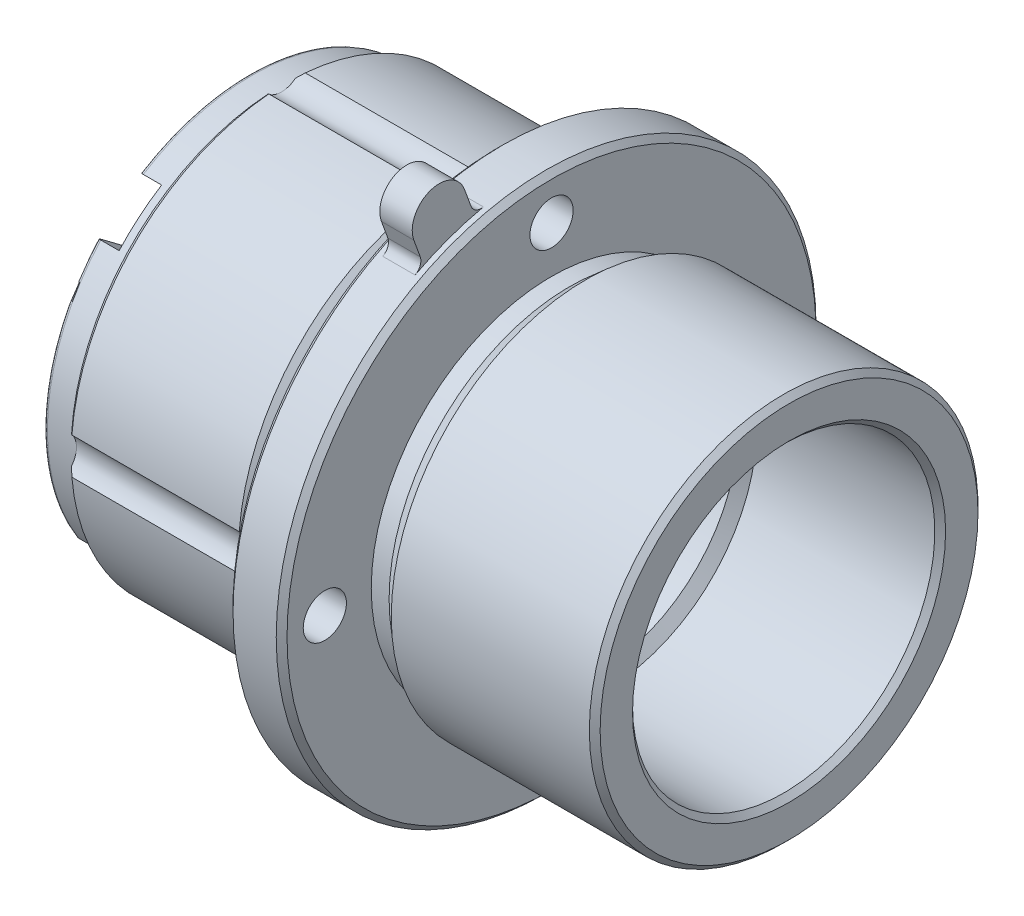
ISO-10303-21;
HEADER;
FILE_DESCRIPTION(('STEP AP214'),'2;1');
FILE_NAME('part.step','',(''),(''),'','','');
FILE_SCHEMA(('AUTOMOTIVE_DESIGN { 1 0 10303 214 1 1 1 1 }'));
ENDSEC;
DATA;
#1=APPLICATION_CONTEXT('core data for automotive mechanical design processes');
#2=APPLICATION_PROTOCOL_DEFINITION('international standard','automotive_design',2000,#1);
#3=PRODUCT_CONTEXT('',#1,'mechanical');
#4=PRODUCT('Part','Part','',(#3));
#5=PRODUCT_RELATED_PRODUCT_CATEGORY('part','',(#4));
#6=PRODUCT_DEFINITION_FORMATION('','',#4);
#7=PRODUCT_DEFINITION_CONTEXT('part definition',#1,'design');
#8=PRODUCT_DEFINITION('design','',#6,#7);
#9=PRODUCT_DEFINITION_SHAPE('','',#8);
#10=(LENGTH_UNIT() NAMED_UNIT(*) SI_UNIT(.MILLI.,.METRE.));
#11=(NAMED_UNIT(*) PLANE_ANGLE_UNIT() SI_UNIT($,.RADIAN.));
#12=(NAMED_UNIT(*) SI_UNIT($,.STERADIAN.) SOLID_ANGLE_UNIT());
#13=UNCERTAINTY_MEASURE_WITH_UNIT(LENGTH_MEASURE(1.E-05),#10,'distance_accuracy_value','');
#14=(GEOMETRIC_REPRESENTATION_CONTEXT(3) GLOBAL_UNCERTAINTY_ASSIGNED_CONTEXT((#13)) GLOBAL_UNIT_ASSIGNED_CONTEXT((#10,
#11,#12)) REPRESENTATION_CONTEXT('',''));
#15=CARTESIAN_POINT('',(0.,0.,0.));
#16=DIRECTION('',(0.,0.,1.));
#17=DIRECTION('',(1.,0.,0.));
#18=AXIS2_PLACEMENT_3D('',#15,#16,#17);
#19=CARTESIAN_POINT('',(0.,0.,0.));
#20=DIRECTION('',(-1.,0.,0.));
#21=DIRECTION('',(0.,0.,1.));
#22=AXIS2_PLACEMENT_3D('',#19,#20,#21);
#23=CYLINDRICAL_SURFACE('',#22,63.5);
#24=CARTESIAN_POINT('',(69.8499999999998,0.,0.));
#25=DIRECTION('',(-1.,0.,0.));
#26=DIRECTION('',(0.,0.,1.));
#27=AXIS2_PLACEMENT_3D('',#24,#25,#26);
#28=CIRCLE('',#27,63.5);
#29=CARTESIAN_POINT('',(69.8499999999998,0.,63.5));
#30=VERTEX_POINT('',#29);
#31=EDGE_CURVE('E799',#30,#30,#28,.T.);
#32=ORIENTED_EDGE('',*,*,#31,.T.);
#33=EDGE_LOOP('',(#32));
#34=FACE_BOUND('',#33,.T.);
#35=CARTESIAN_POINT('',(59.69,0.,0.));
#36=DIRECTION('',(1.,0.,0.));
#37=DIRECTION('',(0.,0.,-1.));
#38=AXIS2_PLACEMENT_3D('',#35,#36,#37);
#39=CIRCLE('',#38,63.5);
#40=CARTESIAN_POINT('',(59.69,0.,-63.5));
#41=VERTEX_POINT('',#40);
#42=EDGE_CURVE('E802',#41,#41,#39,.T.);
#43=ORIENTED_EDGE('',*,*,#42,.T.);
#44=EDGE_LOOP('',(#43));
#45=FACE_BOUND('',#44,.T.);
#46=CARTESIAN_POINT('',(68.5799999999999,0.,0.));
#47=DIRECTION('',(-1.,0.,0.));
#48=DIRECTION('',(0.,0.,-1.));
#49=AXIS2_PLACEMENT_3D('',#46,#47,#48);
#50=CIRCLE('',#49,63.5);
#51=CARTESIAN_POINT('',(68.5799999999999,56.2037417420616,29.5531625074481));
#52=VERTEX_POINT('',#51);
#53=CARTESIAN_POINT('',(68.5799999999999,62.0509707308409,13.4880328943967));
#54=VERTEX_POINT('',#53);
#55=EDGE_CURVE('E360',#52,#54,#50,.T.);
#56=ORIENTED_EDGE('',*,*,#55,.F.);
#57=DIRECTION('',(-1.,0.,0.));
#58=VECTOR('',#57,1.);
#59=CARTESIAN_POINT('',(0.,56.2037417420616,29.5531625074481));
#60=LINE('',#59,#58);
#61=CARTESIAN_POINT('',(60.96,56.2037417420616,29.5531625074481));
#62=VERTEX_POINT('',#61);
#63=EDGE_CURVE('E876',#52,#62,#60,.T.);
#64=ORIENTED_EDGE('',*,*,#63,.T.);
#65=CARTESIAN_POINT('',(60.96,0.,0.));
#66=DIRECTION('',(1.,0.,0.));
#67=DIRECTION('',(0.,0.,-1.));
#68=AXIS2_PLACEMENT_3D('',#65,#66,#67);
#69=CIRCLE('',#68,63.5);
#70=CARTESIAN_POINT('',(60.96,62.0509707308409,13.4880328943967));
#71=VERTEX_POINT('',#70);
#72=EDGE_CURVE('E374',#71,#62,#69,.T.);
#73=ORIENTED_EDGE('',*,*,#72,.F.);
#74=DIRECTION('',(-1.,0.,0.));
#75=VECTOR('',#74,1.);
#76=CARTESIAN_POINT('',(0.,62.0509707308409,13.4880328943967));
#77=LINE('',#76,#75);
#78=EDGE_CURVE('E871',#71,#54,#77,.F.);
#79=ORIENTED_EDGE('',*,*,#78,.T.);
#80=EDGE_LOOP('',(#56,#64,#73,#79));
#81=FACE_BOUND('',#80,.T.);
#82=ADVANCED_FACE('F35',(#34,#45,#81),#23,.T.);
#83=CARTESIAN_POINT('',(0.,35.5600000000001,0.));
#84=DIRECTION('',(1.,0.,0.));
#85=DIRECTION('',(0.,0.,-1.));
#86=AXIS2_PLACEMENT_3D('',#83,#84,#85);
#87=PLANE('',#86);
#88=CARTESIAN_POINT('',(0.,0.,0.));
#89=DIRECTION('',(1.,0.,0.));
#90=DIRECTION('',(0.,0.,-1.));
#91=AXIS2_PLACEMENT_3D('',#88,#89,#90);
#92=CIRCLE('',#91,36.8300000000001);
#93=CARTESIAN_POINT('',(0.,-25.5846713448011,-26.4928951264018));
#94=VERTEX_POINT('',#93);
#95=CARTESIAN_POINT('',(0.,15.6598902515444,-33.3349176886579));
#96=VERTEX_POINT('',#95);
#97=EDGE_CURVE('E1857',#94,#96,#92,.T.);
#98=ORIENTED_EDGE('',*,*,#97,.T.);
#99=DIRECTION('',(0.,-0.800000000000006,0.599999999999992));
#100=VECTOR('',#99,1.);
#101=CARTESIAN_POINT('',(0.,45.7200000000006,-55.8799999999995));
#102=LINE('',#101,#100);
#103=CARTESIAN_POINT('',(0.,25.0338667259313,-40.3654000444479));
#104=VERTEX_POINT('',#103);
#105=EDGE_CURVE('E378',#104,#96,#102,.T.);
#106=ORIENTED_EDGE('',*,*,#105,.F.);
#107=CARTESIAN_POINT('',(0.,0.,0.));
#108=DIRECTION('',(1.,0.,0.));
#109=DIRECTION('',(0.,0.,-1.));
#110=AXIS2_PLACEMENT_3D('',#107,#108,#109);
#111=CIRCLE('',#110,47.498);
#112=CARTESIAN_POINT('',(0.,-32.0240670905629,-35.078756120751));
#113=VERTEX_POINT('',#112);
#114=EDGE_CURVE('E840',#104,#113,#111,.F.);
#115=ORIENTED_EDGE('',*,*,#114,.T.);
#116=DIRECTION('',(0.,-0.599999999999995,-0.800000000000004));
#117=VECTOR('',#116,1.);
#118=CARTESIAN_POINT('',(0.,-45.7199999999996,-53.3400000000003));
#119=LINE('',#118,#117);
#120=EDGE_CURVE('E1804',#94,#113,#119,.T.);
#121=ORIENTED_EDGE('',*,*,#120,.F.);
#122=EDGE_LOOP('',(#98,#106,#115,#121));
#123=FACE_BOUND('',#122,.T.);
#124=ADVANCED_FACE('F906',(#123),#87,.F.);
#125=CARTESIAN_POINT('',(1.27000000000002,0.,0.));
#126=DIRECTION('',(-1.,0.,0.));
#127=DIRECTION('',(0.,0.,1.));
#128=AXIS2_PLACEMENT_3D('',#125,#126,#127);
#129=CONICAL_SURFACE('',#128,35.5600000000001,0.785398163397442);
#130=CARTESIAN_POINT('',(-19.9529267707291,32.9106538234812,-46.2729903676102));
#131=CARTESIAN_POINT('',(-19.1086192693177,32.2015912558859,-45.7411934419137));
#132=CARTESIAN_POINT('',(-18.2652943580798,31.491778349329,-45.208833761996));
#133=CARTESIAN_POINT('',(-16.5809755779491,30.0703780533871,-44.1427835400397));
#134=CARTESIAN_POINT('',(-15.7399817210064,29.3587906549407,-43.6090929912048));
#135=CARTESIAN_POINT('',(-14.0605913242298,27.9334829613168,-42.540112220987));
#136=CARTESIAN_POINT('',(-13.222195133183,27.2197624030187,-42.0048218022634));
#137=CARTESIAN_POINT('',(-11.5485896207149,25.789935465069,-40.9324515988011));
#138=CARTESIAN_POINT('',(-10.7133802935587,25.0738290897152,-40.3953718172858));
#139=CARTESIAN_POINT('',(-9.0468044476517,23.6388629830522,-39.3191472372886));
#140=CARTESIAN_POINT('',(-8.21543763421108,22.9200034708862,-38.7800026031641));
#141=CARTESIAN_POINT('',(-6.55723329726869,21.4789493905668,-37.6992120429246));
#142=CARTESIAN_POINT('',(-5.73039576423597,20.7567548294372,-37.1575661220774));
#143=CARTESIAN_POINT('',(-4.08225347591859,19.3083984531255,-36.0712988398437));
#144=CARTESIAN_POINT('',(-3.2609484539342,18.5822368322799,-35.5266776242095));
#145=CARTESIAN_POINT('',(-1.62508899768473,17.1250669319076,-34.4338001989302));
#146=CARTESIAN_POINT('',(-0.810534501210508,16.3940586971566,-33.885544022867));
#147=CARTESIAN_POINT('',(0.212137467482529,15.4677397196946,-33.1908047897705));
#148=CARTESIAN_POINT('',(0.424185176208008,15.2752034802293,-33.0464026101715));
#149=CARTESIAN_POINT('',(0.847664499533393,14.8896931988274,-32.7572698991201));
#150=CARTESIAN_POINT('',(1.05909610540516,14.6967191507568,-32.6125393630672));
#151=CARTESIAN_POINT('',(1.8416181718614,13.9805492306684,-32.0754119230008));
#152=CARTESIAN_POINT('',(2.41063526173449,13.4558995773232,-31.681924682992));
#153=CARTESIAN_POINT('',(3.25985045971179,12.6659793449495,-31.0894845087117));
#154=CARTESIAN_POINT('',(3.54219840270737,12.4021867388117,-30.8916400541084));
#155=CARTESIAN_POINT('',(4.10532598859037,11.873521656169,-30.4951412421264));
#156=CARTESIAN_POINT('',(4.38610559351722,11.608649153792,-30.2964868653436));
#157=CARTESIAN_POINT('',(5.36812592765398,10.6773738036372,-29.5980303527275));
#158=CARTESIAN_POINT('',(6.06481529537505,10.0078896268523,-29.0959172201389));
#159=CARTESIAN_POINT('',(7.44429525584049,8.65985463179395,-28.0848909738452));
#160=CARTESIAN_POINT('',(8.12708672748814,7.98130439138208,-27.5759782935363));
#161=CARTESIAN_POINT('',(9.13779125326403,6.95464055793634,-26.805980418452));
#162=CARTESIAN_POINT('',(9.47254819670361,6.61083733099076,-26.5481279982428));
#163=CARTESIAN_POINT('',(10.1367503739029,5.91997014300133,-26.0299776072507));
#164=CARTESIAN_POINT('',(10.4661957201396,5.57290625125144,-25.7696796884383));
#165=CARTESIAN_POINT('',(11.1190211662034,4.87499188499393,-25.2462439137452));
#166=CARTESIAN_POINT('',(11.442399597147,4.52414040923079,-24.9831053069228));
#167=CARTESIAN_POINT('',(12.081910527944,3.81819978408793,-24.4536498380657));
#168=CARTESIAN_POINT('',(12.3980424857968,3.46311032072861,-24.1873327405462));
#169=CARTESIAN_POINT('',(12.7099825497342,3.10565611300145,-23.9192420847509));
#170=B_SPLINE_CURVE_WITH_KNOTS('',3,(#130,#131,#132,#133,#134,#135,#136,#137,#138,#139,#140,
#141,#142,#143,#144,#145,#146,#147,#148,#149,#150,#151,#152,#153,#154,#155,#156,#157,#158,#159,
#160,#161,#162,#163,#164,#165,#166,#167,#168,#169),.UNSPECIFIED.,.F.,.F.,(4,2,2,2,2,2,2,2,2,2,2,
2,2,2,2,2,2,2,2,4),(0.,3.67231607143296,7.3446509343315,11.0174591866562,14.690260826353,
18.3627759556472,22.0352833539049,25.7076124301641,29.3799076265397,30.3421841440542,
31.3044742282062,33.9092108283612,35.2115290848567,36.5138787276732,39.7804646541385,
43.046843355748,44.6810548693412,46.3152317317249,47.9498517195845,49.5845935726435),.UNSPECIFIED.);
#171=CARTESIAN_POINT('',(1.27000000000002,14.5036983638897,-32.4677737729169));
#172=VERTEX_POINT('',#171);
#173=EDGE_CURVE('E1806',#96,#172,#170,.T.);
#174=ORIENTED_EDGE('',*,*,#173,.F.);
#175=ORIENTED_EDGE('',*,*,#97,.F.);
#176=CARTESIAN_POINT('',(1.27020000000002,-24.8163955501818,-25.4685274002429));
#177=CARTESIAN_POINT('',(1.0584970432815,-24.9444797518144,-25.639306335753));
#178=CARTESIAN_POINT('',(0.846778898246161,-25.0725549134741,-25.8100732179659));
#179=CARTESIAN_POINT('',(0.423312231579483,-25.3286871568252,-26.1515828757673));
#180=CARTESIAN_POINT('',(0.211563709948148,-25.4567442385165,-26.3223256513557));
#181=CARTESIAN_POINT('',(-0.000199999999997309,-25.584792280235,-26.493056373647));
#182=B_SPLINE_CURVE_WITH_KNOTS('',3,(#176,#177,#178,#179,#180,#181),.UNSPECIFIED.,.F.,.F.,(4,2,
4),(0.,0.901943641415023,1.80388728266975),.UNSPECIFIED.);
#183=CARTESIAN_POINT('',(1.27000000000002,-24.8165165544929,-25.4686887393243));
#184=VERTEX_POINT('',#183);
#185=EDGE_CURVE('E1819',#184,#94,#182,.T.);
#186=ORIENTED_EDGE('',*,*,#185,.F.);
#187=CARTESIAN_POINT('',(1.27000000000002,0.,0.));
#188=DIRECTION('',(1.,0.,0.));
#189=DIRECTION('',(0.,0.,-1.));
#190=AXIS2_PLACEMENT_3D('',#187,#188,#189);
#191=CIRCLE('',#190,35.5600000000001);
#192=EDGE_CURVE('E825',#172,#184,#191,.F.);
#193=ORIENTED_EDGE('',*,*,#192,.F.);
#194=EDGE_LOOP('',(#174,#175,#186,#193));
#195=FACE_BOUND('',#194,.T.);
#196=ADVANCED_FACE('F912',(#195),#129,.F.);
#197=CARTESIAN_POINT('',(0.762,0.,0.));
#198=DIRECTION('',(1.,0.,0.));
#199=DIRECTION('',(0.,0.,-1.));
#200=AXIS2_PLACEMENT_3D('',#197,#198,#199);
#201=TOROIDAL_SURFACE('',#200,47.498,0.762);
#202=CARTESIAN_POINT('',(0.7622,25.687480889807,-40.8556106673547));
#203=CARTESIAN_POINT('',(0.721384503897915,25.6875281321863,-40.8556460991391));
#204=CARTESIAN_POINT('',(0.680595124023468,25.6846922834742,-40.8535192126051));
#205=CARTESIAN_POINT('',(0.600303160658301,25.6735505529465,-40.8451629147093));
#206=CARTESIAN_POINT('',(0.560797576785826,25.6652585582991,-40.8389439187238));
#207=CARTESIAN_POINT('',(0.484095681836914,25.6434998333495,-40.8226248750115));
#208=CARTESIAN_POINT('',(0.44689899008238,25.630033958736,-40.8125254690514));
#209=CARTESIAN_POINT('',(0.375749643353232,25.5984278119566,-40.7888208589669));
#210=CARTESIAN_POINT('',(0.341797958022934,25.5802861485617,-40.7752146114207));
#211=CARTESIAN_POINT('',(0.277056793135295,25.5393807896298,-40.7445355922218));
#212=CARTESIAN_POINT('',(0.246378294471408,25.51650490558,-40.7273786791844));
#213=CARTESIAN_POINT('',(0.189909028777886,25.4671743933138,-40.6903807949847));
#214=CARTESIAN_POINT('',(0.164119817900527,25.4407186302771,-40.6705389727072));
#215=CARTESIAN_POINT('',(0.116439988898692,25.3832168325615,-40.6274126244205));
#216=CARTESIAN_POINT('',(0.0948961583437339,25.351986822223,-40.6039901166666));
#217=CARTESIAN_POINT('',(0.0582215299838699,25.2872069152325,-40.5554051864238));
#218=CARTESIAN_POINT('',(0.0430923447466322,25.2536564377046,-40.5302423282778));
#219=CARTESIAN_POINT('',(0.0187209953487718,25.1829244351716,-40.4771933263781));
#220=CARTESIAN_POINT('',(0.00991097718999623,25.1456474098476,-40.4492355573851));
#221=CARTESIAN_POINT('',(-8.58963224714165E-05,25.0704411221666,-40.3928308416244));
#222=CARTESIAN_POINT('',(-0.00127059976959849,25.0325116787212,-40.3643837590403));
#223=CARTESIAN_POINT('',(0.00409752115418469,24.9555222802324,-40.3066417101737));
#224=CARTESIAN_POINT('',(0.0109521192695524,24.9164755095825,-40.2773566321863));
#225=CARTESIAN_POINT('',(0.0327874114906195,24.8398564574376,-40.2198923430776));
#226=CARTESIAN_POINT('',(0.0477686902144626,24.8022842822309,-40.1917132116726));
#227=CARTESIAN_POINT('',(0.085510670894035,24.7299156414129,-40.1374367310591));
#228=CARTESIAN_POINT('',(0.108236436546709,24.6951075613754,-40.111330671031));
#229=CARTESIAN_POINT('',(0.161031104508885,24.6292511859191,-40.0619383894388));
#230=CARTESIAN_POINT('',(0.191097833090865,24.598201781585,-40.0386513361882));
#231=CARTESIAN_POINT('',(0.256194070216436,24.5424652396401,-39.9968489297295));
#232=CARTESIAN_POINT('',(0.290902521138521,24.5175385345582,-39.9781539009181));
#233=CARTESIAN_POINT('',(0.365420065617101,24.4731323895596,-39.9448492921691));
#234=CARTESIAN_POINT('',(0.405228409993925,24.4536521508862,-39.9302391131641));
#235=CARTESIAN_POINT('',(0.485704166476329,24.4221963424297,-39.9066472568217));
#236=CARTESIAN_POINT('',(0.526104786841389,24.4097824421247,-39.897336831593));
#237=CARTESIAN_POINT('',(0.608992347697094,24.3909606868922,-39.8832205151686));
#238=CARTESIAN_POINT('',(0.651474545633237,24.3845397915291,-39.8784048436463));
#239=CARTESIAN_POINT('',(0.705560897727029,24.380380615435,-39.8752854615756));
#240=CARTESIAN_POINT('',(0.716882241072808,24.3797300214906,-39.8747975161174));
#241=CARTESIAN_POINT('',(0.739534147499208,24.3788652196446,-39.8741489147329));
#242=CARTESIAN_POINT('',(0.750864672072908,24.3786503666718,-39.8739877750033));
#243=CARTESIAN_POINT('',(0.762200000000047,24.3786522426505,-39.8739891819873));
#244=B_SPLINE_CURVE_WITH_KNOTS('',3,(#202,#203,#204,#205,#206,#207,#208,#209,#210,#211,#212,
#213,#214,#215,#216,#217,#218,#219,#220,#221,#222,#223,#224,#225,#226,#227,#228,#229,#230,#231,
#232,#233,#234,#235,#236,#237,#238,#239,#240,#241,#242,#243),.UNSPECIFIED.,.F.,.F.,(4,2,2,2,2,2,
2,2,2,2,2,2,2,2,2,2,2,2,2,2,4),(0.,0.122249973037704,0.244189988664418,0.366109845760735,
0.488066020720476,0.613335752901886,0.73864528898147,0.871828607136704,1.00504538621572,
1.14667560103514,1.28834578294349,1.43550868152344,1.58268216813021,1.72920033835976,
1.87567517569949,2.01486763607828,2.15403967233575,2.28322150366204,2.41212158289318,
2.44616499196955,2.48015796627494),.UNSPECIFIED.);
#245=CARTESIAN_POINT('',(0.762,25.6874809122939,-40.8556106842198));
#246=VERTEX_POINT('',#245);
#247=EDGE_CURVE('E424',#246,#104,#244,.T.);
#248=ORIENTED_EDGE('',*,*,#247,.F.);
#249=CARTESIAN_POINT('',(0.762,0.,0.));
#250=DIRECTION('',(1.,0.,0.));
#251=DIRECTION('',(0.,0.,-1.));
#252=AXIS2_PLACEMENT_3D('',#249,#250,#251);
#253=CIRCLE('',#252,48.26);
#254=CARTESIAN_POINT('',(0.762,-32.4833660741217,-35.6911547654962));
#255=VERTEX_POINT('',#254);
#256=EDGE_CURVE('E848',#255,#246,#253,.T.);
#257=ORIENTED_EDGE('',*,*,#256,.F.);
#258=CARTESIAN_POINT('',(0.7622,-31.5646991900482,-34.4662655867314));
#259=CARTESIAN_POINT('',(0.719480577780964,-31.5646700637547,-34.4662267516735));
#260=CARTESIAN_POINT('',(0.676772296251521,-31.5668501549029,-34.4691335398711));
#261=CARTESIAN_POINT('',(0.592600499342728,-31.575463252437,-34.4806176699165));
#262=CARTESIAN_POINT('',(0.551135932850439,-31.5818925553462,-34.4891900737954));
#263=CARTESIAN_POINT('',(0.470578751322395,-31.5988426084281,-34.5117901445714));
#264=CARTESIAN_POINT('',(0.431487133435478,-31.609365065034,-34.5258200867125));
#265=CARTESIAN_POINT('',(0.356800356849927,-31.6341869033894,-34.5589158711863));
#266=CARTESIAN_POINT('',(0.321204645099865,-31.6484856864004,-34.5779809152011));
#267=CARTESIAN_POINT('',(0.254425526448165,-31.6804862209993,-34.6206482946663));
#268=CARTESIAN_POINT('',(0.223251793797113,-31.6981952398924,-34.6442603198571));
#269=CARTESIAN_POINT('',(0.166269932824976,-31.7364920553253,-34.6953227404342));
#270=CARTESIAN_POINT('',(0.140462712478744,-31.7570803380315,-34.7227737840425));
#271=CARTESIAN_POINT('',(0.094828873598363,-31.8006479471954,-34.7808639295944));
#272=CARTESIAN_POINT('',(0.0750295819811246,-31.8236375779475,-34.8115167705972));
#273=CARTESIAN_POINT('',(0.0421153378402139,-31.8712775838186,-34.8750367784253));
#274=CARTESIAN_POINT('',(0.0290001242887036,-31.8959278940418,-34.907903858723));
#275=CARTESIAN_POINT('',(0.00977186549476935,-31.946301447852,-34.9750685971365));
#276=CARTESIAN_POINT('',(0.00368828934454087,-31.9720287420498,-35.0093716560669));
#277=CARTESIAN_POINT('',(-0.00120966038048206,-32.0237320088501,-35.078309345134));
#278=CARTESIAN_POINT('',(-2.37559178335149E-05,-32.0497079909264,-35.1129439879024));
#279=CARTESIAN_POINT('',(0.00959531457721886,-32.1012242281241,-35.1816323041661));
#280=CARTESIAN_POINT('',(0.0180426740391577,-32.1267635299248,-35.2156847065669));
#281=CARTESIAN_POINT('',(0.0419707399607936,-32.1766272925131,-35.2821697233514));
#282=CARTESIAN_POINT('',(0.0574514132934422,-32.2009517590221,-35.3146023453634));
#283=CARTESIAN_POINT('',(0.0949971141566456,-32.247666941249,-35.3768892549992));
#284=CARTESIAN_POINT('',(0.117055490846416,-32.2700595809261,-35.4067461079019));
#285=CARTESIAN_POINT('',(0.167144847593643,-32.3122936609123,-35.4630582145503));
#286=CARTESIAN_POINT('',(0.195175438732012,-32.3321352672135,-35.4895136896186));
#287=CARTESIAN_POINT('',(0.256306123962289,-32.368626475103,-35.5381686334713));
#288=CARTESIAN_POINT('',(0.289387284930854,-32.385287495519,-35.5603833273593));
#289=CARTESIAN_POINT('',(0.359772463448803,-32.4150282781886,-35.600037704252));
#290=CARTESIAN_POINT('',(0.39707771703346,-32.4281069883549,-35.6174759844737));
#291=CARTESIAN_POINT('',(0.474678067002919,-32.4502502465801,-35.647000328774));
#292=CARTESIAN_POINT('',(0.514961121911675,-32.4593300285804,-35.6591067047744));
#293=CARTESIAN_POINT('',(0.597469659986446,-32.4732729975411,-35.6776973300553));
#294=CARTESIAN_POINT('',(0.63969201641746,-32.4781427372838,-35.684190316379));
#295=CARTESIAN_POINT('',(0.695530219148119,-32.4816867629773,-35.6889156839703));
#296=CARTESIAN_POINT('',(0.708854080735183,-32.4823186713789,-35.6897582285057));
#297=CARTESIAN_POINT('',(0.735516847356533,-32.4831587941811,-35.690878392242));
#298=CARTESIAN_POINT('',(0.748855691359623,-32.483367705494,-35.6911569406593));
#299=CARTESIAN_POINT('',(0.762199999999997,-32.4833660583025,-35.6911547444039));
#300=B_SPLINE_CURVE_WITH_KNOTS('',3,(#258,#259,#260,#261,#262,#263,#264,#265,#266,#267,#268,
#269,#270,#271,#272,#273,#274,#275,#276,#277,#278,#279,#280,#281,#282,#283,#284,#285,#286,#287,
#288,#289,#290,#291,#292,#293,#294,#295,#296,#297,#298,#299),.UNSPECIFIED.,.F.,.F.,(4,2,2,2,2,2,
2,2,2,2,2,2,2,2,2,2,2,2,2,2,4),(0.,0.127985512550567,0.25585962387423,0.383787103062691,
0.51169431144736,0.639877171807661,0.768081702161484,0.896860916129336,1.02563510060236,
1.15494703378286,1.28426391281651,1.41383413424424,1.54340374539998,1.67284278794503,
1.80227340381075,1.93123022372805,2.06022487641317,2.18872378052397,2.3170223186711,
2.35710559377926,2.39712277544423),.UNSPECIFIED.);
#301=EDGE_CURVE('E478',#113,#255,#300,.T.);
#302=ORIENTED_EDGE('',*,*,#301,.F.);
#303=ORIENTED_EDGE('',*,*,#114,.F.);
#304=EDGE_LOOP('',(#248,#257,#302,#303));
#305=FACE_BOUND('',#304,.T.);
#306=ADVANCED_FACE('F438',(#305),#201,.T.);
#307=CARTESIAN_POINT('',(0.,-26.4928951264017,25.5846713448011));
#308=VERTEX_POINT('',#307);
#309=CARTESIAN_POINT('',(0.,-33.3349176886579,-15.6598902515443));
#310=VERTEX_POINT('',#309);
#311=EDGE_CURVE('E830',#308,#310,#92,.T.);
#312=ORIENTED_EDGE('',*,*,#311,.T.);
#313=DIRECTION('',(0.,0.599999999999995,0.800000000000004));
#314=VECTOR('',#313,1.);
#315=CARTESIAN_POINT('',(0.,-55.8799999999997,-45.7200000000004));
#316=LINE('',#315,#314);
#317=CARTESIAN_POINT('',(0.,-40.365400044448,-25.0338667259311));
#318=VERTEX_POINT('',#317);
#319=EDGE_CURVE('E1802',#318,#310,#316,.T.);
#320=ORIENTED_EDGE('',*,*,#319,.F.);
#321=CARTESIAN_POINT('',(0.,-35.0787561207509,32.024067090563));
#322=VERTEX_POINT('',#321);
#323=EDGE_CURVE('E1834',#318,#322,#111,.F.);
#324=ORIENTED_EDGE('',*,*,#323,.T.);
#325=DIRECTION('',(0.,-0.800000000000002,0.599999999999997));
#326=VECTOR('',#325,1.);
#327=CARTESIAN_POINT('',(0.,-53.3400000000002,45.7199999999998));
#328=LINE('',#327,#326);
#329=EDGE_CURVE('E514',#308,#322,#328,.T.);
#330=ORIENTED_EDGE('',*,*,#329,.F.);
#331=EDGE_LOOP('',(#312,#320,#324,#330));
#332=FACE_BOUND('',#331,.T.);
#333=ADVANCED_FACE('F914',(#332),#87,.F.);
#334=CARTESIAN_POINT('',(-19.9529268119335,-46.2729903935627,-32.9106538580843));
#335=CARTESIAN_POINT('',(-19.108619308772,-45.7411934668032,-32.2015912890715));
#336=CARTESIAN_POINT('',(-18.2652943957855,-45.2088337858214,-31.4917783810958));
#337=CARTESIAN_POINT('',(-16.5809756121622,-44.1427835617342,-30.0703780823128));
#338=CARTESIAN_POINT('',(-15.7399817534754,-43.6090930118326,-29.358790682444));
#339=CARTESIAN_POINT('',(-14.060591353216,-42.5401122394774,-27.9334829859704));
#340=CARTESIAN_POINT('',(-13.2221951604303,-42.0048218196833,-27.2197624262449));
#341=CARTESIAN_POINT('',(-11.548589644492,-40.9324516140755,-25.7899354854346));
#342=CARTESIAN_POINT('',(-10.7133803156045,-40.3953718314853,-25.0738291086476));
#343=CARTESIAN_POINT('',(-9.04680446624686,-39.3191472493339,-23.6388629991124));
#344=CARTESIAN_POINT('',(-8.21543765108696,-38.7800026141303,-22.9200034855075));
#345=CARTESIAN_POINT('',(-6.5572333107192,-37.6992120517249,-21.4789494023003));
#346=CARTESIAN_POINT('',(-5.73039577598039,-37.157566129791,-20.7567548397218));
#347=CARTESIAN_POINT('',(-4.08225348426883,-36.0712988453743,-19.3083984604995));
#348=CARTESIAN_POINT('',(-3.26094846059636,-35.5266776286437,-18.582236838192));
#349=CARTESIAN_POINT('',(-1.62508900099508,-34.4338002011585,-17.1250669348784));
#350=CARTESIAN_POINT('',(-0.810534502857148,-33.8855440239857,-16.394058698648));
#351=CARTESIAN_POINT('',(0.2121374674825,-33.1908047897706,-15.4677397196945));
#352=CARTESIAN_POINT('',(0.424185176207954,-33.0464026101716,-15.2752034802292));
#353=CARTESIAN_POINT('',(0.847664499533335,-32.7572698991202,-14.8896931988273));
#354=CARTESIAN_POINT('',(1.05909610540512,-32.6125393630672,-14.6967191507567));
#355=CARTESIAN_POINT('',(1.84161817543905,-32.0754119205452,-13.980549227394));
#356=CARTESIAN_POINT('',(2.41063526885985,-31.6819246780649,-13.4558995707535));
#357=CARTESIAN_POINT('',(3.25985047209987,-31.0894845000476,-12.6659793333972));
#358=CARTESIAN_POINT('',(3.54219841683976,-30.8916400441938,-12.402186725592));
#359=CARTESIAN_POINT('',(4.10532600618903,-30.4951412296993,-11.8735216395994));
#360=CARTESIAN_POINT('',(4.38610561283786,-30.2964868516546,-11.6086491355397));
#361=CARTESIAN_POINT('',(5.36812594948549,-29.5980303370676,-10.6773737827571));
#362=CARTESIAN_POINT('',(6.06481531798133,-29.0959172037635,-10.0078896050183));
#363=CARTESIAN_POINT('',(7.44429527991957,-28.0848909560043,-8.65985460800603));
#364=CARTESIAN_POINT('',(8.12708675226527,-27.5759782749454,-7.98130436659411));
#365=CARTESIAN_POINT('',(9.13779127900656,-26.805980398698,-6.9546405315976));
#366=CARTESIAN_POINT('',(9.47254822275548,-26.5481279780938,-6.61083730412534));
#367=CARTESIAN_POINT('',(10.1367504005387,-26.0299775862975,-5.91997011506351));
#368=CARTESIAN_POINT('',(10.4661957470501,-25.7696796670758,-5.5729062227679));
#369=CARTESIAN_POINT('',(11.1190211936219,-25.2462438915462,-4.8749918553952));
#370=CARTESIAN_POINT('',(11.4423996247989,-24.9831052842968,-4.52414037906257));
#371=CARTESIAN_POINT('',(12.0819105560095,-24.4536498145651,-3.81819975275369));
#372=CARTESIAN_POINT('',(12.3980425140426,-24.1873327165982,-3.46311028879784));
#373=CARTESIAN_POINT('',(12.7099825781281,-23.9192420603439,-3.10565608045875));
#374=B_SPLINE_CURVE_WITH_KNOTS('',3,(#334,#335,#336,#337,#338,#339,#340,#341,#342,#343,#344,
#345,#346,#347,#348,#349,#350,#351,#352,#353,#354,#355,#356,#357,#358,#359,#360,#361,#362,#363,
#364,#365,#366,#367,#368,#369,#370,#371,#372,#373),.UNSPECIFIED.,.F.,.F.,(4,2,2,2,2,2,2,2,2,2,2,
2,2,2,2,2,2,2,2,4),(0.,3.67231607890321,7.34465094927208,11.0174592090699,14.6902608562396,
18.3627759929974,22.0352833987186,25.7076124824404,29.3799076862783,30.3421842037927,
31.3044742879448,33.9092109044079,35.2115291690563,36.5138788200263,39.780464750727,
43.0468434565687,44.6810549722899,46.3152318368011,47.9498518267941,49.5845936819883),.UNSPECIFIED.);
#375=CARTESIAN_POINT('',(1.27000000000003,-32.4677737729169,-14.5036983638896));
#376=VERTEX_POINT('',#375);
#377=EDGE_CURVE('E499',#310,#376,#374,.T.);
#378=ORIENTED_EDGE('',*,*,#377,.F.);
#379=ORIENTED_EDGE('',*,*,#311,.F.);
#380=CARTESIAN_POINT('',(1.27020000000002,-25.4685274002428,24.8163955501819));
#381=CARTESIAN_POINT('',(1.0584970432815,-25.6393063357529,24.9444797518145));
#382=CARTESIAN_POINT('',(0.846778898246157,-25.8100732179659,25.0725549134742));
#383=CARTESIAN_POINT('',(0.423312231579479,-26.1515828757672,25.3286871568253));
#384=CARTESIAN_POINT('',(0.211563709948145,-26.3223256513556,25.4567442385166));
#385=CARTESIAN_POINT('',(-0.000199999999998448,-26.4930563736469,25.584792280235));
#386=B_SPLINE_CURVE_WITH_KNOTS('',3,(#380,#381,#382,#383,#384,#385),.UNSPECIFIED.,.F.,.F.,(4,2,
4),(0.,0.901943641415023,1.80388728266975),.UNSPECIFIED.);
#387=CARTESIAN_POINT('',(1.27000000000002,-25.4686887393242,24.816516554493));
#388=VERTEX_POINT('',#387);
#389=EDGE_CURVE('E526',#388,#308,#386,.T.);
#390=ORIENTED_EDGE('',*,*,#389,.F.);
#391=EDGE_CURVE('E1866',#376,#388,#191,.F.);
#392=ORIENTED_EDGE('',*,*,#391,.F.);
#393=EDGE_LOOP('',(#378,#379,#390,#392));
#394=FACE_BOUND('',#393,.T.);
#395=ADVANCED_FACE('F1237',(#394),#129,.F.);
#396=CARTESIAN_POINT('',(0.7622,-40.8556106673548,-25.6874808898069));
#397=CARTESIAN_POINT('',(0.72138450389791,-40.8556460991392,-25.6875281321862));
#398=CARTESIAN_POINT('',(0.680595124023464,-40.8535192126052,-25.6846922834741));
#399=CARTESIAN_POINT('',(0.6003031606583,-40.8451629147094,-25.6735505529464));
#400=CARTESIAN_POINT('',(0.560797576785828,-40.8389439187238,-25.665258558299));
#401=CARTESIAN_POINT('',(0.484095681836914,-40.8226248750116,-25.6434998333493));
#402=CARTESIAN_POINT('',(0.446898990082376,-40.8125254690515,-25.6300339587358));
#403=CARTESIAN_POINT('',(0.375749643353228,-40.788820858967,-25.5984278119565));
#404=CARTESIAN_POINT('',(0.341797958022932,-40.7752146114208,-25.5802861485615));
#405=CARTESIAN_POINT('',(0.277056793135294,-40.7445355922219,-25.5393807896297));
#406=CARTESIAN_POINT('',(0.246378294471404,-40.7273786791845,-25.5165049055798));
#407=CARTESIAN_POINT('',(0.189909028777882,-40.6903807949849,-25.4671743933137));
#408=CARTESIAN_POINT('',(0.164119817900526,-40.6705389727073,-25.4407186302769));
#409=CARTESIAN_POINT('',(0.116439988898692,-40.6274126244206,-25.3832168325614));
#410=CARTESIAN_POINT('',(0.0948961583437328,-40.6039901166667,-25.3519868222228));
#411=CARTESIAN_POINT('',(0.0582215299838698,-40.5554051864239,-25.2872069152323));
#412=CARTESIAN_POINT('',(0.0430923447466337,-40.5302423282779,-25.2536564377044));
#413=CARTESIAN_POINT('',(0.018720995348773,-40.4771933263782,-25.1829244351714));
#414=CARTESIAN_POINT('',(0.00991097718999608,-40.4492355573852,-25.1456474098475));
#415=CARTESIAN_POINT('',(-8.58963224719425E-05,-40.3928308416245,-25.0704411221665));
#416=CARTESIAN_POINT('',(-0.00127059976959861,-40.3643837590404,-25.0325116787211));
#417=CARTESIAN_POINT('',(0.004097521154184,-40.3066417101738,-24.9555222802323));
#418=CARTESIAN_POINT('',(0.010952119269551,-40.2773566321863,-24.9164755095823));
#419=CARTESIAN_POINT('',(0.0327874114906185,-40.2198923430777,-24.8398564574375));
#420=CARTESIAN_POINT('',(0.0477686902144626,-40.1917132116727,-24.8022842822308));
#421=CARTESIAN_POINT('',(0.0855106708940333,-40.1374367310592,-24.7299156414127));
#422=CARTESIAN_POINT('',(0.108236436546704,-40.1113306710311,-24.6951075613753));
#423=CARTESIAN_POINT('',(0.161031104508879,-40.0619383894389,-24.629251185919));
#424=CARTESIAN_POINT('',(0.19109783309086,-40.0386513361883,-24.5982017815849));
#425=CARTESIAN_POINT('',(0.256194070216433,-39.9968489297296,-24.5424652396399));
#426=CARTESIAN_POINT('',(0.290902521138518,-39.9781539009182,-24.5175385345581));
#427=CARTESIAN_POINT('',(0.365420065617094,-39.9448492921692,-24.4731323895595));
#428=CARTESIAN_POINT('',(0.405228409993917,-39.9302391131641,-24.453652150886));
#429=CARTESIAN_POINT('',(0.485704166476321,-39.9066472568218,-24.4221963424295));
#430=CARTESIAN_POINT('',(0.526104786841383,-39.8973368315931,-24.4097824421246));
#431=CARTESIAN_POINT('',(0.608992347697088,-39.8832205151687,-24.3909606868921));
#432=CARTESIAN_POINT('',(0.651474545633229,-39.8784048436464,-24.384539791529));
#433=CARTESIAN_POINT('',(0.705560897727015,-39.8752854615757,-24.3803806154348));
#434=CARTESIAN_POINT('',(0.716882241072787,-39.8747975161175,-24.3797300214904));
#435=CARTESIAN_POINT('',(0.739534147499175,-39.874148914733,-24.3788652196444));
#436=CARTESIAN_POINT('',(0.750864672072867,-39.8739877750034,-24.3786503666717));
#437=CARTESIAN_POINT('',(0.7622,-39.8739891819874,-24.3786522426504));
#438=B_SPLINE_CURVE_WITH_KNOTS('',3,(#396,#397,#398,#399,#400,#401,#402,#403,#404,#405,#406,
#407,#408,#409,#410,#411,#412,#413,#414,#415,#416,#417,#418,#419,#420,#421,#422,#423,#424,#425,
#426,#427,#428,#429,#430,#431,#432,#433,#434,#435,#436,#437),.UNSPECIFIED.,.F.,.F.,(4,2,2,2,2,2,
2,2,2,2,2,2,2,2,2,2,2,2,2,2,4),(0.,0.122249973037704,0.24418998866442,0.366109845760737,
0.488066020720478,0.613335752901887,0.738645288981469,0.871828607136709,1.00504538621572,
1.14667560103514,1.28834578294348,1.43550868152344,1.58268216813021,1.72920033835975,
1.87567517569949,2.01486763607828,2.15403967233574,2.28322150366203,2.41212158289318,
2.44616499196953,2.4801579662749),.UNSPECIFIED.);
#439=CARTESIAN_POINT('',(0.762,-40.8556106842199,-25.6874809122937));
#440=VERTEX_POINT('',#439);
#441=EDGE_CURVE('E483',#440,#318,#438,.T.);
#442=ORIENTED_EDGE('',*,*,#441,.F.);
#443=CARTESIAN_POINT('',(0.762,-35.691154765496,32.4833660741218));
#444=VERTEX_POINT('',#443);
#445=EDGE_CURVE('E843',#444,#440,#253,.T.);
#446=ORIENTED_EDGE('',*,*,#445,.F.);
#447=CARTESIAN_POINT('',(0.7622,-34.4662655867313,31.5646991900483));
#448=CARTESIAN_POINT('',(0.719480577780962,-34.4662267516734,31.5646700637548));
#449=CARTESIAN_POINT('',(0.676772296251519,-34.469133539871,31.566850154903));
#450=CARTESIAN_POINT('',(0.592600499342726,-34.4806176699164,31.5754632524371));
#451=CARTESIAN_POINT('',(0.551135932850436,-34.4891900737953,31.5818925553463));
#452=CARTESIAN_POINT('',(0.470578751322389,-34.5117901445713,31.5988426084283));
#453=CARTESIAN_POINT('',(0.431487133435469,-34.5258200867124,31.6093650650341));
#454=CARTESIAN_POINT('',(0.35680035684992,-34.5589158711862,31.6341869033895));
#455=CARTESIAN_POINT('',(0.321204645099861,-34.577980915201,31.6484856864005));
#456=CARTESIAN_POINT('',(0.254425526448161,-34.6206482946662,31.6804862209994));
#457=CARTESIAN_POINT('',(0.223251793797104,-34.644260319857,31.6981952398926));
#458=CARTESIAN_POINT('',(0.166269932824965,-34.6953227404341,31.7364920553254));
#459=CARTESIAN_POINT('',(0.140462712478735,-34.7227737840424,31.7570803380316));
#460=CARTESIAN_POINT('',(0.0948288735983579,-34.7808639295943,31.8006479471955));
#461=CARTESIAN_POINT('',(0.0750295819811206,-34.8115167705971,31.8236375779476));
#462=CARTESIAN_POINT('',(0.0421153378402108,-34.8750367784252,31.8712775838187));
#463=CARTESIAN_POINT('',(0.0290001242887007,-34.9079038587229,31.8959278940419));
#464=CARTESIAN_POINT('',(0.0097718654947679,-34.9750685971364,31.9463014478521));
#465=CARTESIAN_POINT('',(0.00368828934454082,-35.0093716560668,31.9720287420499));
#466=CARTESIAN_POINT('',(-0.00120966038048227,-35.0783093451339,32.0237320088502));
#467=CARTESIAN_POINT('',(-2.37559178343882E-05,-35.1129439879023,32.0497079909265));
#468=CARTESIAN_POINT('',(0.00959531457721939,-35.181632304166,32.1012242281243));
#469=CARTESIAN_POINT('',(0.01804267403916,-35.2156847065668,32.1267635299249));
#470=CARTESIAN_POINT('',(0.0419707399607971,-35.2821697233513,32.1766272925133));
#471=CARTESIAN_POINT('',(0.0574514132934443,-35.3146023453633,32.2009517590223));
#472=CARTESIAN_POINT('',(0.0949971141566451,-35.3768892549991,32.2476669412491));
#473=CARTESIAN_POINT('',(0.117055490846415,-35.4067461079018,32.2700595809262));
#474=CARTESIAN_POINT('',(0.167144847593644,-35.4630582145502,32.3122936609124));
#475=CARTESIAN_POINT('',(0.195175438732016,-35.4895136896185,32.3321352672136));
#476=CARTESIAN_POINT('',(0.256306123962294,-35.5381686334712,32.3686264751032));
#477=CARTESIAN_POINT('',(0.289387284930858,-35.5603833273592,32.3852874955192));
#478=CARTESIAN_POINT('',(0.359772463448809,-35.6000377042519,32.4150282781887));
#479=CARTESIAN_POINT('',(0.397077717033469,-35.6174759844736,32.428106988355));
#480=CARTESIAN_POINT('',(0.47467806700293,-35.6470003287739,32.4502502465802));
#481=CARTESIAN_POINT('',(0.514961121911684,-35.6591067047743,32.4593300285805));
#482=CARTESIAN_POINT('',(0.597469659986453,-35.6776973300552,32.4732729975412));
#483=CARTESIAN_POINT('',(0.639692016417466,-35.6841903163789,32.478142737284));
#484=CARTESIAN_POINT('',(0.69553021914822,-35.6889156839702,32.4816867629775));
#485=CARTESIAN_POINT('',(0.708854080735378,-35.6897582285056,32.482318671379));
#486=CARTESIAN_POINT('',(0.735516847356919,-35.6908783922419,32.4831587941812));
#487=CARTESIAN_POINT('',(0.748855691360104,-35.6911569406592,32.4833677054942));
#488=CARTESIAN_POINT('',(0.762200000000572,-35.6911547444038,32.4833660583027));
#489=B_SPLINE_CURVE_WITH_KNOTS('',3,(#447,#448,#449,#450,#451,#452,#453,#454,#455,#456,#457,
#458,#459,#460,#461,#462,#463,#464,#465,#466,#467,#468,#469,#470,#471,#472,#473,#474,#475,#476,
#477,#478,#479,#480,#481,#482,#483,#484,#485,#486,#487,#488),.UNSPECIFIED.,.F.,.F.,(4,2,2,2,2,2,
2,2,2,2,2,2,2,2,2,2,2,2,2,2,4),(0.,0.127985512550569,0.255859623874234,0.383787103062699,
0.511694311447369,0.639877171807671,0.768081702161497,0.896860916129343,1.02563510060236,
1.15494703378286,1.28426391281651,1.41383413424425,1.54340374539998,1.67284278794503,
1.80227340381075,1.93123022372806,2.06022487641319,2.18872378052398,2.3170223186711,
2.35710559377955,2.39712277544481),.UNSPECIFIED.);
#490=EDGE_CURVE('E463',#322,#444,#489,.T.);
#491=ORIENTED_EDGE('',*,*,#490,.F.);
#492=ORIENTED_EDGE('',*,*,#323,.F.);
#493=EDGE_LOOP('',(#442,#446,#491,#492));
#494=FACE_BOUND('',#493,.T.);
#495=ADVANCED_FACE('F1245',(#494),#201,.T.);
#496=CARTESIAN_POINT('',(0.,25.5846713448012,26.4928951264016));
#497=VERTEX_POINT('',#496);
#498=CARTESIAN_POINT('',(0.,-15.6598902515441,33.334917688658));
#499=VERTEX_POINT('',#498);
#500=EDGE_CURVE('E826',#497,#499,#92,.T.);
#501=ORIENTED_EDGE('',*,*,#500,.T.);
#502=DIRECTION('',(0.,0.800000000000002,-0.599999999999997));
#503=VECTOR('',#502,1.);
#504=CARTESIAN_POINT('',(0.,-45.7200000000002,55.8799999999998));
#505=LINE('',#504,#503);
#506=CARTESIAN_POINT('',(0.,-25.033866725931,40.365400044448));
#507=VERTEX_POINT('',#506);
#508=EDGE_CURVE('E512',#507,#499,#505,.T.);
#509=ORIENTED_EDGE('',*,*,#508,.F.);
#510=CARTESIAN_POINT('',(0.,32.0240670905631,35.0787561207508));
#511=VERTEX_POINT('',#510);
#512=EDGE_CURVE('E836',#507,#511,#111,.F.);
#513=ORIENTED_EDGE('',*,*,#512,.T.);
#514=DIRECTION('',(0.,0.6,0.8));
#515=VECTOR('',#514,1.);
#516=CARTESIAN_POINT('',(0.,45.72,53.34));
#517=LINE('',#516,#515);
#518=EDGE_CURVE('E560',#497,#511,#517,.T.);
#519=ORIENTED_EDGE('',*,*,#518,.F.);
#520=EDGE_LOOP('',(#501,#509,#513,#519));
#521=FACE_BOUND('',#520,.T.);
#522=ADVANCED_FACE('F1254',(#521),#87,.F.);
#523=CARTESIAN_POINT('',(-19.9529268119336,-32.9106538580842,46.2729903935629));
#524=CARTESIAN_POINT('',(-19.108619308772,-32.2015912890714,45.7411934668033));
#525=CARTESIAN_POINT('',(-18.2652943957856,-31.4917783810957,45.2088337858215));
#526=CARTESIAN_POINT('',(-16.5809756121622,-30.0703780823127,44.1427835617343));
#527=CARTESIAN_POINT('',(-15.7399817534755,-29.3587906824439,43.6090930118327));
#528=CARTESIAN_POINT('',(-14.060591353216,-27.9334829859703,42.5401122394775));
#529=CARTESIAN_POINT('',(-13.2221951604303,-27.2197624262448,42.0048218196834));
#530=CARTESIAN_POINT('',(-11.5485896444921,-25.7899354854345,40.9324516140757));
#531=CARTESIAN_POINT('',(-10.7133803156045,-25.0738291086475,40.3953718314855));
#532=CARTESIAN_POINT('',(-9.04680446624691,-23.6388629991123,39.319147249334));
#533=CARTESIAN_POINT('',(-8.21543765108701,-22.9200034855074,38.7800026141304));
#534=CARTESIAN_POINT('',(-6.55723331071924,-21.4789494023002,37.699212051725));
#535=CARTESIAN_POINT('',(-5.73039577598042,-20.7567548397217,37.1575661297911));
#536=CARTESIAN_POINT('',(-4.08225348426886,-19.3083984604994,36.0712988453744));
#537=CARTESIAN_POINT('',(-3.26094846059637,-18.5822368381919,35.5266776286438));
#538=CARTESIAN_POINT('',(-1.62508900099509,-17.1250669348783,34.4338002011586));
#539=CARTESIAN_POINT('',(-0.81053450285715,-16.3940586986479,33.8855440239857));
#540=CARTESIAN_POINT('',(0.212137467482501,-15.4677397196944,33.1908047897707));
#541=CARTESIAN_POINT('',(0.424185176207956,-15.2752034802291,33.0464026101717));
#542=CARTESIAN_POINT('',(0.847664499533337,-14.8896931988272,32.7572698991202));
#543=CARTESIAN_POINT('',(1.05909610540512,-14.6967191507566,32.6125393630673));
#544=CARTESIAN_POINT('',(1.84161817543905,-13.9805492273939,32.0754119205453));
#545=CARTESIAN_POINT('',(2.41063526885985,-13.4558995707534,31.6819246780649));
#546=CARTESIAN_POINT('',(3.25985047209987,-12.6659793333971,31.0894845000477));
#547=CARTESIAN_POINT('',(3.54219841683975,-12.4021867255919,30.8916400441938));
#548=CARTESIAN_POINT('',(4.10532600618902,-11.8735216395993,30.4951412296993));
#549=CARTESIAN_POINT('',(4.38610561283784,-11.6086491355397,30.2964868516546));
#550=CARTESIAN_POINT('',(5.36812594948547,-10.677373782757,29.5980303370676));
#551=CARTESIAN_POINT('',(6.06481531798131,-10.0078896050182,29.0959172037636));
#552=CARTESIAN_POINT('',(7.44429527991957,-8.65985460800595,28.0848909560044));
#553=CARTESIAN_POINT('',(8.12708675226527,-7.98130436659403,27.5759782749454));
#554=CARTESIAN_POINT('',(9.13779127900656,-6.95464053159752,26.805980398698));
#555=CARTESIAN_POINT('',(9.47254822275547,-6.61083730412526,26.5481279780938));
#556=CARTESIAN_POINT('',(10.1367504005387,-5.91997011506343,26.0299775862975));
#557=CARTESIAN_POINT('',(10.46619574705,-5.57290622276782,25.7696796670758));
#558=CARTESIAN_POINT('',(11.1190211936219,-4.87499185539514,25.2462438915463));
#559=CARTESIAN_POINT('',(11.4423996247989,-4.52414037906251,24.9831052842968));
#560=CARTESIAN_POINT('',(12.0819105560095,-3.81819975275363,24.4536498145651));
#561=CARTESIAN_POINT('',(12.3980425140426,-3.46311028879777,24.1873327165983));
#562=CARTESIAN_POINT('',(12.7099825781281,-3.10565608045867,23.9192420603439));
#563=B_SPLINE_CURVE_WITH_KNOTS('',3,(#523,#524,#525,#526,#527,#528,#529,#530,#531,#532,#533,
#534,#535,#536,#537,#538,#539,#540,#541,#542,#543,#544,#545,#546,#547,#548,#549,#550,#551,#552,
#553,#554,#555,#556,#557,#558,#559,#560,#561,#562),.UNSPECIFIED.,.F.,.F.,(4,2,2,2,2,2,2,2,2,2,2,
2,2,2,2,2,2,2,2,4),(0.,3.67231607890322,7.34465094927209,11.0174592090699,14.6902608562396,
18.3627759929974,22.0352833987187,25.7076124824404,29.3799076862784,30.3421842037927,
31.3044742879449,33.909210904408,35.2115291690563,36.5138788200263,39.780464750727,
43.0468434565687,44.68105497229,46.3152318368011,47.9498518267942,49.5845936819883),.UNSPECIFIED.);
#564=CARTESIAN_POINT('',(1.27000000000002,-14.5036983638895,32.467773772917));
#565=VERTEX_POINT('',#564);
#566=EDGE_CURVE('E546',#499,#565,#563,.T.);
#567=ORIENTED_EDGE('',*,*,#566,.F.);
#568=ORIENTED_EDGE('',*,*,#500,.F.);
#569=CARTESIAN_POINT('',(1.27020000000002,24.816395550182,25.4685274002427));
#570=CARTESIAN_POINT('',(1.0584970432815,24.9444797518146,25.6393063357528));
#571=CARTESIAN_POINT('',(0.846778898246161,25.0725549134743,25.8100732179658));
#572=CARTESIAN_POINT('',(0.423312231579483,25.3286871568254,26.1515828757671));
#573=CARTESIAN_POINT('',(0.211563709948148,25.4567442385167,26.3223256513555));
#574=CARTESIAN_POINT('',(-0.000199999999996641,25.5847922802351,26.4930563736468));
#575=B_SPLINE_CURVE_WITH_KNOTS('',3,(#569,#570,#571,#572,#573,#574),.UNSPECIFIED.,.F.,.F.,(4,2,
4),(0.,0.901943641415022,1.80388728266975),.UNSPECIFIED.);
#576=CARTESIAN_POINT('',(1.27000000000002,24.8165165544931,25.4686887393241));
#577=VERTEX_POINT('',#576);
#578=EDGE_CURVE('E572',#577,#497,#575,.T.);
#579=ORIENTED_EDGE('',*,*,#578,.F.);
#580=EDGE_CURVE('E820',#565,#577,#191,.F.);
#581=ORIENTED_EDGE('',*,*,#580,.F.);
#582=EDGE_LOOP('',(#567,#568,#579,#581));
#583=FACE_BOUND('',#582,.T.);
#584=ADVANCED_FACE('F1263',(#583),#129,.F.);
#585=CARTESIAN_POINT('',(0.7622,-25.6874808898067,40.8556106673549));
#586=CARTESIAN_POINT('',(0.721384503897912,-25.687528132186,40.8556460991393));
#587=CARTESIAN_POINT('',(0.680595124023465,-25.6846922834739,40.8535192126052));
#588=CARTESIAN_POINT('',(0.600303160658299,-25.6735505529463,40.8451629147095));
#589=CARTESIAN_POINT('',(0.560797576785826,-25.6652585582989,40.8389439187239));
#590=CARTESIAN_POINT('',(0.484095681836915,-25.6434998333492,40.8226248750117));
#591=CARTESIAN_POINT('',(0.44689899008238,-25.6300339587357,40.8125254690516));
#592=CARTESIAN_POINT('',(0.37574964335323,-25.5984278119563,40.788820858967));
#593=CARTESIAN_POINT('',(0.34179795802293,-25.5802861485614,40.7752146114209));
#594=CARTESIAN_POINT('',(0.277056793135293,-25.5393807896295,40.744535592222));
#595=CARTESIAN_POINT('',(0.24637829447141,-25.5165049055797,40.7273786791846));
#596=CARTESIAN_POINT('',(0.189909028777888,-25.4671743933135,40.6903807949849));
#597=CARTESIAN_POINT('',(0.164119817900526,-25.4407186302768,40.6705389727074));
#598=CARTESIAN_POINT('',(0.116439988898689,-25.3832168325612,40.6274126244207));
#599=CARTESIAN_POINT('',(0.0948961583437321,-25.3519868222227,40.6039901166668));
#600=CARTESIAN_POINT('',(0.05822152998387,-25.2872069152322,40.555405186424));
#601=CARTESIAN_POINT('',(0.0430923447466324,-25.2536564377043,40.530242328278));
#602=CARTESIAN_POINT('',(0.0187209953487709,-25.1829244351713,40.4771933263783));
#603=CARTESIAN_POINT('',(0.00991097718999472,-25.1456474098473,40.4492355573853));
#604=CARTESIAN_POINT('',(-8.58963224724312E-05,-25.0704411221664,40.3928308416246));
#605=CARTESIAN_POINT('',(-0.00127059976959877,-25.0325116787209,40.3643837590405));
#606=CARTESIAN_POINT('',(0.00409752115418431,-24.9555222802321,40.3066417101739));
#607=CARTESIAN_POINT('',(0.0109521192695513,-24.9164755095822,40.2773566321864));
#608=CARTESIAN_POINT('',(0.0327874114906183,-24.8398564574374,40.2198923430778));
#609=CARTESIAN_POINT('',(0.0477686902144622,-24.8022842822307,40.1917132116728));
#610=CARTESIAN_POINT('',(0.085510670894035,-24.7299156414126,40.1374367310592));
#611=CARTESIAN_POINT('',(0.108236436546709,-24.6951075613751,40.1113306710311));
#612=CARTESIAN_POINT('',(0.161031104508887,-24.6292511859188,40.0619383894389));
#613=CARTESIAN_POINT('',(0.191097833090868,-24.5982017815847,40.0386513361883));
#614=CARTESIAN_POINT('',(0.256194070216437,-24.5424652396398,39.9968489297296));
#615=CARTESIAN_POINT('',(0.290902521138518,-24.517538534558,39.9781539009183));
#616=CARTESIAN_POINT('',(0.365420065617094,-24.4731323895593,39.9448492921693));
#617=CARTESIAN_POINT('',(0.405228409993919,-24.4536521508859,39.9302391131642));
#618=CARTESIAN_POINT('',(0.485704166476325,-24.4221963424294,39.9066472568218));
#619=CARTESIAN_POINT('',(0.526104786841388,-24.4097824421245,39.8973368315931));
#620=CARTESIAN_POINT('',(0.608992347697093,-24.3909606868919,39.8832205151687));
#621=CARTESIAN_POINT('',(0.651474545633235,-24.3845397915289,39.8784048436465));
#622=CARTESIAN_POINT('',(0.705560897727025,-24.3803806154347,39.8752854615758));
#623=CARTESIAN_POINT('',(0.716882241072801,-24.3797300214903,39.8747975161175));
#624=CARTESIAN_POINT('',(0.739534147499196,-24.3788652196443,39.874148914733));
#625=CARTESIAN_POINT('',(0.750864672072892,-24.3786503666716,39.8739877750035));
#626=CARTESIAN_POINT('',(0.762200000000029,-24.3786522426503,39.8739891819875));
#627=B_SPLINE_CURVE_WITH_KNOTS('',3,(#585,#586,#587,#588,#589,#590,#591,#592,#593,#594,#595,
#596,#597,#598,#599,#600,#601,#602,#603,#604,#605,#606,#607,#608,#609,#610,#611,#612,#613,#614,
#615,#616,#617,#618,#619,#620,#621,#622,#623,#624,#625,#626),.UNSPECIFIED.,.F.,.F.,(4,2,2,2,2,2,
2,2,2,2,2,2,2,2,2,2,2,2,2,2,4),(0.,0.122249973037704,0.24418998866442,0.366109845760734,
0.488066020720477,0.613335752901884,0.73864528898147,0.871828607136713,1.00504538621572,
1.14667560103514,1.28834578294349,1.43550868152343,1.58268216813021,1.72920033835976,
1.8756751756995,2.01486763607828,2.15403967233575,2.28322150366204,2.41212158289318,
2.44616499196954,2.48015796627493),.UNSPECIFIED.);
#628=CARTESIAN_POINT('',(0.762,-25.6874809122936,40.85561068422));
#629=VERTEX_POINT('',#628);
#630=EDGE_CURVE('E470',#629,#507,#627,.T.);
#631=ORIENTED_EDGE('',*,*,#630,.F.);
#632=CARTESIAN_POINT('',(0.762,32.483366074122,35.6911547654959));
#633=VERTEX_POINT('',#632);
#634=EDGE_CURVE('E841',#633,#629,#253,.T.);
#635=ORIENTED_EDGE('',*,*,#634,.F.);
#636=CARTESIAN_POINT('',(0.7622,31.5646991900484,34.4662655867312));
#637=CARTESIAN_POINT('',(0.719480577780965,31.564670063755,34.4662267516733));
#638=CARTESIAN_POINT('',(0.676772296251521,31.5668501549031,34.4691335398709));
#639=CARTESIAN_POINT('',(0.592600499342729,31.5754632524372,34.4806176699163));
#640=CARTESIAN_POINT('',(0.551135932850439,31.5818925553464,34.4891900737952));
#641=CARTESIAN_POINT('',(0.470578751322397,31.5988426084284,34.5117901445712));
#642=CARTESIAN_POINT('',(0.43148713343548,31.6093650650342,34.5258200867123));
#643=CARTESIAN_POINT('',(0.356800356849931,31.6341869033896,34.5589158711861));
#644=CARTESIAN_POINT('',(0.32120464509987,31.6484856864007,34.5779809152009));
#645=CARTESIAN_POINT('',(0.25442552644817,31.6804862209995,34.620648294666));
#646=CARTESIAN_POINT('',(0.223251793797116,31.6981952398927,34.6442603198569));
#647=CARTESIAN_POINT('',(0.166269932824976,31.7364920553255,34.695322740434));
#648=CARTESIAN_POINT('',(0.140462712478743,31.7570803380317,34.7227737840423));
#649=CARTESIAN_POINT('',(0.0948288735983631,31.8006479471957,34.7808639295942));
#650=CARTESIAN_POINT('',(0.0750295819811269,31.8236375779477,34.811516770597));
#651=CARTESIAN_POINT('',(0.0421153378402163,31.8712775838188,34.875036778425));
#652=CARTESIAN_POINT('',(0.0290001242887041,31.8959278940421,34.9079038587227));
#653=CARTESIAN_POINT('',(0.00977186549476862,31.9463014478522,34.9750685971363));
#654=CARTESIAN_POINT('',(0.0036882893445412,31.97202874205,35.0093716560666));
#655=CARTESIAN_POINT('',(-0.00120966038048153,32.0237320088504,35.0783093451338));
#656=CARTESIAN_POINT('',(-2.37559178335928E-05,32.0497079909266,35.1129439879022));
#657=CARTESIAN_POINT('',(0.00959531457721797,32.1012242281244,35.1816323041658));
#658=CARTESIAN_POINT('',(0.0180426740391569,32.126763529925,35.2156847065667));
#659=CARTESIAN_POINT('',(0.0419707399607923,32.1766272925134,35.2821697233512));
#660=CARTESIAN_POINT('',(0.0574514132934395,32.2009517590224,35.3146023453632));
#661=CARTESIAN_POINT('',(0.094997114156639,32.2476669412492,35.376889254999));
#662=CARTESIAN_POINT('',(0.117055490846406,32.2700595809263,35.4067461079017));
#663=CARTESIAN_POINT('',(0.167144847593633,32.3122936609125,35.46305821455));
#664=CARTESIAN_POINT('',(0.195175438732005,32.3321352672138,35.4895136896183));
#665=CARTESIAN_POINT('',(0.25630612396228,32.3686264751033,35.538168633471));
#666=CARTESIAN_POINT('',(0.289387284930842,32.3852874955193,35.560383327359));
#667=CARTESIAN_POINT('',(0.359772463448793,32.4150282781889,35.6000377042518));
#668=CARTESIAN_POINT('',(0.397077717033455,32.4281069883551,35.6174759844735));
#669=CARTESIAN_POINT('',(0.474678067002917,32.4502502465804,35.6470003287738));
#670=CARTESIAN_POINT('',(0.514961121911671,32.4593300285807,35.6591067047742));
#671=CARTESIAN_POINT('',(0.597469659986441,32.4732729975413,35.6776973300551));
#672=CARTESIAN_POINT('',(0.639692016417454,32.4781427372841,35.6841903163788));
#673=CARTESIAN_POINT('',(0.695530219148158,32.4816867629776,35.6889156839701));
#674=CARTESIAN_POINT('',(0.708854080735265,32.4823186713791,35.6897582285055));
#675=CARTESIAN_POINT('',(0.735516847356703,32.4831587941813,35.6908783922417));
#676=CARTESIAN_POINT('',(0.748855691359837,32.4833677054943,35.691156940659));
#677=CARTESIAN_POINT('',(0.762200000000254,32.4833660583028,35.6911547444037));
#678=B_SPLINE_CURVE_WITH_KNOTS('',3,(#636,#637,#638,#639,#640,#641,#642,#643,#644,#645,#646,
#647,#648,#649,#650,#651,#652,#653,#654,#655,#656,#657,#658,#659,#660,#661,#662,#663,#664,#665,
#666,#667,#668,#669,#670,#671,#672,#673,#674,#675,#676,#677),.UNSPECIFIED.,.F.,.F.,(4,2,2,2,2,2,
2,2,2,2,2,2,2,2,2,2,2,2,2,2,4),(0.,0.127985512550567,0.255859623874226,0.383787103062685,
0.511694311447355,0.639877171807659,0.76808170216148,0.89686091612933,1.02563510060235,
1.15494703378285,1.2842639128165,1.41383413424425,1.54340374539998,1.67284278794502,
1.80227340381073,1.93123022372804,2.06022487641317,2.18872378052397,2.31702231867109,
2.35710559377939,2.39712277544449),.UNSPECIFIED.);
#679=EDGE_CURVE('E446',#511,#633,#678,.T.);
#680=ORIENTED_EDGE('',*,*,#679,.F.);
#681=ORIENTED_EDGE('',*,*,#512,.F.);
#682=EDGE_LOOP('',(#631,#635,#680,#681));
#683=FACE_BOUND('',#682,.T.);
#684=ADVANCED_FACE('F439',(#683),#201,.T.);
#685=CARTESIAN_POINT('',(7.62,48.26,0.));
#686=DIRECTION('',(1.,0.,0.));
#687=DIRECTION('',(0.,0.,-1.));
#688=AXIS2_PLACEMENT_3D('',#685,#686,#687);
#689=PLANE('',#688);
#690=CARTESIAN_POINT('',(7.62,0.,0.));
#691=DIRECTION('',(1.,0.,0.));
#692=DIRECTION('',(0.,0.,-1.));
#693=AXIS2_PLACEMENT_3D('',#690,#691,#692);
#694=CIRCLE('',#693,49.53);
#695=CARTESIAN_POINT('',(7.62,-3.23614729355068,-49.4241666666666));
#696=VERTEX_POINT('',#695);
#697=CARTESIAN_POINT('',(7.62,-49.4241666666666,-3.2361472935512));
#698=VERTEX_POINT('',#697);
#699=EDGE_CURVE('E785',#696,#698,#694,.F.);
#700=ORIENTED_EDGE('',*,*,#699,.T.);
#701=CARTESIAN_POINT('',(7.62,-53.34,-5.58707167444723E-13));
#702=DIRECTION('',(1.,0.,0.));
#703=DIRECTION('',(0.,0.,-1.));
#704=AXIS2_PLACEMENT_3D('',#701,#702,#703);
#705=CIRCLE('',#704,5.08);
#706=CARTESIAN_POINT('',(7.62,-48.26,-5.05496961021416E-13));
#707=VERTEX_POINT('',#706);
#708=EDGE_CURVE('E740',#698,#707,#705,.T.);
#709=ORIENTED_EDGE('',*,*,#708,.T.);
#710=CARTESIAN_POINT('',(7.62,0.,0.));
#711=DIRECTION('',(-1.,0.,0.));
#712=DIRECTION('',(0.,0.,1.));
#713=AXIS2_PLACEMENT_3D('',#710,#711,#712);
#714=CIRCLE('',#713,48.26);
#715=CARTESIAN_POINT('',(7.62,0.,-48.26));
#716=VERTEX_POINT('',#715);
#717=EDGE_CURVE('E786',#716,#707,#714,.T.);
#718=ORIENTED_EDGE('',*,*,#717,.F.);
#719=CARTESIAN_POINT('',(7.62,0.,-53.34));
#720=DIRECTION('',(1.,0.,0.));
#721=DIRECTION('',(0.,0.,-1.));
#722=AXIS2_PLACEMENT_3D('',#719,#720,#721);
#723=CIRCLE('',#722,5.08);
#724=EDGE_CURVE('E985',#716,#696,#723,.T.);
#725=ORIENTED_EDGE('',*,*,#724,.T.);
#726=EDGE_LOOP('',(#700,#709,#718,#725));
#727=FACE_BOUND('',#726,.T.);
#728=ADVANCED_FACE('F1295',(#727),#689,.F.);
#729=CARTESIAN_POINT('',(0.,0.,0.));
#730=DIRECTION('',(-1.,0.,0.));
#731=DIRECTION('',(0.,0.,1.));
#732=AXIS2_PLACEMENT_3D('',#729,#730,#731);
#733=CYLINDRICAL_SURFACE('',#732,50.8);
#734=CARTESIAN_POINT('',(8.89000000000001,0.,0.));
#735=DIRECTION('',(1.,0.,0.));
#736=DIRECTION('',(0.,0.,-1.));
#737=AXIS2_PLACEMENT_3D('',#734,#735,#736);
#738=CIRCLE('',#737,50.8);
#739=CARTESIAN_POINT('',(8.89000000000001,-4.28954852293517,50.6185714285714));
#740=VERTEX_POINT('',#739);
#741=CARTESIAN_POINT('',(8.89000000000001,-50.6185714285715,4.28954852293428));
#742=VERTEX_POINT('',#741);
#743=EDGE_CURVE('E1894',#740,#742,#738,.T.);
#744=ORIENTED_EDGE('',*,*,#743,.T.);
#745=DIRECTION('',(1.,0.,0.));
#746=VECTOR('',#745,1.);
#747=CARTESIAN_POINT('',(35.5599999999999,-50.6185714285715,4.28954852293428));
#748=LINE('',#747,#746);
#749=CARTESIAN_POINT('',(48.26,-50.6185714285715,4.28954852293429));
#750=VERTEX_POINT('',#749);
#751=EDGE_CURVE('E741',#742,#750,#748,.T.);
#752=ORIENTED_EDGE('',*,*,#751,.T.);
#753=CARTESIAN_POINT('',(48.26,0.,0.));
#754=DIRECTION('',(-1.,0.,0.));
#755=DIRECTION('',(0.,0.,1.));
#756=AXIS2_PLACEMENT_3D('',#753,#754,#755);
#757=CIRCLE('',#756,50.8);
#758=CARTESIAN_POINT('',(48.26,-4.28954852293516,50.6185714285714));
#759=VERTEX_POINT('',#758);
#760=EDGE_CURVE('E1038',#750,#759,#757,.T.);
#761=ORIENTED_EDGE('',*,*,#760,.T.);
#762=DIRECTION('',(1.,0.,0.));
#763=VECTOR('',#762,1.);
#764=CARTESIAN_POINT('',(35.5599999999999,-4.28954852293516,50.6185714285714));
#765=LINE('',#764,#763);
#766=EDGE_CURVE('E754',#759,#740,#765,.F.);
#767=ORIENTED_EDGE('',*,*,#766,.T.);
#768=EDGE_LOOP('',(#744,#752,#761,#767));
#769=FACE_BOUND('',#768,.T.);
#770=ADVANCED_FACE('F1344',(#769),#733,.T.);
#771=CARTESIAN_POINT('',(50.8,0.,0.));
#772=DIRECTION('',(-1.,0.,0.));
#773=DIRECTION('',(0.,0.,1.));
#774=AXIS2_PLACEMENT_3D('',#771,#772,#773);
#775=CONICAL_SURFACE('',#774,48.26,0.785398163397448);
#776=ORIENTED_EDGE('',*,*,#760,.F.);
#777=CARTESIAN_POINT('',(48.2597999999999,-50.6187619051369,4.28966936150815));
#778=CARTESIAN_POINT('',(48.4017222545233,-50.4835895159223,4.20386905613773));
#779=CARTESIAN_POINT('',(48.5417164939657,-50.3508353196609,4.11073462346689));
#780=CARTESIAN_POINT('',(48.8167255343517,-50.0910861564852,3.90874026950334));
#781=CARTESIAN_POINT('',(48.9517212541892,-49.9641129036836,3.79982660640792));
#782=CARTESIAN_POINT('',(49.2164428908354,-49.7160815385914,3.56416190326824));
#783=CARTESIAN_POINT('',(49.3460681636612,-49.5951315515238,3.43718182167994));
#784=CARTESIAN_POINT('',(49.5954727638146,-49.3632652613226,3.16603287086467));
#785=CARTESIAN_POINT('',(49.7152673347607,-49.2523333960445,3.0218914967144));
#786=CARTESIAN_POINT('',(49.9574192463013,-49.0288350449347,2.6952609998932));
#787=CARTESIAN_POINT('',(50.0780004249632,-48.9180114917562,2.51022134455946));
#788=CARTESIAN_POINT('',(50.2969660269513,-48.7173858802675,2.11803586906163));
#789=CARTESIAN_POINT('',(50.3954499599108,-48.6274895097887,1.91099560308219));
#790=CARTESIAN_POINT('',(50.5512667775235,-48.4855758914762,1.50962518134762));
#791=CARTESIAN_POINT('',(50.612590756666,-48.4298671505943,1.31819879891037));
#792=CARTESIAN_POINT('',(50.6862879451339,-48.3629979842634,1.02279203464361));
#793=CARTESIAN_POINT('',(50.7078122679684,-48.3434845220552,0.922888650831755));
#794=CARTESIAN_POINT('',(50.7443458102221,-48.3103796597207,0.720948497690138));
#795=CARTESIAN_POINT('',(50.759357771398,-48.2967857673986,0.618912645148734));
#796=CARTESIAN_POINT('',(50.7825981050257,-48.2757461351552,0.412925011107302));
#797=CARTESIAN_POINT('',(50.7907925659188,-48.2683311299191,0.308966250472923));
#798=CARTESIAN_POINT('',(50.8000839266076,-48.2599238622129,0.100513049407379));
#799=CARTESIAN_POINT('',(50.8011836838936,-48.2589290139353,-0.00398115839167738));
#800=CARTESIAN_POINT('',(50.7962625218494,-48.2633815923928,-0.212689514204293));
#801=CARTESIAN_POINT('',(50.790240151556,-48.2688303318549,-0.316903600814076));
#802=CARTESIAN_POINT('',(50.7712266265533,-48.2860400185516,-0.524137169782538));
#803=CARTESIAN_POINT('',(50.7582356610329,-48.2978007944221,-0.627156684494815));
#804=CARTESIAN_POINT('',(50.7116708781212,-48.3399810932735,-0.917834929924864));
#805=CARTESIAN_POINT('',(50.6699840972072,-48.3777665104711,-1.10322089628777));
#806=CARTESIAN_POINT('',(50.5665620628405,-48.4716918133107,-1.46310922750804));
#807=CARTESIAN_POINT('',(50.5048309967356,-48.5278278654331,-1.63761385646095));
#808=CARTESIAN_POINT('',(50.3358615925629,-48.6818630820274,-2.04263603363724));
#809=CARTESIAN_POINT('',(50.2203425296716,-48.7874484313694,-2.26678014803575));
#810=CARTESIAN_POINT('',(49.9642942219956,-49.0225073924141,-2.68780562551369));
#811=CARTESIAN_POINT('',(49.8236302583,-49.1521098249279,-2.88452943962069));
#812=CARTESIAN_POINT('',(49.5685978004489,-49.3882346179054,-3.19627159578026));
#813=CARTESIAN_POINT('',(49.4586088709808,-49.4903854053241,-3.31833614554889));
#814=CARTESIAN_POINT('',(49.2315618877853,-49.7020018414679,-3.54906913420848));
#815=CARTESIAN_POINT('',(49.1144976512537,-49.811473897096,-3.65772559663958));
#816=CARTESIAN_POINT('',(48.8766534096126,-50.0347165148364,-3.8605621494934));
#817=CARTESIAN_POINT('',(48.7559512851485,-50.1484023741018,-3.95492832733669));
#818=CARTESIAN_POINT('',(48.5106096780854,-50.3803423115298,-4.13133524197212));
#819=CARTESIAN_POINT('',(48.3859790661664,-50.4985862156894,-4.21340163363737));
#820=CARTESIAN_POINT('',(48.2597999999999,-50.6187619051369,-4.28966936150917));
#821=B_SPLINE_CURVE_WITH_KNOTS('',3,(#777,#778,#779,#780,#781,#782,#783,#784,#785,#786,#787,
#788,#789,#790,#791,#792,#793,#794,#795,#796,#797,#798,#799,#800,#801,#802,#803,#804,#805,#806,
#807,#808,#809,#810,#811,#812,#813,#814,#815,#816,#817,#818,#819,#820),.UNSPECIFIED.,.F.,.F.,(4,
2,2,2,2,2,2,2,2,2,2,2,2,2,2,2,2,2,2,2,2,4),(0.,0.641905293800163,1.2860505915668,
1.93924291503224,2.59140245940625,3.33025389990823,4.06570816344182,4.68861157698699,
5.00040267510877,5.31206237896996,5.62526322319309,5.93833791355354,6.25147639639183,
6.56460637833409,7.14314912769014,7.72157109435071,8.5371759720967,9.35728926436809,
9.93698848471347,10.5172018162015,11.0890519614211,11.6596922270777),.UNSPECIFIED.);
#822=CARTESIAN_POINT('',(50.8,-48.26,-5.05496979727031E-13));
#823=VERTEX_POINT('',#822);
#824=EDGE_CURVE('E739',#750,#823,#821,.T.);
#825=ORIENTED_EDGE('',*,*,#824,.T.);
#826=CARTESIAN_POINT('',(50.8,0.,0.));
#827=DIRECTION('',(-1.,0.,0.));
#828=DIRECTION('',(0.,0.,1.));
#829=AXIS2_PLACEMENT_3D('',#826,#827,#828);
#830=CIRCLE('',#829,48.26);
#831=CARTESIAN_POINT('',(50.8,-3.36997992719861E-13,48.26));
#832=VERTEX_POINT('',#831);
#833=EDGE_CURVE('E1040',#823,#832,#830,.T.);
#834=ORIENTED_EDGE('',*,*,#833,.T.);
#835=CARTESIAN_POINT('',(48.2597999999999,4.28966936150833,50.6187619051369));
#836=CARTESIAN_POINT('',(48.4017222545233,4.2038690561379,50.4835895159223));
#837=CARTESIAN_POINT('',(48.5417164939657,4.11073462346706,50.3508353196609));
#838=CARTESIAN_POINT('',(48.8167255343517,3.90874026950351,50.0910861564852));
#839=CARTESIAN_POINT('',(48.9517212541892,3.79982660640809,49.9641129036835));
#840=CARTESIAN_POINT('',(49.2164428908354,3.56416190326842,49.7160815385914));
#841=CARTESIAN_POINT('',(49.3460681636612,3.43718182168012,49.5951315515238));
#842=CARTESIAN_POINT('',(49.5954727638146,3.16603287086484,49.3632652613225));
#843=CARTESIAN_POINT('',(49.7152673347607,3.02189149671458,49.2523333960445));
#844=CARTESIAN_POINT('',(49.9574192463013,2.69526099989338,49.0288350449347));
#845=CARTESIAN_POINT('',(50.0780004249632,2.51022134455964,48.9180114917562));
#846=CARTESIAN_POINT('',(50.2969660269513,2.11803586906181,48.7173858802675));
#847=CARTESIAN_POINT('',(50.3954499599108,1.91099560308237,48.6274895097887));
#848=CARTESIAN_POINT('',(50.5512667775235,1.5096251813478,48.4855758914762));
#849=CARTESIAN_POINT('',(50.612590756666,1.31819879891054,48.4298671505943));
#850=CARTESIAN_POINT('',(50.6862879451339,1.02279203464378,48.3629979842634));
#851=CARTESIAN_POINT('',(50.7078122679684,0.92288865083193,48.3434845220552));
#852=CARTESIAN_POINT('',(50.7443458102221,0.720948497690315,48.3103796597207));
#853=CARTESIAN_POINT('',(50.759357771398,0.618912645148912,48.2967857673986));
#854=CARTESIAN_POINT('',(50.7825981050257,0.412925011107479,48.2757461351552));
#855=CARTESIAN_POINT('',(50.7907925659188,0.308966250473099,48.2683311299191));
#856=CARTESIAN_POINT('',(50.8000839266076,0.100513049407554,48.2599238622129));
#857=CARTESIAN_POINT('',(50.8011836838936,-0.00398115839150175,48.2589290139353));
#858=CARTESIAN_POINT('',(50.7962625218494,-0.212689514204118,48.2633815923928));
#859=CARTESIAN_POINT('',(50.790240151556,-0.3169036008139,48.2688303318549));
#860=CARTESIAN_POINT('',(50.7712266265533,-0.524137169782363,48.2860400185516));
#861=CARTESIAN_POINT('',(50.7582356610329,-0.627156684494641,48.2978007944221));
#862=CARTESIAN_POINT('',(50.7116708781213,-0.917834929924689,48.3399810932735));
#863=CARTESIAN_POINT('',(50.6699840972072,-1.10322089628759,48.3777665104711));
#864=CARTESIAN_POINT('',(50.5665620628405,-1.46310922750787,48.4716918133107));
#865=CARTESIAN_POINT('',(50.5048309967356,-1.63761385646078,48.5278278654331));
#866=CARTESIAN_POINT('',(50.3358615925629,-2.04263603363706,48.6818630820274));
#867=CARTESIAN_POINT('',(50.2203425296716,-2.26678014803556,48.7874484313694));
#868=CARTESIAN_POINT('',(49.9642942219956,-2.68780562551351,49.0225073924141));
#869=CARTESIAN_POINT('',(49.8236302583,-2.88452943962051,49.1521098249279));
#870=CARTESIAN_POINT('',(49.568597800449,-3.19627159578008,49.3882346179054));
#871=CARTESIAN_POINT('',(49.4586088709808,-3.31833614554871,49.4903854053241));
#872=CARTESIAN_POINT('',(49.2315618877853,-3.5490691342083,49.7020018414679));
#873=CARTESIAN_POINT('',(49.1144976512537,-3.6577255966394,49.811473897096));
#874=CARTESIAN_POINT('',(48.8766534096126,-3.86056214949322,50.0347165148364));
#875=CARTESIAN_POINT('',(48.7559512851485,-3.95492832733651,50.1484023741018));
#876=CARTESIAN_POINT('',(48.5106096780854,-4.13133524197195,50.3803423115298));
#877=CARTESIAN_POINT('',(48.3859790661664,-4.2134016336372,50.4985862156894));
#878=CARTESIAN_POINT('',(48.2597999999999,-4.289669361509,50.6187619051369));
#879=B_SPLINE_CURVE_WITH_KNOTS('',3,(#835,#836,#837,#838,#839,#840,#841,#842,#843,#844,#845,
#846,#847,#848,#849,#850,#851,#852,#853,#854,#855,#856,#857,#858,#859,#860,#861,#862,#863,#864,
#865,#866,#867,#868,#869,#870,#871,#872,#873,#874,#875,#876,#877,#878),.UNSPECIFIED.,.F.,.F.,(4,
2,2,2,2,2,2,2,2,2,2,2,2,2,2,2,2,2,2,2,2,4),(0.,0.641905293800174,1.2860505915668,
1.93924291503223,2.59140245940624,3.33025389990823,4.06570816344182,4.68861157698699,
5.00040267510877,5.31206237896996,5.62526322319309,5.93833791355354,6.25147639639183,
6.56460637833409,7.14314912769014,7.72157109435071,8.53717597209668,9.35728926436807,
9.93698848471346,10.5172018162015,11.0890519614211,11.6596922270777),.UNSPECIFIED.);
#880=EDGE_CURVE('E678',#832,#759,#879,.T.);
#881=ORIENTED_EDGE('',*,*,#880,.T.);
#882=EDGE_LOOP('',(#776,#825,#834,#881));
#883=FACE_BOUND('',#882,.T.);
#884=ADVANCED_FACE('F719',(#883),#775,.T.);
#885=CARTESIAN_POINT('',(7.62,0.,0.));
#886=DIRECTION('',(1.,0.,0.));
#887=DIRECTION('',(0.,0.,-1.));
#888=AXIS2_PLACEMENT_3D('',#885,#886,#887);
#889=CONICAL_SURFACE('',#888,49.53,0.785398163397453);
#890=CARTESIAN_POINT('',(9.51393230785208,-51.2164418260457,4.61485651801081));
#891=CARTESIAN_POINT('',(9.40851845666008,-51.1148140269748,4.56808282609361));
#892=CARTESIAN_POINT('',(9.30379351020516,-51.0141643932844,4.51771003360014));
#893=CARTESIAN_POINT('',(9.09576662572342,-50.8148348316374,4.40940549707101));
#894=CARTESIAN_POINT('',(8.99246942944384,-50.7161611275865,4.35145321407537));
#895=CARTESIAN_POINT('',(8.66431161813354,-50.4036306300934,4.15320380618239));
#896=CARTESIAN_POINT('',(8.44343731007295,-50.1947170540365,3.99804551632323));
#897=CARTESIAN_POINT('',(8.0175372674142,-49.7943655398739,3.64768690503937));
#898=CARTESIAN_POINT('',(7.81251385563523,-49.6029301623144,3.45248073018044));
#899=CARTESIAN_POINT('',(7.47107495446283,-49.2858786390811,3.06879589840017));
#900=CARTESIAN_POINT('',(7.32968127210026,-49.155212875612,2.88895234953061));
#901=CARTESIAN_POINT('',(7.0675029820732,-48.9138351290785,2.5033669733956));
#902=CARTESIAN_POINT('',(6.9466430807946,-48.8030501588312,2.29772479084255));
#903=CARTESIAN_POINT('',(6.79614049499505,-48.6654987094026,1.99119797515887));
#904=CARTESIAN_POINT('',(6.75495997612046,-48.627915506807,1.90064923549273));
#905=CARTESIAN_POINT('',(6.67767028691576,-48.5574561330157,1.71565167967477));
#906=CARTESIAN_POINT('',(6.64155920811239,-48.5245781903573,1.62120434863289));
#907=CARTESIAN_POINT('',(6.57469905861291,-48.4637617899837,1.42794742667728));
#908=CARTESIAN_POINT('',(6.54399513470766,-48.4358648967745,1.32910901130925));
#909=CARTESIAN_POINT('',(6.48881668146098,-48.3857696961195,1.12817233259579));
#910=CARTESIAN_POINT('',(6.46434960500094,-48.3635782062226,1.02607033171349));
#911=CARTESIAN_POINT('',(6.44329397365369,-48.344490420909,0.92265055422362));
#912=B_SPLINE_CURVE_WITH_KNOTS('',3,(#890,#891,#892,#893,#894,#895,#896,#897,#898,#899,#900,
#901,#902,#903,#904,#905,#906,#907,#908,#909,#910,#911),.UNSPECIFIED.,.F.,.F.,(4,2,2,2,2,2,2,2,
2,2,4),(0.,0.461037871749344,0.92335200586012,1.94449187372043,2.96578109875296,
3.75395113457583,4.53916561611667,4.85794067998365,5.17659541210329,5.49779614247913,
5.81937891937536),.UNSPECIFIED.);
#913=CARTESIAN_POINT('',(7.62,-49.4241666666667,3.23614729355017));
#914=VERTEX_POINT('',#913);
#915=EDGE_CURVE('E743',#742,#914,#912,.T.);
#916=ORIENTED_EDGE('',*,*,#915,.F.);
#917=ORIENTED_EDGE('',*,*,#743,.F.);
#918=CARTESIAN_POINT('',(6.44329397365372,-0.92265055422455,48.344490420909));
#919=CARTESIAN_POINT('',(6.46379257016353,-1.0233291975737,48.3630731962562));
#920=CARTESIAN_POINT('',(6.48752348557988,-1.12276157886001,48.3845967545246));
#921=CARTESIAN_POINT('',(6.54091787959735,-1.31854637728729,48.433070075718));
#922=CARTESIAN_POINT('',(6.57057465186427,-1.4149021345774,48.4600137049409));
#923=CARTESIAN_POINT('',(6.6350911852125,-1.60345632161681,48.5186919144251));
#924=CARTESIAN_POINT('',(6.66990972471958,-1.69568076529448,48.5503885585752));
#925=CARTESIAN_POINT('',(6.74439521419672,-1.87645451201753,48.6182787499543));
#926=CARTESIAN_POINT('',(6.78406398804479,-1.9650024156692,48.6544739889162));
#927=CARTESIAN_POINT('',(6.9340295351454,-2.27536157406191,48.791496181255));
#928=CARTESIAN_POINT('',(7.05673204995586,-2.48625666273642,48.903940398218));
#929=CARTESIAN_POINT('',(7.32361982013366,-2.88123822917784,49.1496118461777));
#930=CARTESIAN_POINT('',(7.46788788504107,-3.06521570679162,49.2829192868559));
#931=CARTESIAN_POINT('',(7.81252982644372,-3.45249714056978,49.6029448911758));
#932=CARTESIAN_POINT('',(8.01756337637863,-3.6477115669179,49.7943898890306));
#933=CARTESIAN_POINT('',(8.44346318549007,-3.99806361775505,50.1947415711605));
#934=CARTESIAN_POINT('',(8.66432518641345,-4.15321196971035,50.4036435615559));
#935=CARTESIAN_POINT('',(8.99246625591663,-4.35145131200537,50.7161581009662));
#936=CARTESIAN_POINT('',(9.09576007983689,-4.40940183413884,50.8148285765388));
#937=CARTESIAN_POINT('',(9.30378676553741,-4.51770677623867,51.0141579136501));
#938=CARTESIAN_POINT('',(9.4085149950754,-4.56808126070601,51.114810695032));
#939=CARTESIAN_POINT('',(9.51393230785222,-4.61485651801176,51.2164418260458));
#940=B_SPLINE_CURVE_WITH_KNOTS('',3,(#918,#919,#920,#921,#922,#923,#924,#925,#926,#927,#928,
#929,#930,#931,#932,#933,#934,#935,#936,#937,#938,#939),.UNSPECIFIED.,.F.,.F.,(4,2,2,2,2,2,2,2,
2,2,4),(0.,0.313070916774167,0.625789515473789,0.936133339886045,1.24659422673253,
2.04847423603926,2.85351647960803,3.87486788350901,4.89594554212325,5.35824493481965,
5.81929754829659),.UNSPECIFIED.);
#941=CARTESIAN_POINT('',(7.62,-3.23614729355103,49.4241666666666));
#942=VERTEX_POINT('',#941);
#943=EDGE_CURVE('E665',#942,#740,#940,.T.);
#944=ORIENTED_EDGE('',*,*,#943,.F.);
#945=EDGE_CURVE('E782',#914,#942,#694,.F.);
#946=ORIENTED_EDGE('',*,*,#945,.F.);
#947=EDGE_LOOP('',(#916,#917,#944,#946));
#948=FACE_BOUND('',#947,.T.);
#949=ADVANCED_FACE('F624',(#948),#889,.T.);
#950=CARTESIAN_POINT('',(7.62,-3.36997974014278E-13,48.26));
#951=VERTEX_POINT('',#950);
#952=CARTESIAN_POINT('',(7.62,48.26,1.68498987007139E-13));
#953=VERTEX_POINT('',#952);
#954=EDGE_CURVE('E775',#951,#953,#714,.T.);
#955=ORIENTED_EDGE('',*,*,#954,.F.);
#956=CARTESIAN_POINT('',(7.62,-3.72471444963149E-13,53.34));
#957=DIRECTION('',(1.,0.,0.));
#958=DIRECTION('',(0.,0.,-1.));
#959=AXIS2_PLACEMENT_3D('',#956,#957,#958);
#960=CIRCLE('',#959,5.08);
#961=CARTESIAN_POINT('',(7.62,3.23614729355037,49.4241666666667));
#962=VERTEX_POINT('',#961);
#963=EDGE_CURVE('E679',#951,#962,#960,.T.);
#964=ORIENTED_EDGE('',*,*,#963,.T.);
#965=CARTESIAN_POINT('',(7.62,49.4241666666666,3.23614729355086));
#966=VERTEX_POINT('',#965);
#967=EDGE_CURVE('E773',#962,#966,#694,.F.);
#968=ORIENTED_EDGE('',*,*,#967,.T.);
#969=CARTESIAN_POINT('',(7.62,53.34,1.86235722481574E-13));
#970=DIRECTION('',(1.,0.,0.));
#971=DIRECTION('',(0.,0.,-1.));
#972=AXIS2_PLACEMENT_3D('',#969,#970,#971);
#973=CIRCLE('',#972,5.08);
#974=EDGE_CURVE('E709',#966,#953,#973,.T.);
#975=ORIENTED_EDGE('',*,*,#974,.T.);
#976=EDGE_LOOP('',(#955,#964,#968,#975));
#977=FACE_BOUND('',#976,.T.);
#978=ADVANCED_FACE('F771',(#977),#689,.F.);
#979=CARTESIAN_POINT('',(8.89000000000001,50.6185714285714,4.28954852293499));
#980=VERTEX_POINT('',#979);
#981=CARTESIAN_POINT('',(8.89000000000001,4.28954852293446,50.6185714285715));
#982=VERTEX_POINT('',#981);
#983=EDGE_CURVE('E796',#980,#982,#738,.T.);
#984=ORIENTED_EDGE('',*,*,#983,.T.);
#985=DIRECTION('',(1.,0.,0.));
#986=VECTOR('',#985,1.);
#987=CARTESIAN_POINT('',(35.5599999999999,4.28954852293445,50.6185714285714));
#988=LINE('',#987,#986);
#989=CARTESIAN_POINT('',(48.26,4.28954852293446,50.6185714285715));
#990=VERTEX_POINT('',#989);
#991=EDGE_CURVE('E1025',#982,#990,#988,.T.);
#992=ORIENTED_EDGE('',*,*,#991,.T.);
#993=CARTESIAN_POINT('',(48.26,50.6185714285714,4.28954852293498));
#994=VERTEX_POINT('',#993);
#995=EDGE_CURVE('E1907',#990,#994,#757,.T.);
#996=ORIENTED_EDGE('',*,*,#995,.T.);
#997=DIRECTION('',(1.,0.,0.));
#998=VECTOR('',#997,1.);
#999=CARTESIAN_POINT('',(35.5599999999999,50.6185714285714,4.28954852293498));
#1000=LINE('',#999,#998);
#1001=EDGE_CURVE('E1017',#994,#980,#1000,.F.);
#1002=ORIENTED_EDGE('',*,*,#1001,.T.);
#1003=EDGE_LOOP('',(#984,#992,#996,#1002));
#1004=FACE_BOUND('',#1003,.T.);
#1005=ADVANCED_FACE('F1353',(#1004),#733,.T.);
#1006=ORIENTED_EDGE('',*,*,#995,.F.);
#1007=EDGE_CURVE('E1028',#990,#832,#879,.T.);
#1008=ORIENTED_EDGE('',*,*,#1007,.T.);
#1009=CARTESIAN_POINT('',(50.8,48.26,1.68499005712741E-13));
#1010=VERTEX_POINT('',#1009);
#1011=EDGE_CURVE('E949',#832,#1010,#830,.T.);
#1012=ORIENTED_EDGE('',*,*,#1011,.T.);
#1013=CARTESIAN_POINT('',(48.2597999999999,50.6187619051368,-4.28966936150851));
#1014=CARTESIAN_POINT('',(48.4017222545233,50.4835895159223,-4.20386905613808));
#1015=CARTESIAN_POINT('',(48.5417164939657,50.3508353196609,-4.11073462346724));
#1016=CARTESIAN_POINT('',(48.8167255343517,50.0910861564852,-3.90874026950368));
#1017=CARTESIAN_POINT('',(48.9517212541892,49.9641129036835,-3.79982660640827));
#1018=CARTESIAN_POINT('',(49.2164428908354,49.7160815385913,-3.56416190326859));
#1019=CARTESIAN_POINT('',(49.3460681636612,49.5951315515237,-3.43718182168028));
#1020=CARTESIAN_POINT('',(49.5954727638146,49.3632652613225,-3.16603287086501));
#1021=CARTESIAN_POINT('',(49.7152673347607,49.2523333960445,-3.02189149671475));
#1022=CARTESIAN_POINT('',(49.9574192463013,49.0288350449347,-2.69526099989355));
#1023=CARTESIAN_POINT('',(50.0780004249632,48.9180114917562,-2.51022134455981));
#1024=CARTESIAN_POINT('',(50.2969660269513,48.7173858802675,-2.11803586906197));
#1025=CARTESIAN_POINT('',(50.3954499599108,48.6274895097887,-1.91099560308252));
#1026=CARTESIAN_POINT('',(50.5512667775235,48.4855758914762,-1.50962518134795));
#1027=CARTESIAN_POINT('',(50.612590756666,48.4298671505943,-1.3181987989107));
#1028=CARTESIAN_POINT('',(50.6862879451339,48.3629979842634,-1.02279203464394));
#1029=CARTESIAN_POINT('',(50.7078122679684,48.3434845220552,-0.922888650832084));
#1030=CARTESIAN_POINT('',(50.7443458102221,48.3103796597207,-0.720948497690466));
#1031=CARTESIAN_POINT('',(50.759357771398,48.2967857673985,-0.618912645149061));
#1032=CARTESIAN_POINT('',(50.7825981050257,48.2757461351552,-0.41292501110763));
#1033=CARTESIAN_POINT('',(50.7907925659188,48.2683311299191,-0.30896625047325));
#1034=CARTESIAN_POINT('',(50.8000839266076,48.2599238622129,-0.100513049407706));
#1035=CARTESIAN_POINT('',(50.8011836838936,48.2589290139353,0.00398115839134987));
#1036=CARTESIAN_POINT('',(50.7962625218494,48.2633815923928,0.212689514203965));
#1037=CARTESIAN_POINT('',(50.790240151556,48.2688303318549,0.316903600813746));
#1038=CARTESIAN_POINT('',(50.7712266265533,48.2860400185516,0.524137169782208));
#1039=CARTESIAN_POINT('',(50.7582356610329,48.2978007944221,0.627156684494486));
#1040=CARTESIAN_POINT('',(50.7116708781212,48.3399810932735,0.917834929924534));
#1041=CARTESIAN_POINT('',(50.6699840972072,48.3777665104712,1.10322089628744));
#1042=CARTESIAN_POINT('',(50.5665620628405,48.4716918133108,1.46310922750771));
#1043=CARTESIAN_POINT('',(50.5048309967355,48.5278278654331,1.63761385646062));
#1044=CARTESIAN_POINT('',(50.3358615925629,48.6818630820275,2.04263603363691));
#1045=CARTESIAN_POINT('',(50.2203425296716,48.7874484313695,2.26678014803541));
#1046=CARTESIAN_POINT('',(49.9642942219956,49.0225073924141,2.68780562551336));
#1047=CARTESIAN_POINT('',(49.8236302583,49.1521098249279,2.88452943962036));
#1048=CARTESIAN_POINT('',(49.5685978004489,49.3882346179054,3.19627159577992));
#1049=CARTESIAN_POINT('',(49.4586088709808,49.4903854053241,3.31833614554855));
#1050=CARTESIAN_POINT('',(49.2315618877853,49.7020018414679,3.54906913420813));
#1051=CARTESIAN_POINT('',(49.1144976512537,49.811473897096,3.65772559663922));
#1052=CARTESIAN_POINT('',(48.8766534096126,50.0347165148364,3.86056214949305));
#1053=CARTESIAN_POINT('',(48.7559512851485,50.1484023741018,3.95492832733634));
#1054=CARTESIAN_POINT('',(48.5106096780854,50.3803423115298,4.13133524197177));
#1055=CARTESIAN_POINT('',(48.3859790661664,50.4985862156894,4.21340163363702));
#1056=CARTESIAN_POINT('',(48.2597999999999,50.6187619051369,4.28966936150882));
#1057=B_SPLINE_CURVE_WITH_KNOTS('',3,(#1013,#1014,#1015,#1016,#1017,#1018,#1019,#1020,#1021,
#1022,#1023,#1024,#1025,#1026,#1027,#1028,#1029,#1030,#1031,#1032,#1033,#1034,#1035,#1036,#1037,
#1038,#1039,#1040,#1041,#1042,#1043,#1044,#1045,#1046,#1047,#1048,#1049,#1050,#1051,#1052,#1053,
#1054,#1055,#1056),.UNSPECIFIED.,.F.,.F.,(4,2,2,2,2,2,2,2,2,2,2,2,2,2,2,2,2,2,2,2,2,4),(0.,
0.641905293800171,1.2860505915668,1.93924291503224,2.59140245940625,3.33025389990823,
4.06570816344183,4.688611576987,5.00040267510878,5.31206237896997,5.6252632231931,
5.93833791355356,6.25147639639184,6.5646063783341,7.14314912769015,7.72157109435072,
8.53717597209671,9.3572892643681,9.93698848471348,10.5172018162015,11.0890519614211,
11.6596922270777),.UNSPECIFIED.);
#1058=EDGE_CURVE('E702',#1010,#994,#1057,.T.);
#1059=ORIENTED_EDGE('',*,*,#1058,.T.);
#1060=EDGE_LOOP('',(#1006,#1008,#1012,#1059));
#1061=FACE_BOUND('',#1060,.T.);
#1062=ADVANCED_FACE('F1361',(#1061),#775,.T.);
#1063=CARTESIAN_POINT('',(9.51393230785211,4.614856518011,51.2164418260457));
#1064=CARTESIAN_POINT('',(9.4085184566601,4.5680828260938,51.1148140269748));
#1065=CARTESIAN_POINT('',(9.30379351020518,4.51771003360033,51.0141643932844));
#1066=CARTESIAN_POINT('',(9.09576662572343,4.40940549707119,50.8148348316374));
#1067=CARTESIAN_POINT('',(8.99246942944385,4.35145321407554,50.7161611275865));
#1068=CARTESIAN_POINT('',(8.66431161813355,4.15320380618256,50.4036306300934));
#1069=CARTESIAN_POINT('',(8.44343731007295,3.99804551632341,50.1947170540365));
#1070=CARTESIAN_POINT('',(8.01753726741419,3.64768690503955,49.7943655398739));
#1071=CARTESIAN_POINT('',(7.81251385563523,3.45248073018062,49.6029301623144));
#1072=CARTESIAN_POINT('',(7.47107495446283,3.06879589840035,49.285878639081));
#1073=CARTESIAN_POINT('',(7.32968127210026,2.88895234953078,49.155212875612));
#1074=CARTESIAN_POINT('',(7.0675029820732,2.50336697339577,48.9138351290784));
#1075=CARTESIAN_POINT('',(6.9466430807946,2.29772479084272,48.8030501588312));
#1076=CARTESIAN_POINT('',(6.79614049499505,1.99119797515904,48.6654987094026));
#1077=CARTESIAN_POINT('',(6.75495997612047,1.9006492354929,48.627915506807));
#1078=CARTESIAN_POINT('',(6.67767028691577,1.71565167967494,48.5574561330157));
#1079=CARTESIAN_POINT('',(6.64155920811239,1.62120434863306,48.5245781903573));
#1080=CARTESIAN_POINT('',(6.57469905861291,1.42794742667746,48.4637617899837));
#1081=CARTESIAN_POINT('',(6.54399513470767,1.32910901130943,48.4358648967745));
#1082=CARTESIAN_POINT('',(6.48881668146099,1.12817233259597,48.3857696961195));
#1083=CARTESIAN_POINT('',(6.46434960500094,1.02607033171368,48.3635782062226));
#1084=CARTESIAN_POINT('',(6.4432939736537,0.922650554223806,48.344490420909));
#1085=B_SPLINE_CURVE_WITH_KNOTS('',3,(#1063,#1064,#1065,#1066,#1067,#1068,#1069,#1070,#1071,
#1072,#1073,#1074,#1075,#1076,#1077,#1078,#1079,#1080,#1081,#1082,#1083,#1084),.UNSPECIFIED.,
.F.,.F.,(4,2,2,2,2,2,2,2,2,2,4),(0.,0.461037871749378,0.923352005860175,1.94449187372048,
2.96578109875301,3.75395113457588,4.53916561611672,4.8579406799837,5.17659541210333,
5.49779614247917,5.81937891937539),.UNSPECIFIED.);
#1086=EDGE_CURVE('E672',#982,#962,#1085,.T.);
#1087=ORIENTED_EDGE('',*,*,#1086,.F.);
#1088=ORIENTED_EDGE('',*,*,#983,.F.);
#1089=CARTESIAN_POINT('',(6.44329397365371,48.344490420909,0.922650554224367));
#1090=CARTESIAN_POINT('',(6.46379257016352,48.3630731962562,1.02332919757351));
#1091=CARTESIAN_POINT('',(6.48752348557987,48.3845967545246,1.12276157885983));
#1092=CARTESIAN_POINT('',(6.54091787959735,48.433070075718,1.3185463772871));
#1093=CARTESIAN_POINT('',(6.57057465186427,48.4600137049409,1.41490213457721));
#1094=CARTESIAN_POINT('',(6.6350911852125,48.5186919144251,1.60345632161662));
#1095=CARTESIAN_POINT('',(6.66990972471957,48.5503885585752,1.69568076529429));
#1096=CARTESIAN_POINT('',(6.74439521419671,48.6182787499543,1.87645451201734));
#1097=CARTESIAN_POINT('',(6.78406398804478,48.6544739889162,1.96500241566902));
#1098=CARTESIAN_POINT('',(6.93402953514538,48.791496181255,2.27536157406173));
#1099=CARTESIAN_POINT('',(7.05673204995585,48.903940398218,2.48625666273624));
#1100=CARTESIAN_POINT('',(7.32361982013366,49.1496118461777,2.88123822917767));
#1101=CARTESIAN_POINT('',(7.46788788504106,49.2829192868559,3.06521570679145));
#1102=CARTESIAN_POINT('',(7.81252982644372,49.6029448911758,3.45249714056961));
#1103=CARTESIAN_POINT('',(8.01756337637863,49.7943898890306,3.64771156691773));
#1104=CARTESIAN_POINT('',(8.44346318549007,50.1947415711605,3.99806361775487));
#1105=CARTESIAN_POINT('',(8.66432518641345,50.4036435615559,4.15321196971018));
#1106=CARTESIAN_POINT('',(8.99246625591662,50.7161581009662,4.35145131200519));
#1107=CARTESIAN_POINT('',(9.09576007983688,50.8148285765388,4.40940183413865));
#1108=CARTESIAN_POINT('',(9.30378676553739,51.0141579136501,4.51770677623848));
#1109=CARTESIAN_POINT('',(9.40851499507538,51.114810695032,4.56808126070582));
#1110=CARTESIAN_POINT('',(9.51393230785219,51.2164418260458,4.61485651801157));
#1111=B_SPLINE_CURVE_WITH_KNOTS('',3,(#1089,#1090,#1091,#1092,#1093,#1094,#1095,#1096,#1097,
#1098,#1099,#1100,#1101,#1102,#1103,#1104,#1105,#1106,#1107,#1108,#1109,#1110),.UNSPECIFIED.,
.F.,.F.,(4,2,2,2,2,2,2,2,2,2,4),(0.,0.313070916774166,0.625789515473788,0.936133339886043,
1.24659422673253,2.04847423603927,2.85351647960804,3.87486788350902,4.89594554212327,
5.35824493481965,5.81929754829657),.UNSPECIFIED.);
#1112=EDGE_CURVE('E649',#966,#980,#1111,.T.);
#1113=ORIENTED_EDGE('',*,*,#1112,.F.);
#1114=ORIENTED_EDGE('',*,*,#967,.F.);
#1115=EDGE_LOOP('',(#1087,#1088,#1113,#1114));
#1116=FACE_BOUND('',#1115,.T.);
#1117=ADVANCED_FACE('F779',(#1116),#889,.T.);
#1118=EDGE_CURVE('E1887',#707,#951,#714,.T.);
#1119=ORIENTED_EDGE('',*,*,#1118,.F.);
#1120=EDGE_CURVE('E748',#707,#914,#705,.T.);
#1121=ORIENTED_EDGE('',*,*,#1120,.T.);
#1122=ORIENTED_EDGE('',*,*,#945,.T.);
#1123=EDGE_CURVE('E680',#942,#951,#960,.T.);
#1124=ORIENTED_EDGE('',*,*,#1123,.T.);
#1125=EDGE_LOOP('',(#1119,#1121,#1122,#1124));
#1126=FACE_BOUND('',#1125,.T.);
#1127=ADVANCED_FACE('F1377',(#1126),#689,.F.);
#1128=CARTESIAN_POINT('',(8.89000000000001,4.28954852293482,-50.6185714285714));
#1129=VERTEX_POINT('',#1128);
#1130=CARTESIAN_POINT('',(8.89000000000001,50.6185714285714,-4.28954852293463));
#1131=VERTEX_POINT('',#1130);
#1132=EDGE_CURVE('E792',#1129,#1131,#738,.T.);
#1133=ORIENTED_EDGE('',*,*,#1132,.T.);
#1134=DIRECTION('',(1.,0.,0.));
#1135=VECTOR('',#1134,1.);
#1136=CARTESIAN_POINT('',(35.5599999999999,50.6185714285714,-4.28954852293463));
#1137=LINE('',#1136,#1135);
#1138=CARTESIAN_POINT('',(48.26,50.6185714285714,-4.28954852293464));
#1139=VERTEX_POINT('',#1138);
#1140=EDGE_CURVE('E710',#1131,#1139,#1137,.T.);
#1141=ORIENTED_EDGE('',*,*,#1140,.T.);
#1142=CARTESIAN_POINT('',(48.26,4.28954852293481,-50.6185714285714));
#1143=VERTEX_POINT('',#1142);
#1144=EDGE_CURVE('E1889',#1139,#1143,#757,.T.);
#1145=ORIENTED_EDGE('',*,*,#1144,.T.);
#1146=DIRECTION('',(1.,0.,0.));
#1147=VECTOR('',#1146,1.);
#1148=CARTESIAN_POINT('',(35.5599999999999,4.28954852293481,-50.6185714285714));
#1149=LINE('',#1148,#1147);
#1150=EDGE_CURVE('E994',#1143,#1129,#1149,.F.);
#1151=ORIENTED_EDGE('',*,*,#1150,.T.);
#1152=EDGE_LOOP('',(#1133,#1141,#1145,#1151));
#1153=FACE_BOUND('',#1152,.T.);
#1154=ADVANCED_FACE('F1385',(#1153),#733,.T.);
#1155=ORIENTED_EDGE('',*,*,#1144,.F.);
#1156=EDGE_CURVE('E708',#1139,#1010,#1057,.T.);
#1157=ORIENTED_EDGE('',*,*,#1156,.T.);
#1158=CARTESIAN_POINT('',(50.8,0.,-48.26));
#1159=VERTEX_POINT('',#1158);
#1160=EDGE_CURVE('E948',#1010,#1159,#830,.T.);
#1161=ORIENTED_EDGE('',*,*,#1160,.T.);
#1162=CARTESIAN_POINT('',(48.2597999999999,-4.28966936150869,-50.6187619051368));
#1163=CARTESIAN_POINT('',(48.4017222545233,-4.20386905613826,-50.4835895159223));
#1164=CARTESIAN_POINT('',(48.5417164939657,-4.11073462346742,-50.3508353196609));
#1165=CARTESIAN_POINT('',(48.8167255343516,-3.90874026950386,-50.0910861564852));
#1166=CARTESIAN_POINT('',(48.9517212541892,-3.79982660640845,-49.9641129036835));
#1167=CARTESIAN_POINT('',(49.2164428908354,-3.56416190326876,-49.7160815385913));
#1168=CARTESIAN_POINT('',(49.3460681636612,-3.43718182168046,-49.5951315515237));
#1169=CARTESIAN_POINT('',(49.5954727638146,-3.16603287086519,-49.3632652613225));
#1170=CARTESIAN_POINT('',(49.7152673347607,-3.02189149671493,-49.2523333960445));
#1171=CARTESIAN_POINT('',(49.9574192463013,-2.69526099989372,-49.0288350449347));
#1172=CARTESIAN_POINT('',(50.0780004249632,-2.51022134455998,-48.9180114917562));
#1173=CARTESIAN_POINT('',(50.2969660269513,-2.11803586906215,-48.7173858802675));
#1174=CARTESIAN_POINT('',(50.3954499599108,-1.9109956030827,-48.6274895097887));
#1175=CARTESIAN_POINT('',(50.5512667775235,-1.50962518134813,-48.4855758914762));
#1176=CARTESIAN_POINT('',(50.612590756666,-1.31819879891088,-48.4298671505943));
#1177=CARTESIAN_POINT('',(50.6862879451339,-1.02279203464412,-48.3629979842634));
#1178=CARTESIAN_POINT('',(50.7078122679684,-0.922888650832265,-48.3434845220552));
#1179=CARTESIAN_POINT('',(50.7443458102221,-0.720948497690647,-48.3103796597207));
#1180=CARTESIAN_POINT('',(50.759357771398,-0.618912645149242,-48.2967857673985));
#1181=CARTESIAN_POINT('',(50.7825981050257,-0.412925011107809,-48.2757461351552));
#1182=CARTESIAN_POINT('',(50.7907925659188,-0.308966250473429,-48.2683311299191));
#1183=CARTESIAN_POINT('',(50.8000839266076,-0.100513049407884,-48.2599238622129));
#1184=CARTESIAN_POINT('',(50.8011836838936,0.00398115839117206,-48.2589290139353));
#1185=CARTESIAN_POINT('',(50.7962625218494,0.212689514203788,-48.2633815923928));
#1186=CARTESIAN_POINT('',(50.790240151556,0.316903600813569,-48.2688303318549));
#1187=CARTESIAN_POINT('',(50.7712266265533,0.524137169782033,-48.2860400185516));
#1188=CARTESIAN_POINT('',(50.7582356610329,0.627156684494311,-48.2978007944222));
#1189=CARTESIAN_POINT('',(50.7116708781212,0.917834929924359,-48.3399810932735));
#1190=CARTESIAN_POINT('',(50.6699840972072,1.10322089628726,-48.3777665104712));
#1191=CARTESIAN_POINT('',(50.5665620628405,1.46310922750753,-48.4716918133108));
#1192=CARTESIAN_POINT('',(50.5048309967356,1.63761385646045,-48.5278278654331));
#1193=CARTESIAN_POINT('',(50.3358615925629,2.04263603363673,-48.6818630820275));
#1194=CARTESIAN_POINT('',(50.2203425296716,2.26678014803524,-48.7874484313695));
#1195=CARTESIAN_POINT('',(49.9642942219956,2.68780562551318,-49.0225073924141));
#1196=CARTESIAN_POINT('',(49.8236302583,2.88452943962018,-49.152109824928));
#1197=CARTESIAN_POINT('',(49.5685978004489,3.19627159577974,-49.3882346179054));
#1198=CARTESIAN_POINT('',(49.4586088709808,3.31833614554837,-49.4903854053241));
#1199=CARTESIAN_POINT('',(49.2315618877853,3.54906913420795,-49.7020018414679));
#1200=CARTESIAN_POINT('',(49.1144976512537,3.65772559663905,-49.8114738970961));
#1201=CARTESIAN_POINT('',(48.8766534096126,3.86056214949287,-50.0347165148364));
#1202=CARTESIAN_POINT('',(48.7559512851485,3.95492832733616,-50.1484023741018));
#1203=CARTESIAN_POINT('',(48.5106096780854,4.1313352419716,-50.3803423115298));
#1204=CARTESIAN_POINT('',(48.3859790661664,4.21340163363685,-50.4985862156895));
#1205=CARTESIAN_POINT('',(48.2597999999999,4.28966936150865,-50.6187619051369));
#1206=B_SPLINE_CURVE_WITH_KNOTS('',3,(#1162,#1163,#1164,#1165,#1166,#1167,#1168,#1169,#1170,
#1171,#1172,#1173,#1174,#1175,#1176,#1177,#1178,#1179,#1180,#1181,#1182,#1183,#1184,#1185,#1186,
#1187,#1188,#1189,#1190,#1191,#1192,#1193,#1194,#1195,#1196,#1197,#1198,#1199,#1200,#1201,#1202,
#1203,#1204,#1205),.UNSPECIFIED.,.F.,.F.,(4,2,2,2,2,2,2,2,2,2,2,2,2,2,2,2,2,2,2,2,2,4),(0.,
0.641905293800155,1.2860505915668,1.93924291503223,2.59140245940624,3.33025389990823,
4.06570816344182,4.68861157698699,5.00040267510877,5.31206237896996,5.62526322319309,
5.93833791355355,6.25147639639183,6.5646063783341,7.14314912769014,7.72157109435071,
8.5371759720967,9.35728926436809,9.93698848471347,10.5172018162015,11.0890519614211,
11.6596922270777),.UNSPECIFIED.);
#1207=EDGE_CURVE('E726',#1159,#1143,#1206,.T.);
#1208=ORIENTED_EDGE('',*,*,#1207,.T.);
#1209=EDGE_LOOP('',(#1155,#1157,#1161,#1208));
#1210=FACE_BOUND('',#1209,.T.);
#1211=ADVANCED_FACE('F720',(#1210),#775,.T.);
#1212=CARTESIAN_POINT('',(9.51393230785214,51.2164418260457,-4.61485651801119));
#1213=CARTESIAN_POINT('',(9.40851845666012,51.1148140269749,-4.56808282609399));
#1214=CARTESIAN_POINT('',(9.3037935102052,51.0141643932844,-4.51771003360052));
#1215=CARTESIAN_POINT('',(9.09576662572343,50.8148348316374,-4.40940549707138));
#1216=CARTESIAN_POINT('',(8.99246942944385,50.7161611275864,-4.35145321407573));
#1217=CARTESIAN_POINT('',(8.66431161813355,50.4036306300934,-4.15320380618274));
#1218=CARTESIAN_POINT('',(8.44343731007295,50.1947170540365,-3.99804551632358));
#1219=CARTESIAN_POINT('',(8.01753726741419,49.7943655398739,-3.64768690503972));
#1220=CARTESIAN_POINT('',(7.81251385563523,49.6029301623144,-3.45248073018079));
#1221=CARTESIAN_POINT('',(7.47107495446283,49.285878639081,-3.06879589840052));
#1222=CARTESIAN_POINT('',(7.32968127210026,49.155212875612,-2.88895234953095));
#1223=CARTESIAN_POINT('',(7.0675029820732,48.9138351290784,-2.50336697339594));
#1224=CARTESIAN_POINT('',(6.9466430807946,48.8030501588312,-2.29772479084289));
#1225=CARTESIAN_POINT('',(6.79614049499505,48.6654987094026,-1.99119797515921));
#1226=CARTESIAN_POINT('',(6.75495997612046,48.627915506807,-1.90064923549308));
#1227=CARTESIAN_POINT('',(6.67767028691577,48.5574561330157,-1.71565167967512));
#1228=CARTESIAN_POINT('',(6.64155920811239,48.5245781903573,-1.62120434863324));
#1229=CARTESIAN_POINT('',(6.57469905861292,48.4637617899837,-1.42794742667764));
#1230=CARTESIAN_POINT('',(6.54399513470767,48.4358648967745,-1.32910901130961));
#1231=CARTESIAN_POINT('',(6.48881668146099,48.3857696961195,-1.12817233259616));
#1232=CARTESIAN_POINT('',(6.46434960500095,48.3635782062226,-1.02607033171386));
#1233=CARTESIAN_POINT('',(6.4432939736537,48.344490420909,-0.922650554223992));
#1234=B_SPLINE_CURVE_WITH_KNOTS('',3,(#1212,#1213,#1214,#1215,#1216,#1217,#1218,#1219,#1220,
#1221,#1222,#1223,#1224,#1225,#1226,#1227,#1228,#1229,#1230,#1231,#1232,#1233),.UNSPECIFIED.,
.F.,.F.,(4,2,2,2,2,2,2,2,2,2,4),(0.,0.461037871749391,0.923352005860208,1.94449187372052,
2.96578109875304,3.75395113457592,4.53916561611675,4.85794067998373,5.17659541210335,
5.49779614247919,5.81937891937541),.UNSPECIFIED.);
#1235=CARTESIAN_POINT('',(7.62,49.4241666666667,-3.23614729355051));
#1236=VERTEX_POINT('',#1235);
#1237=EDGE_CURVE('E657',#1131,#1236,#1234,.T.);
#1238=ORIENTED_EDGE('',*,*,#1237,.F.);
#1239=ORIENTED_EDGE('',*,*,#1132,.F.);
#1240=CARTESIAN_POINT('',(6.44329397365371,0.922650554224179,-48.344490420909));
#1241=CARTESIAN_POINT('',(6.46379257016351,1.02332919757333,-48.3630731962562));
#1242=CARTESIAN_POINT('',(6.48752348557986,1.12276157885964,-48.3845967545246));
#1243=CARTESIAN_POINT('',(6.54091787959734,1.31854637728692,-48.433070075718));
#1244=CARTESIAN_POINT('',(6.57057465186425,1.41490213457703,-48.4600137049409));
#1245=CARTESIAN_POINT('',(6.63509118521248,1.60345632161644,-48.5186919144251));
#1246=CARTESIAN_POINT('',(6.66990972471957,1.69568076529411,-48.5503885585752));
#1247=CARTESIAN_POINT('',(6.74439521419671,1.87645451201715,-48.6182787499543));
#1248=CARTESIAN_POINT('',(6.78406398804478,1.96500241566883,-48.6544739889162));
#1249=CARTESIAN_POINT('',(6.93402953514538,2.27536157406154,-48.791496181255));
#1250=CARTESIAN_POINT('',(7.05673204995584,2.48625666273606,-48.903940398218));
#1251=CARTESIAN_POINT('',(7.32361982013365,2.88123822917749,-49.1496118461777));
#1252=CARTESIAN_POINT('',(7.46788788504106,3.06521570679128,-49.282919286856));
#1253=CARTESIAN_POINT('',(7.81252982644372,3.45249714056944,-49.6029448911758));
#1254=CARTESIAN_POINT('',(8.01756337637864,3.64771156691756,-49.7943898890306));
#1255=CARTESIAN_POINT('',(8.44346318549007,3.99806361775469,-50.1947415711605));
#1256=CARTESIAN_POINT('',(8.66432518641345,4.15321196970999,-50.4036435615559));
#1257=CARTESIAN_POINT('',(8.99246625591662,4.351451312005,-50.7161581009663));
#1258=CARTESIAN_POINT('',(9.09576007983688,4.40940183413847,-50.8148285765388));
#1259=CARTESIAN_POINT('',(9.30378676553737,4.5177067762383,-51.0141579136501));
#1260=CARTESIAN_POINT('',(9.40851499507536,4.56808126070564,-51.114810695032));
#1261=CARTESIAN_POINT('',(9.51393230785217,4.61485651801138,-51.2164418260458));
#1262=B_SPLINE_CURVE_WITH_KNOTS('',3,(#1240,#1241,#1242,#1243,#1244,#1245,#1246,#1247,#1248,
#1249,#1250,#1251,#1252,#1253,#1254,#1255,#1256,#1257,#1258,#1259,#1260,#1261),.UNSPECIFIED.,
.F.,.F.,(4,2,2,2,2,2,2,2,2,2,4),(0.,0.313070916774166,0.625789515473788,0.936133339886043,
1.24659422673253,2.04847423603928,2.85351647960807,3.87486788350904,4.89594554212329,
5.35824493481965,5.81929754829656),.UNSPECIFIED.);
#1263=CARTESIAN_POINT('',(7.62,3.23614729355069,-49.4241666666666));
#1264=VERTEX_POINT('',#1263);
#1265=EDGE_CURVE('E631',#1264,#1129,#1262,.T.);
#1266=ORIENTED_EDGE('',*,*,#1265,.F.);
#1267=EDGE_CURVE('E783',#1236,#1264,#694,.F.);
#1268=ORIENTED_EDGE('',*,*,#1267,.F.);
#1269=EDGE_LOOP('',(#1238,#1239,#1266,#1268));
#1270=FACE_BOUND('',#1269,.T.);
#1271=ADVANCED_FACE('F625',(#1270),#889,.T.);
#1272=CARTESIAN_POINT('',(0.,0.,0.));
#1273=DIRECTION('',(-1.,0.,0.));
#1274=DIRECTION('',(0.,0.,1.));
#1275=AXIS2_PLACEMENT_3D('',#1272,#1273,#1274);
#1276=CYLINDRICAL_SURFACE('',#1275,35.5600000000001);
#1277=CARTESIAN_POINT('',(5.08,0.,0.));
#1278=DIRECTION('',(-1.,0.,0.));
#1279=DIRECTION('',(0.,0.,1.));
#1280=AXIS2_PLACEMENT_3D('',#1277,#1278,#1279);
#1281=CIRCLE('',#1280,35.5600000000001);
#1282=CARTESIAN_POINT('',(5.08,14.5036983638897,-32.4677737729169));
#1283=VERTEX_POINT('',#1282);
#1284=CARTESIAN_POINT('',(5.08,25.4686887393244,-24.8165165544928));
#1285=VERTEX_POINT('',#1284);
#1286=EDGE_CURVE('E1796',#1283,#1285,#1281,.F.);
#1287=ORIENTED_EDGE('',*,*,#1286,.F.);
#1288=DIRECTION('',(-1.,0.,0.));
#1289=VECTOR('',#1288,1.);
#1290=CARTESIAN_POINT('',(0.,14.5036983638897,-32.4677737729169));
#1291=LINE('',#1290,#1289);
#1292=EDGE_CURVE('E1799',#1283,#172,#1291,.T.);
#1293=ORIENTED_EDGE('',*,*,#1292,.T.);
#1294=ORIENTED_EDGE('',*,*,#192,.T.);
#1295=DIRECTION('',(-1.,0.,0.));
#1296=VECTOR('',#1295,1.);
#1297=CARTESIAN_POINT('',(0.,-24.8165165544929,-25.4686887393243));
#1298=LINE('',#1297,#1296);
#1299=CARTESIAN_POINT('',(5.08,-24.8165165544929,-25.4686887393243));
#1300=VERTEX_POINT('',#1299);
#1301=EDGE_CURVE('E1823',#184,#1300,#1298,.F.);
#1302=ORIENTED_EDGE('',*,*,#1301,.T.);
#1303=CARTESIAN_POINT('',(5.08,0.,0.));
#1304=DIRECTION('',(-1.,0.,0.));
#1305=DIRECTION('',(0.,0.,1.));
#1306=AXIS2_PLACEMENT_3D('',#1303,#1304,#1305);
#1307=CIRCLE('',#1306,35.5600000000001);
#1308=CARTESIAN_POINT('',(5.08,-32.4677737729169,-14.5036983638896));
#1309=VERTEX_POINT('',#1308);
#1310=EDGE_CURVE('E510',#1309,#1300,#1307,.F.);
#1311=ORIENTED_EDGE('',*,*,#1310,.F.);
#1312=DIRECTION('',(-1.,0.,0.));
#1313=VECTOR('',#1312,1.);
#1314=CARTESIAN_POINT('',(0.,-32.4677737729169,-14.5036983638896));
#1315=LINE('',#1314,#1313);
#1316=EDGE_CURVE('E505',#1309,#376,#1315,.T.);
#1317=ORIENTED_EDGE('',*,*,#1316,.T.);
#1318=ORIENTED_EDGE('',*,*,#391,.T.);
#1319=DIRECTION('',(-1.,0.,0.));
#1320=VECTOR('',#1319,1.);
#1321=CARTESIAN_POINT('',(0.,-25.4686887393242,24.816516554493));
#1322=LINE('',#1321,#1320);
#1323=CARTESIAN_POINT('',(5.08,-25.4686887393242,24.816516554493));
#1324=VERTEX_POINT('',#1323);
#1325=EDGE_CURVE('E531',#388,#1324,#1322,.F.);
#1326=ORIENTED_EDGE('',*,*,#1325,.T.);
#1327=CARTESIAN_POINT('',(5.08,0.,0.));
#1328=DIRECTION('',(-1.,0.,0.));
#1329=DIRECTION('',(0.,0.,1.));
#1330=AXIS2_PLACEMENT_3D('',#1327,#1328,#1329);
#1331=CIRCLE('',#1330,35.5600000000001);
#1332=CARTESIAN_POINT('',(5.08,-14.5036983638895,32.467773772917));
#1333=VERTEX_POINT('',#1332);
#1334=EDGE_CURVE('E555',#1333,#1324,#1331,.F.);
#1335=ORIENTED_EDGE('',*,*,#1334,.F.);
#1336=DIRECTION('',(-1.,0.,0.));
#1337=VECTOR('',#1336,1.);
#1338=CARTESIAN_POINT('',(0.,-14.5036983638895,32.467773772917));
#1339=LINE('',#1338,#1337);
#1340=EDGE_CURVE('E551',#1333,#565,#1339,.T.);
#1341=ORIENTED_EDGE('',*,*,#1340,.T.);
#1342=ORIENTED_EDGE('',*,*,#580,.T.);
#1343=DIRECTION('',(-1.,0.,0.));
#1344=VECTOR('',#1343,1.);
#1345=CARTESIAN_POINT('',(0.,24.8165165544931,25.4686887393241));
#1346=LINE('',#1345,#1344);
#1347=CARTESIAN_POINT('',(5.08,24.8165165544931,25.4686887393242));
#1348=VERTEX_POINT('',#1347);
#1349=EDGE_CURVE('E577',#577,#1348,#1346,.F.);
#1350=ORIENTED_EDGE('',*,*,#1349,.T.);
#1351=CARTESIAN_POINT('',(5.08,0.,0.));
#1352=DIRECTION('',(-1.,0.,0.));
#1353=DIRECTION('',(0.,0.,1.));
#1354=AXIS2_PLACEMENT_3D('',#1351,#1352,#1353);
#1355=CIRCLE('',#1354,35.5600000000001);
#1356=CARTESIAN_POINT('',(5.08,32.467773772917,14.5036983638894));
#1357=VERTEX_POINT('',#1356);
#1358=EDGE_CURVE('E603',#1357,#1348,#1355,.F.);
#1359=ORIENTED_EDGE('',*,*,#1358,.F.);
#1360=DIRECTION('',(-1.,0.,0.));
#1361=VECTOR('',#1360,1.);
#1362=CARTESIAN_POINT('',(0.,32.467773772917,14.5036983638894));
#1363=LINE('',#1362,#1361);
#1364=CARTESIAN_POINT('',(1.27000000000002,32.467773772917,14.5036983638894));
#1365=VERTEX_POINT('',#1364);
#1366=EDGE_CURVE('E599',#1357,#1365,#1363,.T.);
#1367=ORIENTED_EDGE('',*,*,#1366,.T.);
#1368=CARTESIAN_POINT('',(1.27000000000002,25.4686887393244,-24.8165165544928));
#1369=VERTEX_POINT('',#1368);
#1370=EDGE_CURVE('E821',#1365,#1369,#191,.F.);
#1371=ORIENTED_EDGE('',*,*,#1370,.T.);
#1372=DIRECTION('',(-1.,0.,0.));
#1373=VECTOR('',#1372,1.);
#1374=CARTESIAN_POINT('',(0.,25.4686887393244,-24.8165165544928));
#1375=LINE('',#1374,#1373);
#1376=EDGE_CURVE('E398',#1369,#1285,#1375,.F.);
#1377=ORIENTED_EDGE('',*,*,#1376,.T.);
#1378=EDGE_LOOP('',(#1287,#1293,#1294,#1302,#1311,#1317,#1318,#1326,#1335,#1341,#1342,#1350,
#1359,#1367,#1371,#1377));
#1379=FACE_BOUND('',#1378,.T.);
#1380=CARTESIAN_POINT('',(10.16,0.,0.));
#1381=DIRECTION('',(-1.,0.,0.));
#1382=DIRECTION('',(0.,0.,1.));
#1383=AXIS2_PLACEMENT_3D('',#1380,#1381,#1382);
#1384=CIRCLE('',#1383,35.5600000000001);
#1385=CARTESIAN_POINT('',(10.16,0.,35.5600000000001));
#1386=VERTEX_POINT('',#1385);
#1387=EDGE_CURVE('E982',#1386,#1386,#1384,.T.);
#1388=ORIENTED_EDGE('',*,*,#1387,.F.);
#1389=EDGE_LOOP('',(#1388));
#1390=FACE_BOUND('',#1389,.T.);
#1391=ADVANCED_FACE('F37',(#1379,#1390),#1276,.F.);
#1392=CARTESIAN_POINT('',(0.,40.3654000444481,25.0338667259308));
#1393=VERTEX_POINT('',#1392);
#1394=CARTESIAN_POINT('',(0.,35.0787561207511,-32.0240670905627));
#1395=VERTEX_POINT('',#1394);
#1396=EDGE_CURVE('E837',#1393,#1395,#111,.F.);
#1397=ORIENTED_EDGE('',*,*,#1396,.T.);
#1398=DIRECTION('',(0.,0.800000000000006,-0.599999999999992));
#1399=VECTOR('',#1398,1.);
#1400=CARTESIAN_POINT('',(0.,53.3400000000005,-45.7199999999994));
#1401=LINE('',#1400,#1399);
#1402=CARTESIAN_POINT('',(0.,26.4928951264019,-25.584671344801));
#1403=VERTEX_POINT('',#1402);
#1404=EDGE_CURVE('E380',#1403,#1395,#1401,.T.);
#1405=ORIENTED_EDGE('',*,*,#1404,.F.);
#1406=CARTESIAN_POINT('',(0.,33.334917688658,15.659890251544));
#1407=VERTEX_POINT('',#1406);
#1408=EDGE_CURVE('E824',#1403,#1407,#92,.T.);
#1409=ORIENTED_EDGE('',*,*,#1408,.T.);
#1410=DIRECTION('',(0.,-0.6,-0.8));
#1411=VECTOR('',#1410,1.);
#1412=CARTESIAN_POINT('',(0.,55.88,45.72));
#1413=LINE('',#1412,#1411);
#1414=EDGE_CURVE('E557',#1393,#1407,#1413,.T.);
#1415=ORIENTED_EDGE('',*,*,#1414,.F.);
#1416=EDGE_LOOP('',(#1397,#1405,#1409,#1415));
#1417=FACE_BOUND('',#1416,.T.);
#1418=ADVANCED_FACE('F915',(#1417),#87,.F.);
#1419=CARTESIAN_POINT('',(0.,0.,0.));
#1420=DIRECTION('',(-1.,0.,0.));
#1421=DIRECTION('',(0.,0.,1.));
#1422=AXIS2_PLACEMENT_3D('',#1419,#1420,#1421);
#1423=CYLINDRICAL_SURFACE('',#1422,48.26);
#1424=ORIENTED_EDGE('',*,*,#256,.T.);
#1425=DIRECTION('',(-1.,0.,0.));
#1426=VECTOR('',#1425,1.);
#1427=CARTESIAN_POINT('',(0.,25.6874809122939,-40.8556106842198));
#1428=LINE('',#1427,#1426);
#1429=CARTESIAN_POINT('',(5.08,25.6874809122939,-40.8556106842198));
#1430=VERTEX_POINT('',#1429);
#1431=EDGE_CURVE('E859',#246,#1430,#1428,.F.);
#1432=ORIENTED_EDGE('',*,*,#1431,.T.);
#1433=CARTESIAN_POINT('',(5.08,0.,0.));
#1434=DIRECTION('',(-1.,0.,0.));
#1435=DIRECTION('',(0.,0.,1.));
#1436=AXIS2_PLACEMENT_3D('',#1433,#1434,#1435);
#1437=CIRCLE('',#1436,48.26);
#1438=CARTESIAN_POINT('',(5.08,35.6911547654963,-32.4833660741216));
#1439=VERTEX_POINT('',#1438);
#1440=EDGE_CURVE('E868',#1439,#1430,#1437,.T.);
#1441=ORIENTED_EDGE('',*,*,#1440,.F.);
#1442=DIRECTION('',(-1.,0.,0.));
#1443=VECTOR('',#1442,1.);
#1444=CARTESIAN_POINT('',(0.,35.6911547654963,-32.4833660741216));
#1445=LINE('',#1444,#1443);
#1446=CARTESIAN_POINT('',(0.762,35.6911547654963,-32.4833660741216));
#1447=VERTEX_POINT('',#1446);
#1448=EDGE_CURVE('E388',#1439,#1447,#1445,.T.);
#1449=ORIENTED_EDGE('',*,*,#1448,.T.);
#1450=CARTESIAN_POINT('',(0.762,40.8556106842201,25.6874809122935));
#1451=VERTEX_POINT('',#1450);
#1452=EDGE_CURVE('E839',#1447,#1451,#253,.T.);
#1453=ORIENTED_EDGE('',*,*,#1452,.T.);
#1454=DIRECTION('',(-1.,0.,0.));
#1455=VECTOR('',#1454,1.);
#1456=CARTESIAN_POINT('',(0.,40.8556106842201,25.6874809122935));
#1457=LINE('',#1456,#1455);
#1458=CARTESIAN_POINT('',(5.08,40.8556106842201,25.6874809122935));
#1459=VERTEX_POINT('',#1458);
#1460=EDGE_CURVE('E600',#1451,#1459,#1457,.F.);
#1461=ORIENTED_EDGE('',*,*,#1460,.T.);
#1462=CARTESIAN_POINT('',(5.08,0.,0.));
#1463=DIRECTION('',(-1.,0.,0.));
#1464=DIRECTION('',(0.,0.,1.));
#1465=AXIS2_PLACEMENT_3D('',#1462,#1463,#1464);
#1466=CIRCLE('',#1465,48.26);
#1467=CARTESIAN_POINT('',(5.08,32.483366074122,35.6911547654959));
#1468=VERTEX_POINT('',#1467);
#1469=EDGE_CURVE('E1845',#1468,#1459,#1466,.T.);
#1470=ORIENTED_EDGE('',*,*,#1469,.F.);
#1471=DIRECTION('',(-1.,0.,0.));
#1472=VECTOR('',#1471,1.);
#1473=CARTESIAN_POINT('',(0.,32.483366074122,35.6911547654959));
#1474=LINE('',#1473,#1472);
#1475=EDGE_CURVE('E569',#1468,#633,#1474,.T.);
#1476=ORIENTED_EDGE('',*,*,#1475,.T.);
#1477=ORIENTED_EDGE('',*,*,#634,.T.);
#1478=DIRECTION('',(-1.,0.,0.));
#1479=VECTOR('',#1478,1.);
#1480=CARTESIAN_POINT('',(0.,-25.6874809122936,40.85561068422));
#1481=LINE('',#1480,#1479);
#1482=CARTESIAN_POINT('',(5.08,-25.6874809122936,40.85561068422));
#1483=VERTEX_POINT('',#1482);
#1484=EDGE_CURVE('E552',#629,#1483,#1481,.F.);
#1485=ORIENTED_EDGE('',*,*,#1484,.T.);
#1486=CARTESIAN_POINT('',(5.08,0.,0.));
#1487=DIRECTION('',(-1.,0.,0.));
#1488=DIRECTION('',(0.,0.,1.));
#1489=AXIS2_PLACEMENT_3D('',#1486,#1487,#1488);
#1490=CIRCLE('',#1489,48.26);
#1491=CARTESIAN_POINT('',(5.08,-35.6911547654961,32.4833660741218));
#1492=VERTEX_POINT('',#1491);
#1493=EDGE_CURVE('E1844',#1492,#1483,#1490,.T.);
#1494=ORIENTED_EDGE('',*,*,#1493,.F.);
#1495=DIRECTION('',(-1.,0.,0.));
#1496=VECTOR('',#1495,1.);
#1497=CARTESIAN_POINT('',(0.,-35.6911547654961,32.4833660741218));
#1498=LINE('',#1497,#1496);
#1499=EDGE_CURVE('E523',#1492,#444,#1498,.T.);
#1500=ORIENTED_EDGE('',*,*,#1499,.T.);
#1501=ORIENTED_EDGE('',*,*,#445,.T.);
#1502=DIRECTION('',(-1.,0.,0.));
#1503=VECTOR('',#1502,1.);
#1504=CARTESIAN_POINT('',(0.,-40.8556106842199,-25.6874809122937));
#1505=LINE('',#1504,#1503);
#1506=CARTESIAN_POINT('',(5.08,-40.8556106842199,-25.6874809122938));
#1507=VERTEX_POINT('',#1506);
#1508=EDGE_CURVE('E506',#440,#1507,#1505,.F.);
#1509=ORIENTED_EDGE('',*,*,#1508,.T.);
#1510=CARTESIAN_POINT('',(5.08,0.,0.));
#1511=DIRECTION('',(-1.,0.,0.));
#1512=DIRECTION('',(0.,0.,1.));
#1513=AXIS2_PLACEMENT_3D('',#1510,#1511,#1512);
#1514=CIRCLE('',#1513,48.26);
#1515=CARTESIAN_POINT('',(5.08,-32.4833660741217,-35.6911547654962));
#1516=VERTEX_POINT('',#1515);
#1517=EDGE_CURVE('E425',#1516,#1507,#1514,.T.);
#1518=ORIENTED_EDGE('',*,*,#1517,.F.);
#1519=DIRECTION('',(-1.,0.,0.));
#1520=VECTOR('',#1519,1.);
#1521=CARTESIAN_POINT('',(0.,-32.4833660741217,-35.6911547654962));
#1522=LINE('',#1521,#1520);
#1523=EDGE_CURVE('E861',#1516,#255,#1522,.T.);
#1524=ORIENTED_EDGE('',*,*,#1523,.T.);
#1525=EDGE_LOOP('',(#1424,#1432,#1441,#1449,#1453,#1461,#1470,#1476,#1477,#1485,#1494,#1500,
#1501,#1509,#1518,#1524));
#1526=FACE_BOUND('',#1525,.T.);
#1527=ORIENTED_EDGE('',*,*,#717,.T.);
#1528=ORIENTED_EDGE('',*,*,#1118,.T.);
#1529=ORIENTED_EDGE('',*,*,#954,.T.);
#1530=EDGE_CURVE('E1884',#953,#716,#714,.T.);
#1531=ORIENTED_EDGE('',*,*,#1530,.T.);
#1532=EDGE_LOOP('',(#1527,#1528,#1529,#1531));
#1533=FACE_BOUND('',#1532,.T.);
#1534=ADVANCED_FACE('F856',(#1526,#1533),#1423,.T.);
#1535=ORIENTED_EDGE('',*,*,#1530,.F.);
#1536=EDGE_CURVE('E1012',#953,#1236,#973,.T.);
#1537=ORIENTED_EDGE('',*,*,#1536,.T.);
#1538=ORIENTED_EDGE('',*,*,#1267,.T.);
#1539=EDGE_CURVE('E987',#1264,#716,#723,.T.);
#1540=ORIENTED_EDGE('',*,*,#1539,.T.);
#1541=EDGE_LOOP('',(#1535,#1537,#1538,#1540));
#1542=FACE_BOUND('',#1541,.T.);
#1543=ADVANCED_FACE('F1345',(#1542),#689,.F.);
#1544=CARTESIAN_POINT('',(48.26,-4.28954852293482,-50.6185714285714));
#1545=VERTEX_POINT('',#1544);
#1546=CARTESIAN_POINT('',(48.26,-50.6185714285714,-4.28954852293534));
#1547=VERTEX_POINT('',#1546);
#1548=EDGE_CURVE('E1886',#1545,#1547,#757,.T.);
#1549=ORIENTED_EDGE('',*,*,#1548,.T.);
#1550=DIRECTION('',(1.,0.,0.));
#1551=VECTOR('',#1550,1.);
#1552=CARTESIAN_POINT('',(35.5599999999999,-50.6185714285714,-4.28954852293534));
#1553=LINE('',#1552,#1551);
#1554=CARTESIAN_POINT('',(8.89000000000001,-50.6185714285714,-4.28954852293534));
#1555=VERTEX_POINT('',#1554);
#1556=EDGE_CURVE('E614',#1547,#1555,#1553,.F.);
#1557=ORIENTED_EDGE('',*,*,#1556,.T.);
#1558=CARTESIAN_POINT('',(8.89000000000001,-4.28954852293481,-50.6185714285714));
#1559=VERTEX_POINT('',#1558);
#1560=EDGE_CURVE('E790',#1555,#1559,#738,.T.);
#1561=ORIENTED_EDGE('',*,*,#1560,.T.);
#1562=DIRECTION('',(1.,0.,0.));
#1563=VECTOR('',#1562,1.);
#1564=CARTESIAN_POINT('',(35.5599999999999,-4.28954852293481,-50.6185714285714));
#1565=LINE('',#1564,#1563);
#1566=EDGE_CURVE('E992',#1559,#1545,#1565,.T.);
#1567=ORIENTED_EDGE('',*,*,#1566,.T.);
#1568=EDGE_LOOP('',(#1549,#1557,#1561,#1567));
#1569=FACE_BOUND('',#1568,.T.);
#1570=ADVANCED_FACE('F717',(#1569),#733,.T.);
#1571=EDGE_CURVE('E951',#1159,#823,#830,.T.);
#1572=ORIENTED_EDGE('',*,*,#1571,.T.);
#1573=EDGE_CURVE('E733',#823,#1547,#821,.T.);
#1574=ORIENTED_EDGE('',*,*,#1573,.T.);
#1575=ORIENTED_EDGE('',*,*,#1548,.F.);
#1576=EDGE_CURVE('E999',#1545,#1159,#1206,.T.);
#1577=ORIENTED_EDGE('',*,*,#1576,.T.);
#1578=EDGE_LOOP('',(#1572,#1574,#1575,#1577));
#1579=FACE_BOUND('',#1578,.T.);
#1580=ADVANCED_FACE('F711',(#1579),#775,.T.);
#1581=CARTESIAN_POINT('',(0.,0.,0.));
#1582=DIRECTION('',(-1.,0.,0.));
#1583=DIRECTION('',(0.,0.,1.));
#1584=AXIS2_PLACEMENT_3D('',#1581,#1582,#1583);
#1585=CYLINDRICAL_SURFACE('',#1584,48.26);
#1586=CARTESIAN_POINT('',(58.42,0.,0.));
#1587=DIRECTION('',(-1.,0.,0.));
#1588=DIRECTION('',(0.,0.,1.));
#1589=AXIS2_PLACEMENT_3D('',#1586,#1587,#1588);
#1590=CIRCLE('',#1589,48.26);
#1591=CARTESIAN_POINT('',(58.42,0.,-48.26));
#1592=VERTEX_POINT('',#1591);
#1593=CARTESIAN_POINT('',(58.42,-48.26,-5.05496961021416E-13));
#1594=VERTEX_POINT('',#1593);
#1595=EDGE_CURVE('E940',#1592,#1594,#1590,.T.);
#1596=ORIENTED_EDGE('',*,*,#1595,.T.);
#1597=CARTESIAN_POINT('',(58.42,-3.36997974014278E-13,48.26));
#1598=VERTEX_POINT('',#1597);
#1599=EDGE_CURVE('E934',#1594,#1598,#1590,.T.);
#1600=ORIENTED_EDGE('',*,*,#1599,.T.);
#1601=CARTESIAN_POINT('',(58.42,48.26,1.68498987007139E-13));
#1602=VERTEX_POINT('',#1601);
#1603=EDGE_CURVE('E941',#1598,#1602,#1590,.T.);
#1604=ORIENTED_EDGE('',*,*,#1603,.T.);
#1605=EDGE_CURVE('E945',#1602,#1592,#1590,.T.);
#1606=ORIENTED_EDGE('',*,*,#1605,.T.);
#1607=EDGE_LOOP('',(#1596,#1600,#1604,#1606));
#1608=FACE_BOUND('',#1607,.T.);
#1609=ORIENTED_EDGE('',*,*,#1571,.F.);
#1610=ORIENTED_EDGE('',*,*,#1160,.F.);
#1611=ORIENTED_EDGE('',*,*,#1011,.F.);
#1612=ORIENTED_EDGE('',*,*,#833,.F.);
#1613=EDGE_LOOP('',(#1609,#1610,#1611,#1612));
#1614=FACE_BOUND('',#1613,.T.);
#1615=ADVANCED_FACE('F716',(#1608,#1614),#1585,.T.);
#1616=CARTESIAN_POINT('',(58.42,48.26,0.));
#1617=DIRECTION('',(1.,0.,0.));
#1618=DIRECTION('',(0.,0.,-1.));
#1619=AXIS2_PLACEMENT_3D('',#1616,#1617,#1618);
#1620=PLANE('',#1619);
#1621=CARTESIAN_POINT('',(58.42,0.,0.));
#1622=DIRECTION('',(1.,0.,0.));
#1623=DIRECTION('',(0.,0.,-1.));
#1624=AXIS2_PLACEMENT_3D('',#1621,#1622,#1623);
#1625=CIRCLE('',#1624,62.23);
#1626=CARTESIAN_POINT('',(58.42,0.,-62.23));
#1627=VERTEX_POINT('',#1626);
#1628=EDGE_CURVE('E795',#1627,#1627,#1625,.F.);
#1629=ORIENTED_EDGE('',*,*,#1628,.T.);
#1630=EDGE_LOOP('',(#1629));
#1631=FACE_BOUND('',#1630,.T.);
#1632=ORIENTED_EDGE('',*,*,#1599,.F.);
#1633=CARTESIAN_POINT('',(58.42,-53.34,-5.58707167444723E-13));
#1634=DIRECTION('',(1.,0.,0.));
#1635=DIRECTION('',(0.,0.,-1.));
#1636=AXIS2_PLACEMENT_3D('',#1633,#1634,#1635);
#1637=CIRCLE('',#1636,5.08);
#1638=EDGE_CURVE('E749',#1594,#1594,#1637,.T.);
#1639=ORIENTED_EDGE('',*,*,#1638,.T.);
#1640=ORIENTED_EDGE('',*,*,#1595,.F.);
#1641=CARTESIAN_POINT('',(58.42,0.,-53.34));
#1642=DIRECTION('',(1.,0.,0.));
#1643=DIRECTION('',(0.,0.,-1.));
#1644=AXIS2_PLACEMENT_3D('',#1641,#1642,#1643);
#1645=CIRCLE('',#1644,5.08);
#1646=EDGE_CURVE('E984',#1592,#1592,#1645,.T.);
#1647=ORIENTED_EDGE('',*,*,#1646,.T.);
#1648=ORIENTED_EDGE('',*,*,#1605,.F.);
#1649=CARTESIAN_POINT('',(58.42,53.34,1.86235722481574E-13));
#1650=DIRECTION('',(1.,0.,0.));
#1651=DIRECTION('',(0.,0.,-1.));
#1652=AXIS2_PLACEMENT_3D('',#1649,#1650,#1651);
#1653=CIRCLE('',#1652,5.08);
#1654=EDGE_CURVE('E1008',#1602,#1602,#1653,.T.);
#1655=ORIENTED_EDGE('',*,*,#1654,.T.);
#1656=ORIENTED_EDGE('',*,*,#1603,.F.);
#1657=CARTESIAN_POINT('',(58.42,-3.72471444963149E-13,53.34));
#1658=DIRECTION('',(1.,0.,0.));
#1659=DIRECTION('',(0.,0.,-1.));
#1660=AXIS2_PLACEMENT_3D('',#1657,#1658,#1659);
#1661=CIRCLE('',#1660,5.08);
#1662=EDGE_CURVE('E939',#1598,#1598,#1661,.T.);
#1663=ORIENTED_EDGE('',*,*,#1662,.T.);
#1664=EDGE_LOOP('',(#1632,#1639,#1640,#1647,#1648,#1655,#1656,#1663));
#1665=FACE_BOUND('',#1664,.T.);
#1666=ADVANCED_FACE('F920',(#1631,#1665),#1620,.F.);
#1667=CARTESIAN_POINT('',(71.1199999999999,63.5,0.));
#1668=DIRECTION('',(-1.,0.,0.));
#1669=DIRECTION('',(0.,0.,1.));
#1670=AXIS2_PLACEMENT_3D('',#1667,#1668,#1669);
#1671=PLANE('',#1670);
#1672=CARTESIAN_POINT('',(71.1199999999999,-53.34,-5.58707167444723E-13));
#1673=DIRECTION('',(1.,0.,0.));
#1674=DIRECTION('',(0.,-1.,0.));
#1675=AXIS2_PLACEMENT_3D('',#1672,#1673,#1674);
#1676=CIRCLE('',#1675,5.08);
#1677=CARTESIAN_POINT('',(71.1199999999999,-58.42,-6.1191737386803E-13));
#1678=VERTEX_POINT('',#1677);
#1679=EDGE_CURVE('E605',#1678,#1678,#1676,.T.);
#1680=ORIENTED_EDGE('',*,*,#1679,.F.);
#1681=EDGE_LOOP('',(#1680));
#1682=FACE_BOUND('',#1681,.T.);
#1683=CARTESIAN_POINT('',(71.1199999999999,-3.72471444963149E-13,53.34));
#1684=DIRECTION('',(1.,0.,0.));
#1685=DIRECTION('',(0.,0.,1.));
#1686=AXIS2_PLACEMENT_3D('',#1683,#1684,#1685);
#1687=CIRCLE('',#1686,5.08);
#1688=CARTESIAN_POINT('',(71.1199999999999,-4.0794491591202E-13,58.42));
#1689=VERTEX_POINT('',#1688);
#1690=EDGE_CURVE('E751',#1689,#1689,#1687,.T.);
#1691=ORIENTED_EDGE('',*,*,#1690,.F.);
#1692=EDGE_LOOP('',(#1691));
#1693=FACE_BOUND('',#1692,.T.);
#1694=CARTESIAN_POINT('',(71.1199999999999,53.34,1.86235722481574E-13));
#1695=DIRECTION('',(1.,0.,0.));
#1696=DIRECTION('',(0.,1.,0.));
#1697=AXIS2_PLACEMENT_3D('',#1694,#1695,#1696);
#1698=CIRCLE('',#1697,5.08);
#1699=CARTESIAN_POINT('',(71.1199999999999,58.42,2.0397245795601E-13));
#1700=VERTEX_POINT('',#1699);
#1701=EDGE_CURVE('E1021',#1700,#1700,#1698,.T.);
#1702=ORIENTED_EDGE('',*,*,#1701,.F.);
#1703=EDGE_LOOP('',(#1702));
#1704=FACE_BOUND('',#1703,.T.);
#1705=CARTESIAN_POINT('',(71.1199999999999,0.,-53.34));
#1706=DIRECTION('',(1.,0.,0.));
#1707=DIRECTION('',(0.,0.,-1.));
#1708=AXIS2_PLACEMENT_3D('',#1705,#1706,#1707);
#1709=CIRCLE('',#1708,5.08);
#1710=CARTESIAN_POINT('',(71.1199999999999,0.,-58.42));
#1711=VERTEX_POINT('',#1710);
#1712=EDGE_CURVE('E1004',#1711,#1711,#1709,.T.);
#1713=ORIENTED_EDGE('',*,*,#1712,.F.);
#1714=EDGE_LOOP('',(#1713));
#1715=FACE_BOUND('',#1714,.T.);
#1716=CARTESIAN_POINT('',(71.1199999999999,0.,0.));
#1717=DIRECTION('',(-1.,0.,0.));
#1718=DIRECTION('',(0.,0.,1.));
#1719=AXIS2_PLACEMENT_3D('',#1716,#1717,#1718);
#1720=CIRCLE('',#1719,62.23);
#1721=CARTESIAN_POINT('',(71.1199999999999,0.,62.23));
#1722=VERTEX_POINT('',#1721);
#1723=EDGE_CURVE('E805',#1722,#1722,#1720,.F.);
#1724=ORIENTED_EDGE('',*,*,#1723,.T.);
#1725=EDGE_LOOP('',(#1724));
#1726=FACE_BOUND('',#1725,.T.);
#1727=CARTESIAN_POINT('',(71.1199999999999,0.,0.));
#1728=DIRECTION('',(-1.,0.,0.));
#1729=DIRECTION('',(0.,0.,1.));
#1730=AXIS2_PLACEMENT_3D('',#1727,#1728,#1729);
#1731=CIRCLE('',#1730,42.4161080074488);
#1732=CARTESIAN_POINT('',(71.1199999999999,0.,42.4161080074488));
#1733=VERTEX_POINT('',#1732);
#1734=EDGE_CURVE('E953',#1733,#1733,#1731,.T.);
#1735=ORIENTED_EDGE('',*,*,#1734,.T.);
#1736=EDGE_LOOP('',(#1735));
#1737=FACE_BOUND('',#1736,.T.);
#1738=ADVANCED_FACE('F918',(#1682,#1693,#1704,#1715,#1726,#1737),#1671,.F.);
#1739=CARTESIAN_POINT('',(0.,0.,0.));
#1740=DIRECTION('',(-1.,0.,0.));
#1741=DIRECTION('',(0.,0.,1.));
#1742=AXIS2_PLACEMENT_3D('',#1739,#1740,#1741);
#1743=CYLINDRICAL_SURFACE('',#1742,42.4161080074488);
#1744=ORIENTED_EDGE('',*,*,#1734,.F.);
#1745=EDGE_LOOP('',(#1744));
#1746=FACE_BOUND('',#1745,.T.);
#1747=CARTESIAN_POINT('',(75.319090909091,0.,0.));
#1748=DIRECTION('',(-1.,0.,0.));
#1749=DIRECTION('',(0.,0.,1.));
#1750=AXIS2_PLACEMENT_3D('',#1747,#1748,#1749);
#1751=CIRCLE('',#1750,42.4161080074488);
#1752=CARTESIAN_POINT('',(75.319090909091,0.,42.4161080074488));
#1753=VERTEX_POINT('',#1752);
#1754=EDGE_CURVE('E955',#1753,#1753,#1751,.T.);
#1755=ORIENTED_EDGE('',*,*,#1754,.T.);
#1756=EDGE_LOOP('',(#1755));
#1757=FACE_BOUND('',#1756,.T.);
#1758=ADVANCED_FACE('F927',(#1746,#1757),#1743,.T.);
#1759=CARTESIAN_POINT('',(79.1290909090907,0.,0.));
#1760=DIRECTION('',(1.,0.,0.));
#1761=DIRECTION('',(0.,0.,-1.));
#1762=AXIS2_PLACEMENT_3D('',#1759,#1760,#1761);
#1763=CONICAL_SURFACE('',#1762,45.72,0.714374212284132);
#1764=ORIENTED_EDGE('',*,*,#1754,.F.);
#1765=EDGE_LOOP('',(#1764));
#1766=FACE_BOUND('',#1765,.T.);
#1767=CARTESIAN_POINT('',(79.1290909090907,0.,0.));
#1768=DIRECTION('',(-1.,0.,0.));
#1769=DIRECTION('',(0.,0.,1.));
#1770=AXIS2_PLACEMENT_3D('',#1767,#1768,#1769);
#1771=CIRCLE('',#1770,45.72);
#1772=CARTESIAN_POINT('',(79.1290909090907,0.,45.72));
#1773=VERTEX_POINT('',#1772);
#1774=EDGE_CURVE('E959',#1773,#1773,#1771,.T.);
#1775=ORIENTED_EDGE('',*,*,#1774,.T.);
#1776=EDGE_LOOP('',(#1775));
#1777=FACE_BOUND('',#1776,.T.);
#1778=ADVANCED_FACE('F1603',(#1766,#1777),#1763,.T.);
#1779=CARTESIAN_POINT('',(0.,0.,0.));
#1780=DIRECTION('',(-1.,0.,0.));
#1781=DIRECTION('',(0.,0.,1.));
#1782=AXIS2_PLACEMENT_3D('',#1779,#1780,#1781);
#1783=CYLINDRICAL_SURFACE('',#1782,45.72);
#1784=CARTESIAN_POINT('',(125.73,0.,0.));
#1785=DIRECTION('',(-1.,0.,0.));
#1786=DIRECTION('',(0.,0.,1.));
#1787=AXIS2_PLACEMENT_3D('',#1784,#1785,#1786);
#1788=CIRCLE('',#1787,45.72);
#1789=CARTESIAN_POINT('',(125.73,0.,45.72));
#1790=VERTEX_POINT('',#1789);
#1791=EDGE_CURVE('E808',#1790,#1790,#1788,.T.);
#1792=ORIENTED_EDGE('',*,*,#1791,.T.);
#1793=EDGE_LOOP('',(#1792));
#1794=FACE_BOUND('',#1793,.T.);
#1795=ORIENTED_EDGE('',*,*,#1774,.F.);
#1796=EDGE_LOOP('',(#1795));
#1797=FACE_BOUND('',#1796,.T.);
#1798=ADVANCED_FACE('F1593',(#1794,#1797),#1783,.T.);
#1799=CARTESIAN_POINT('',(127.,45.72,0.));
#1800=DIRECTION('',(-1.,0.,0.));
#1801=DIRECTION('',(0.,0.,1.));
#1802=AXIS2_PLACEMENT_3D('',#1799,#1800,#1801);
#1803=PLANE('',#1802);
#1804=CARTESIAN_POINT('',(127.,0.,0.));
#1805=DIRECTION('',(-1.,0.,0.));
#1806=DIRECTION('',(0.,0.,1.));
#1807=AXIS2_PLACEMENT_3D('',#1804,#1805,#1806);
#1808=CIRCLE('',#1807,44.45);
#1809=CARTESIAN_POINT('',(127.,0.,44.45));
#1810=VERTEX_POINT('',#1809);
#1811=EDGE_CURVE('E814',#1810,#1810,#1808,.F.);
#1812=ORIENTED_EDGE('',*,*,#1811,.T.);
#1813=EDGE_LOOP('',(#1812));
#1814=FACE_BOUND('',#1813,.T.);
#1815=CARTESIAN_POINT('',(127.,0.,0.));
#1816=DIRECTION('',(-1.,0.,0.));
#1817=DIRECTION('',(0.,0.,1.));
#1818=AXIS2_PLACEMENT_3D('',#1815,#1816,#1817);
#1819=CIRCLE('',#1818,36.8300000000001);
#1820=CARTESIAN_POINT('',(127.,0.,36.8300000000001));
#1821=VERTEX_POINT('',#1820);
#1822=EDGE_CURVE('E811',#1821,#1821,#1819,.T.);
#1823=ORIENTED_EDGE('',*,*,#1822,.T.);
#1824=EDGE_LOOP('',(#1823));
#1825=FACE_BOUND('',#1824,.T.);
#1826=ADVANCED_FACE('F1583',(#1814,#1825),#1803,.F.);
#1827=CARTESIAN_POINT('',(0.,0.,0.));
#1828=DIRECTION('',(-1.,0.,0.));
#1829=DIRECTION('',(0.,0.,1.));
#1830=AXIS2_PLACEMENT_3D('',#1827,#1828,#1829);
#1831=CYLINDRICAL_SURFACE('',#1830,35.5600000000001);
#1832=CARTESIAN_POINT('',(125.73,0.,0.));
#1833=DIRECTION('',(-1.,0.,0.));
#1834=DIRECTION('',(0.,0.,1.));
#1835=AXIS2_PLACEMENT_3D('',#1832,#1833,#1834);
#1836=CIRCLE('',#1835,35.5600000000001);
#1837=CARTESIAN_POINT('',(125.73,0.,35.5600000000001));
#1838=VERTEX_POINT('',#1837);
#1839=EDGE_CURVE('E817',#1838,#1838,#1836,.F.);
#1840=ORIENTED_EDGE('',*,*,#1839,.T.);
#1841=EDGE_LOOP('',(#1840));
#1842=FACE_BOUND('',#1841,.T.);
#1843=CARTESIAN_POINT('',(83.8200000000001,0.,0.));
#1844=DIRECTION('',(-1.,0.,0.));
#1845=DIRECTION('',(0.,0.,1.));
#1846=AXIS2_PLACEMENT_3D('',#1843,#1844,#1845);
#1847=CIRCLE('',#1846,35.5600000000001);
#1848=CARTESIAN_POINT('',(83.8200000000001,0.,35.5600000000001));
#1849=VERTEX_POINT('',#1848);
#1850=EDGE_CURVE('E964',#1849,#1849,#1847,.T.);
#1851=ORIENTED_EDGE('',*,*,#1850,.T.);
#1852=EDGE_LOOP('',(#1851));
#1853=FACE_BOUND('',#1852,.T.);
#1854=ADVANCED_FACE('F1573',(#1842,#1853),#1831,.F.);
#1855=CARTESIAN_POINT('',(81.915,0.,0.));
#1856=DIRECTION('',(1.,0.,0.));
#1857=DIRECTION('',(0.,0.,-1.));
#1858=AXIS2_PLACEMENT_3D('',#1855,#1856,#1857);
#1859=CONICAL_SURFACE('',#1858,33.0200000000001,0.927295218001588);
#1860=ORIENTED_EDGE('',*,*,#1850,.F.);
#1861=EDGE_LOOP('',(#1860));
#1862=FACE_BOUND('',#1861,.T.);
#1863=CARTESIAN_POINT('',(81.915,0.,0.));
#1864=DIRECTION('',(-1.,0.,0.));
#1865=DIRECTION('',(0.,0.,1.));
#1866=AXIS2_PLACEMENT_3D('',#1863,#1864,#1865);
#1867=CIRCLE('',#1866,33.0200000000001);
#1868=CARTESIAN_POINT('',(81.915,0.,33.0200000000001));
#1869=VERTEX_POINT('',#1868);
#1870=EDGE_CURVE('E967',#1869,#1869,#1867,.T.);
#1871=ORIENTED_EDGE('',*,*,#1870,.T.);
#1872=EDGE_LOOP('',(#1871));
#1873=FACE_BOUND('',#1872,.T.);
#1874=ADVANCED_FACE('F1563',(#1862,#1873),#1859,.F.);
#1875=CARTESIAN_POINT('',(0.,0.,0.));
#1876=DIRECTION('',(-1.,0.,0.));
#1877=DIRECTION('',(0.,0.,1.));
#1878=AXIS2_PLACEMENT_3D('',#1875,#1876,#1877);
#1879=CYLINDRICAL_SURFACE('',#1878,33.0200000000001);
#1880=ORIENTED_EDGE('',*,*,#1870,.F.);
#1881=EDGE_LOOP('',(#1880));
#1882=FACE_BOUND('',#1881,.T.);
#1883=CARTESIAN_POINT('',(63.5,0.,0.));
#1884=DIRECTION('',(-1.,0.,0.));
#1885=DIRECTION('',(0.,0.,1.));
#1886=AXIS2_PLACEMENT_3D('',#1883,#1884,#1885);
#1887=CIRCLE('',#1886,33.0200000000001);
#1888=CARTESIAN_POINT('',(63.5,0.,33.0200000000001));
#1889=VERTEX_POINT('',#1888);
#1890=EDGE_CURVE('E970',#1889,#1889,#1887,.T.);
#1891=ORIENTED_EDGE('',*,*,#1890,.T.);
#1892=EDGE_LOOP('',(#1891));
#1893=FACE_BOUND('',#1892,.T.);
#1894=ADVANCED_FACE('F1553',(#1882,#1893),#1879,.F.);
#1895=CARTESIAN_POINT('',(63.5,33.0200000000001,0.));
#1896=DIRECTION('',(-1.,0.,0.));
#1897=DIRECTION('',(0.,0.,1.));
#1898=AXIS2_PLACEMENT_3D('',#1895,#1896,#1897);
#1899=PLANE('',#1898);
#1900=ORIENTED_EDGE('',*,*,#1890,.F.);
#1901=EDGE_LOOP('',(#1900));
#1902=FACE_BOUND('',#1901,.T.);
#1903=CARTESIAN_POINT('',(63.5,0.,0.));
#1904=DIRECTION('',(-1.,0.,0.));
#1905=DIRECTION('',(0.,0.,1.));
#1906=AXIS2_PLACEMENT_3D('',#1903,#1904,#1905);
#1907=CIRCLE('',#1906,30.4800000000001);
#1908=CARTESIAN_POINT('',(63.5,0.,30.4800000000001));
#1909=VERTEX_POINT('',#1908);
#1910=EDGE_CURVE('E973',#1909,#1909,#1907,.T.);
#1911=ORIENTED_EDGE('',*,*,#1910,.T.);
#1912=EDGE_LOOP('',(#1911));
#1913=FACE_BOUND('',#1912,.T.);
#1914=ADVANCED_FACE('F1543',(#1902,#1913),#1899,.F.);
#1915=CARTESIAN_POINT('',(0.,0.,0.));
#1916=DIRECTION('',(-1.,0.,0.));
#1917=DIRECTION('',(0.,0.,1.));
#1918=AXIS2_PLACEMENT_3D('',#1915,#1916,#1917);
#1919=CYLINDRICAL_SURFACE('',#1918,30.4800000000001);
#1920=CARTESIAN_POINT('',(39.37,0.,0.));
#1921=DIRECTION('',(1.,0.,0.));
#1922=DIRECTION('',(0.,0.,-1.));
#1923=AXIS2_PLACEMENT_3D('',#1920,#1921,#1922);
#1924=CIRCLE('',#1923,30.4800000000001);
#1925=CARTESIAN_POINT('',(39.37,0.,-30.4800000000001));
#1926=VERTEX_POINT('',#1925);
#1927=EDGE_CURVE('E829',#1926,#1926,#1924,.F.);
#1928=ORIENTED_EDGE('',*,*,#1927,.T.);
#1929=EDGE_LOOP('',(#1928));
#1930=FACE_BOUND('',#1929,.T.);
#1931=ORIENTED_EDGE('',*,*,#1910,.F.);
#1932=EDGE_LOOP('',(#1931));
#1933=FACE_BOUND('',#1932,.T.);
#1934=ADVANCED_FACE('F1533',(#1930,#1933),#1919,.F.);
#1935=CARTESIAN_POINT('',(38.1,30.4800000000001,0.));
#1936=DIRECTION('',(1.,0.,0.));
#1937=DIRECTION('',(0.,0.,-1.));
#1938=AXIS2_PLACEMENT_3D('',#1935,#1936,#1937);
#1939=PLANE('',#1938);
#1940=CARTESIAN_POINT('',(38.1,0.,0.));
#1941=DIRECTION('',(1.,0.,0.));
#1942=DIRECTION('',(0.,0.,-1.));
#1943=AXIS2_PLACEMENT_3D('',#1940,#1941,#1942);
#1944=CIRCLE('',#1943,31.7500000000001);
#1945=CARTESIAN_POINT('',(38.1,0.,-31.7500000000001));
#1946=VERTEX_POINT('',#1945);
#1947=EDGE_CURVE('E833',#1946,#1946,#1944,.T.);
#1948=ORIENTED_EDGE('',*,*,#1947,.T.);
#1949=EDGE_LOOP('',(#1948));
#1950=FACE_BOUND('',#1949,.T.);
#1951=CARTESIAN_POINT('',(38.1,0.,0.));
#1952=DIRECTION('',(-1.,0.,0.));
#1953=DIRECTION('',(0.,0.,1.));
#1954=AXIS2_PLACEMENT_3D('',#1951,#1952,#1953);
#1955=CIRCLE('',#1954,38.1000000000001);
#1956=CARTESIAN_POINT('',(38.1,0.,38.1000000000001));
#1957=VERTEX_POINT('',#1956);
#1958=EDGE_CURVE('E976',#1957,#1957,#1955,.T.);
#1959=ORIENTED_EDGE('',*,*,#1958,.T.);
#1960=EDGE_LOOP('',(#1959));
#1961=FACE_BOUND('',#1960,.T.);
#1962=ADVANCED_FACE('F1524',(#1950,#1961),#1939,.F.);
#1963=CARTESIAN_POINT('',(0.,0.,0.));
#1964=DIRECTION('',(-1.,0.,0.));
#1965=DIRECTION('',(0.,0.,1.));
#1966=AXIS2_PLACEMENT_3D('',#1963,#1964,#1965);
#1967=CYLINDRICAL_SURFACE('',#1966,38.1000000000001);
#1968=ORIENTED_EDGE('',*,*,#1958,.F.);
#1969=EDGE_LOOP('',(#1968));
#1970=FACE_BOUND('',#1969,.T.);
#1971=CARTESIAN_POINT('',(10.16,0.,0.));
#1972=DIRECTION('',(-1.,0.,0.));
#1973=DIRECTION('',(0.,0.,1.));
#1974=AXIS2_PLACEMENT_3D('',#1971,#1972,#1973);
#1975=CIRCLE('',#1974,38.1000000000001);
#1976=CARTESIAN_POINT('',(10.16,0.,38.1000000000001));
#1977=VERTEX_POINT('',#1976);
#1978=EDGE_CURVE('E979',#1977,#1977,#1975,.T.);
#1979=ORIENTED_EDGE('',*,*,#1978,.T.);
#1980=EDGE_LOOP('',(#1979));
#1981=FACE_BOUND('',#1980,.T.);
#1982=ADVANCED_FACE('F1515',(#1970,#1981),#1967,.F.);
#1983=CARTESIAN_POINT('',(10.16,38.1000000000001,0.));
#1984=DIRECTION('',(-1.,0.,0.));
#1985=DIRECTION('',(0.,0.,1.));
#1986=AXIS2_PLACEMENT_3D('',#1983,#1984,#1985);
#1987=PLANE('',#1986);
#1988=ORIENTED_EDGE('',*,*,#1978,.F.);
#1989=EDGE_LOOP('',(#1988));
#1990=FACE_BOUND('',#1989,.T.);
#1991=ORIENTED_EDGE('',*,*,#1387,.T.);
#1992=EDGE_LOOP('',(#1991));
#1993=FACE_BOUND('',#1992,.T.);
#1994=ADVANCED_FACE('F622',(#1990,#1993),#1987,.F.);
#1995=CARTESIAN_POINT('',(6.44329397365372,-48.344490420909,-0.922650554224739));
#1996=CARTESIAN_POINT('',(6.46379257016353,-48.3630731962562,-1.02332919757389));
#1997=CARTESIAN_POINT('',(6.48752348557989,-48.3845967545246,-1.1227615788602));
#1998=CARTESIAN_POINT('',(6.54091787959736,-48.433070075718,-1.31854637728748));
#1999=CARTESIAN_POINT('',(6.57057465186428,-48.4600137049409,-1.41490213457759));
#2000=CARTESIAN_POINT('',(6.6350911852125,-48.5186919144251,-1.603456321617));
#2001=CARTESIAN_POINT('',(6.66990972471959,-48.5503885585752,-1.69568076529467));
#2002=CARTESIAN_POINT('',(6.74439521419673,-48.6182787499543,-1.87645451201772));
#2003=CARTESIAN_POINT('',(6.7840639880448,-48.6544739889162,-1.9650024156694));
#2004=CARTESIAN_POINT('',(6.93402953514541,-48.791496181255,-2.2753615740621));
#2005=CARTESIAN_POINT('',(7.05673204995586,-48.903940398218,-2.4862566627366));
#2006=CARTESIAN_POINT('',(7.32361982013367,-49.1496118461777,-2.88123822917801));
#2007=CARTESIAN_POINT('',(7.46788788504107,-49.2829192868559,-3.0652157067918));
#2008=CARTESIAN_POINT('',(7.81252982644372,-49.6029448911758,-3.45249714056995));
#2009=CARTESIAN_POINT('',(8.01756337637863,-49.7943898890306,-3.64771156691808));
#2010=CARTESIAN_POINT('',(8.44346318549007,-50.1947415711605,-3.99806361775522));
#2011=CARTESIAN_POINT('',(8.66432518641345,-50.4036435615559,-4.15321196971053));
#2012=CARTESIAN_POINT('',(8.99246625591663,-50.7161581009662,-4.35145131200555));
#2013=CARTESIAN_POINT('',(9.09576007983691,-50.8148285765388,-4.40940183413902));
#2014=CARTESIAN_POINT('',(9.30378676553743,-51.0141579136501,-4.51770677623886));
#2015=CARTESIAN_POINT('',(9.40851499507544,-51.114810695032,-4.5680812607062));
#2016=CARTESIAN_POINT('',(9.51393230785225,-51.2164418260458,-4.61485651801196));
#2017=B_SPLINE_CURVE_WITH_KNOTS('',3,(#1995,#1996,#1997,#1998,#1999,#2000,#2001,#2002,#2003,
#2004,#2005,#2006,#2007,#2008,#2009,#2010,#2011,#2012,#2013,#2014,#2015,#2016),.UNSPECIFIED.,
.F.,.F.,(4,2,2,2,2,2,2,2,2,2,4),(0.,0.313070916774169,0.625789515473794,0.936133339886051,
1.24659422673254,2.04847423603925,2.853516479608,3.87486788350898,4.89594554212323,
5.35824493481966,5.81929754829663),.UNSPECIFIED.);
#2018=EDGE_CURVE('E608',#698,#1555,#2017,.T.);
#2019=ORIENTED_EDGE('',*,*,#2018,.F.);
#2020=ORIENTED_EDGE('',*,*,#699,.F.);
#2021=CARTESIAN_POINT('',(9.51393230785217,-4.61485651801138,-51.2164418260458));
#2022=CARTESIAN_POINT('',(9.40851845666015,-4.56808282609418,-51.1148140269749));
#2023=CARTESIAN_POINT('',(9.30379351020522,-4.5177100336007,-51.0141643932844));
#2024=CARTESIAN_POINT('',(9.09576662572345,-4.40940549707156,-50.8148348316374));
#2025=CARTESIAN_POINT('',(8.99246942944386,-4.35145321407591,-50.7161611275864));
#2026=CARTESIAN_POINT('',(8.66431161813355,-4.15320380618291,-50.4036306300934));
#2027=CARTESIAN_POINT('',(8.44343731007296,-3.99804551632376,-50.1947170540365));
#2028=CARTESIAN_POINT('',(8.0175372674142,-3.64768690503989,-49.7943655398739));
#2029=CARTESIAN_POINT('',(7.81251385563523,-3.45248073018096,-49.6029301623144));
#2030=CARTESIAN_POINT('',(7.47107495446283,-3.06879589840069,-49.285878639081));
#2031=CARTESIAN_POINT('',(7.32968127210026,-2.88895234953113,-49.155212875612));
#2032=CARTESIAN_POINT('',(7.0675029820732,-2.50336697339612,-48.9138351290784));
#2033=CARTESIAN_POINT('',(6.9466430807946,-2.29772479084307,-48.8030501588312));
#2034=CARTESIAN_POINT('',(6.79614049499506,-1.99119797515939,-48.6654987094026));
#2035=CARTESIAN_POINT('',(6.75495997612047,-1.90064923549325,-48.627915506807));
#2036=CARTESIAN_POINT('',(6.67767028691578,-1.7156516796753,-48.5574561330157));
#2037=CARTESIAN_POINT('',(6.6415592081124,-1.62120434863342,-48.5245781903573));
#2038=CARTESIAN_POINT('',(6.57469905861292,-1.42794742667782,-48.4637617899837));
#2039=CARTESIAN_POINT('',(6.54399513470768,-1.32910901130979,-48.4358648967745));
#2040=CARTESIAN_POINT('',(6.48881668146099,-1.12817233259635,-48.3857696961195));
#2041=CARTESIAN_POINT('',(6.46434960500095,-1.02607033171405,-48.3635782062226));
#2042=CARTESIAN_POINT('',(6.4432939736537,-0.922650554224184,-48.344490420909));
#2043=B_SPLINE_CURVE_WITH_KNOTS('',3,(#2021,#2022,#2023,#2024,#2025,#2026,#2027,#2028,#2029,
#2030,#2031,#2032,#2033,#2034,#2035,#2036,#2037,#2038,#2039,#2040,#2041,#2042),.UNSPECIFIED.,
.F.,.F.,(4,2,2,2,2,2,2,2,2,2,4),(0.,0.461037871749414,0.923352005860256,1.94449187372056,
2.96578109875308,3.75395113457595,4.53916561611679,4.85794067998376,5.17659541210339,
5.49779614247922,5.81937891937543),.UNSPECIFIED.);
#2044=EDGE_CURVE('E641',#1559,#696,#2043,.T.);
#2045=ORIENTED_EDGE('',*,*,#2044,.F.);
#2046=ORIENTED_EDGE('',*,*,#1560,.F.);
#2047=EDGE_LOOP('',(#2019,#2020,#2045,#2046));
#2048=FACE_BOUND('',#2047,.T.);
#2049=ADVANCED_FACE('F616',(#2048),#889,.T.);
#2050=CARTESIAN_POINT('',(58.42,0.,0.));
#2051=DIRECTION('',(1.,0.,0.));
#2052=DIRECTION('',(0.,0.,-1.));
#2053=AXIS2_PLACEMENT_3D('',#2050,#2051,#2052);
#2054=CONICAL_SURFACE('',#2053,62.23,0.785398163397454);
#2055=ORIENTED_EDGE('',*,*,#42,.F.);
#2056=EDGE_LOOP('',(#2055));
#2057=FACE_BOUND('',#2056,.T.);
#2058=ORIENTED_EDGE('',*,*,#1628,.F.);
#2059=EDGE_LOOP('',(#2058));
#2060=FACE_BOUND('',#2059,.T.);
#2061=ADVANCED_FACE('F621',(#2057,#2060),#2054,.T.);
#2062=CARTESIAN_POINT('',(69.8499999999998,0.,0.));
#2063=DIRECTION('',(-1.,0.,0.));
#2064=DIRECTION('',(0.,0.,1.));
#2065=AXIS2_PLACEMENT_3D('',#2062,#2063,#2064);
#2066=CONICAL_SURFACE('',#2065,63.5,0.785398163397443);
#2067=ORIENTED_EDGE('',*,*,#1723,.F.);
#2068=EDGE_LOOP('',(#2067));
#2069=FACE_BOUND('',#2068,.T.);
#2070=ORIENTED_EDGE('',*,*,#31,.F.);
#2071=EDGE_LOOP('',(#2070));
#2072=FACE_BOUND('',#2071,.T.);
#2073=ADVANCED_FACE('F1483',(#2069,#2072),#2066,.T.);
#2074=CARTESIAN_POINT('',(125.73,0.,0.));
#2075=DIRECTION('',(-1.,0.,0.));
#2076=DIRECTION('',(0.,0.,1.));
#2077=AXIS2_PLACEMENT_3D('',#2074,#2075,#2076);
#2078=CONICAL_SURFACE('',#2077,45.72,0.785398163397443);
#2079=ORIENTED_EDGE('',*,*,#1811,.F.);
#2080=EDGE_LOOP('',(#2079));
#2081=FACE_BOUND('',#2080,.T.);
#2082=ORIENTED_EDGE('',*,*,#1791,.F.);
#2083=EDGE_LOOP('',(#2082));
#2084=FACE_BOUND('',#2083,.T.);
#2085=ADVANCED_FACE('F1474',(#2081,#2084),#2078,.T.);
#2086=CARTESIAN_POINT('',(127.,0.,0.));
#2087=DIRECTION('',(1.,0.,0.));
#2088=DIRECTION('',(0.,0.,-1.));
#2089=AXIS2_PLACEMENT_3D('',#2086,#2087,#2088);
#2090=CONICAL_SURFACE('',#2089,36.8300000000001,0.785398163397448);
#2091=ORIENTED_EDGE('',*,*,#1839,.F.);
#2092=EDGE_LOOP('',(#2091));
#2093=FACE_BOUND('',#2092,.T.);
#2094=ORIENTED_EDGE('',*,*,#1822,.F.);
#2095=EDGE_LOOP('',(#2094));
#2096=FACE_BOUND('',#2095,.T.);
#2097=ADVANCED_FACE('F1465',(#2093,#2096),#2090,.F.);
#2098=CARTESIAN_POINT('',(1.27020000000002,25.468527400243,-24.8163955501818));
#2099=CARTESIAN_POINT('',(1.0584970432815,25.6393063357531,-24.9444797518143));
#2100=CARTESIAN_POINT('',(0.846778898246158,25.810073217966,-25.0725549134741));
#2101=CARTESIAN_POINT('',(0.42331223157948,26.1515828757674,-25.3286871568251));
#2102=CARTESIAN_POINT('',(0.211563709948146,26.3223256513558,-25.4567442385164));
#2103=CARTESIAN_POINT('',(-0.000199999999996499,26.4930563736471,-25.5847922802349));
#2104=B_SPLINE_CURVE_WITH_KNOTS('',3,(#2098,#2099,#2100,#2101,#2102,#2103),.UNSPECIFIED.,.F.,
.F.,(4,2,4),(0.,0.901943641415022,1.80388728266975),.UNSPECIFIED.);
#2105=EDGE_CURVE('E391',#1369,#1403,#2104,.T.);
#2106=ORIENTED_EDGE('',*,*,#2105,.F.);
#2107=ORIENTED_EDGE('',*,*,#1370,.F.);
#2108=CARTESIAN_POINT('',(-19.9529268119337,46.272990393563,32.9106538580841));
#2109=CARTESIAN_POINT('',(-19.1086193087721,45.7411934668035,32.2015912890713));
#2110=CARTESIAN_POINT('',(-18.2652943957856,45.2088337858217,31.4917783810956));
#2111=CARTESIAN_POINT('',(-16.5809756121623,44.1427835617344,30.0703780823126));
#2112=CARTESIAN_POINT('',(-15.7399817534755,43.6090930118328,29.3587906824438));
#2113=CARTESIAN_POINT('',(-14.0605913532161,42.5401122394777,27.9334829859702));
#2114=CARTESIAN_POINT('',(-13.2221951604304,42.0048218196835,27.2197624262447));
#2115=CARTESIAN_POINT('',(-11.5485896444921,40.9324516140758,25.7899354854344));
#2116=CARTESIAN_POINT('',(-10.7133803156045,40.3953718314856,25.0738291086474));
#2117=CARTESIAN_POINT('',(-9.04680446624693,39.3191472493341,23.6388629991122));
#2118=CARTESIAN_POINT('',(-8.21543765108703,38.7800026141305,22.9200034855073));
#2119=CARTESIAN_POINT('',(-6.55723331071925,37.6992120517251,21.4789494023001));
#2120=CARTESIAN_POINT('',(-5.73039577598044,37.1575661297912,20.7567548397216));
#2121=CARTESIAN_POINT('',(-4.08225348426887,36.0712988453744,19.3083984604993));
#2122=CARTESIAN_POINT('',(-3.26094846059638,35.5266776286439,18.5822368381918));
#2123=CARTESIAN_POINT('',(-1.6250890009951,34.4338002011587,17.1250669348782));
#2124=CARTESIAN_POINT('',(-0.810534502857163,33.8855440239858,16.3940586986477));
#2125=CARTESIAN_POINT('',(0.2121374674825,33.1908047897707,15.4677397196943));
#2126=CARTESIAN_POINT('',(0.424185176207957,33.0464026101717,15.275203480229));
#2127=CARTESIAN_POINT('',(0.847664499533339,32.7572698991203,14.8896931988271));
#2128=CARTESIAN_POINT('',(1.05909610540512,32.6125393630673,14.6967191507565));
#2129=CARTESIAN_POINT('',(1.84161817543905,32.0754119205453,13.9805492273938));
#2130=CARTESIAN_POINT('',(2.41063526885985,31.681924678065,13.4558995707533));
#2131=CARTESIAN_POINT('',(3.25985047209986,31.0894845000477,12.665979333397));
#2132=CARTESIAN_POINT('',(3.54219841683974,30.8916400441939,12.4021867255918));
#2133=CARTESIAN_POINT('',(4.10532600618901,30.4951412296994,11.8735216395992));
#2134=CARTESIAN_POINT('',(4.38610561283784,30.2964868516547,11.6086491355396));
#2135=CARTESIAN_POINT('',(5.36812594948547,29.5980303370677,10.6773737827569));
#2136=CARTESIAN_POINT('',(6.06481531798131,29.0959172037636,10.0078896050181));
#2137=CARTESIAN_POINT('',(7.44429527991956,28.0848909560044,8.65985460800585));
#2138=CARTESIAN_POINT('',(8.12708675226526,27.5759782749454,7.98130436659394));
#2139=CARTESIAN_POINT('',(9.13779127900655,26.8059803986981,6.95464053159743));
#2140=CARTESIAN_POINT('',(9.47254822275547,26.5481279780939,6.61083730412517));
#2141=CARTESIAN_POINT('',(10.1367504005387,26.0299775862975,5.91997011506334));
#2142=CARTESIAN_POINT('',(10.46619574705,25.7696796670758,5.57290622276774));
#2143=CARTESIAN_POINT('',(11.1190211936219,25.2462438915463,4.87499185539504));
#2144=CARTESIAN_POINT('',(11.4423996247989,24.9831052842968,4.52414037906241));
#2145=CARTESIAN_POINT('',(12.0819105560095,24.4536498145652,3.81819975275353));
#2146=CARTESIAN_POINT('',(12.3980425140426,24.1873327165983,3.46311028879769));
#2147=CARTESIAN_POINT('',(12.7099825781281,23.9192420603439,3.1056560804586));
#2148=B_SPLINE_CURVE_WITH_KNOTS('',3,(#2108,#2109,#2110,#2111,#2112,#2113,#2114,#2115,#2116,
#2117,#2118,#2119,#2120,#2121,#2122,#2123,#2124,#2125,#2126,#2127,#2128,#2129,#2130,#2131,#2132,
#2133,#2134,#2135,#2136,#2137,#2138,#2139,#2140,#2141,#2142,#2143,#2144,#2145,#2146,#2147),
.UNSPECIFIED.,.F.,.F.,(4,2,2,2,2,2,2,2,2,2,2,2,2,2,2,2,2,2,2,4),(0.,3.67231607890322,
7.34465094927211,11.0174592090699,14.6902608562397,18.3627759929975,22.0352833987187,
25.7076124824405,29.3799076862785,30.3421842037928,31.304474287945,33.909210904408,
35.2115291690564,36.5138788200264,39.7804647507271,43.0468434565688,44.68105497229,
46.3152318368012,47.9498518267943,49.5845936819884),.UNSPECIFIED.);
#2149=EDGE_CURVE('E594',#1407,#1365,#2148,.T.);
#2150=ORIENTED_EDGE('',*,*,#2149,.F.);
#2151=ORIENTED_EDGE('',*,*,#1408,.F.);
#2152=EDGE_LOOP('',(#2106,#2107,#2150,#2151));
#2153=FACE_BOUND('',#2152,.T.);
#2154=ADVANCED_FACE('F400',(#2153),#129,.F.);
#2155=CARTESIAN_POINT('',(39.37,0.,0.));
#2156=DIRECTION('',(-1.,0.,0.));
#2157=DIRECTION('',(0.,0.,1.));
#2158=AXIS2_PLACEMENT_3D('',#2155,#2156,#2157);
#2159=CONICAL_SURFACE('',#2158,30.4800000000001,0.785398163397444);
#2160=ORIENTED_EDGE('',*,*,#1947,.F.);
#2161=EDGE_LOOP('',(#2160));
#2162=FACE_BOUND('',#2161,.T.);
#2163=ORIENTED_EDGE('',*,*,#1927,.F.);
#2164=EDGE_LOOP('',(#2163));
#2165=FACE_BOUND('',#2164,.T.);
#2166=ADVANCED_FACE('F436',(#2162,#2165),#2159,.F.);
#2167=CARTESIAN_POINT('',(0.7622,34.4662655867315,-31.564699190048));
#2168=CARTESIAN_POINT('',(0.719480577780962,34.4662267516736,-31.5646700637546));
#2169=CARTESIAN_POINT('',(0.676772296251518,34.4691335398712,-31.5668501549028));
#2170=CARTESIAN_POINT('',(0.592600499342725,34.4806176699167,-31.5754632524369));
#2171=CARTESIAN_POINT('',(0.551135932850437,34.4891900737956,-31.5818925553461));
#2172=CARTESIAN_POINT('',(0.470578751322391,34.5117901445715,-31.598842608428));
#2173=CARTESIAN_POINT('',(0.43148713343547,34.5258200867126,-31.6093650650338));
#2174=CARTESIAN_POINT('',(0.356800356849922,34.5589158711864,-31.6341869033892));
#2175=CARTESIAN_POINT('',(0.321204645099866,34.5779809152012,-31.6484856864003));
#2176=CARTESIAN_POINT('',(0.254425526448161,34.6206482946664,-31.6804862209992));
#2177=CARTESIAN_POINT('',(0.223251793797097,34.6442603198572,-31.6981952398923));
#2178=CARTESIAN_POINT('',(0.166269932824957,34.6953227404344,-31.7364920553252));
#2179=CARTESIAN_POINT('',(0.140462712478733,34.7227737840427,-31.7570803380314));
#2180=CARTESIAN_POINT('',(0.0948288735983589,34.7808639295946,-31.8006479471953));
#2181=CARTESIAN_POINT('',(0.0750295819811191,34.8115167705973,-31.8236375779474));
#2182=CARTESIAN_POINT('',(0.0421153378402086,34.8750367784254,-31.8712775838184));
#2183=CARTESIAN_POINT('',(0.0290001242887,34.9079038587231,-31.8959278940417));
#2184=CARTESIAN_POINT('',(0.00977186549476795,34.9750685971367,-31.9463014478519));
#2185=CARTESIAN_POINT('',(0.0036882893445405,35.009371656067,-31.9720287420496));
#2186=CARTESIAN_POINT('',(-0.00120966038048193,35.0783093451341,-32.02373200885));
#2187=CARTESIAN_POINT('',(-2.37559178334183E-05,35.1129439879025,-32.0497079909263));
#2188=CARTESIAN_POINT('',(0.00959531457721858,35.1816323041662,-32.101224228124));
#2189=CARTESIAN_POINT('',(0.0180426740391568,35.215684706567,-32.1267635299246));
#2190=CARTESIAN_POINT('',(0.0419707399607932,35.2821697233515,-32.176627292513));
#2191=CARTESIAN_POINT('',(0.0574514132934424,35.3146023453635,-32.200951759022));
#2192=CARTESIAN_POINT('',(0.0949971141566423,35.3768892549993,-32.2476669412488));
#2193=CARTESIAN_POINT('',(0.117055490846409,35.4067461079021,-32.2700595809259));
#2194=CARTESIAN_POINT('',(0.167144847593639,35.4630582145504,-32.3122936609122));
#2195=CARTESIAN_POINT('',(0.195175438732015,35.4895136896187,-32.3321352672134));
#2196=CARTESIAN_POINT('',(0.256306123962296,35.5381686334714,-32.3686264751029));
#2197=CARTESIAN_POINT('',(0.289387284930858,35.5603833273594,-32.3852874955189));
#2198=CARTESIAN_POINT('',(0.359772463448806,35.6000377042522,-32.4150282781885));
#2199=CARTESIAN_POINT('',(0.397077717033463,35.6174759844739,-32.4281069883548));
#2200=CARTESIAN_POINT('',(0.474678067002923,35.6470003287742,-32.45025024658));
#2201=CARTESIAN_POINT('',(0.514961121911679,35.6591067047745,-32.4593300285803));
#2202=CARTESIAN_POINT('',(0.597469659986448,35.6776973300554,-32.4732729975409));
#2203=CARTESIAN_POINT('',(0.639692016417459,35.6841903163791,-32.4781427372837));
#2204=CARTESIAN_POINT('',(0.695530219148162,35.6889156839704,-32.4816867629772));
#2205=CARTESIAN_POINT('',(0.708854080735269,35.6897582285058,-32.4823186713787));
#2206=CARTESIAN_POINT('',(0.735516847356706,35.6908783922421,-32.4831587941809));
#2207=CARTESIAN_POINT('',(0.748855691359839,35.6911569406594,-32.4833677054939));
#2208=CARTESIAN_POINT('',(0.762200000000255,35.691154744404,-32.4833660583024));
#2209=B_SPLINE_CURVE_WITH_KNOTS('',3,(#2167,#2168,#2169,#2170,#2171,#2172,#2173,#2174,#2175,
#2176,#2177,#2178,#2179,#2180,#2181,#2182,#2183,#2184,#2185,#2186,#2187,#2188,#2189,#2190,#2191,
#2192,#2193,#2194,#2195,#2196,#2197,#2198,#2199,#2200,#2201,#2202,#2203,#2204,#2205,#2206,#2207,
#2208),.UNSPECIFIED.,.F.,.F.,(4,2,2,2,2,2,2,2,2,2,2,2,2,2,2,2,2,2,2,2,4),(0.,0.12798551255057,
0.255859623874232,0.383787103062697,0.511694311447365,0.639877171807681,0.768081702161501,
0.896860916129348,1.02563510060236,1.15494703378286,1.28426391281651,1.41383413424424,
1.54340374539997,1.67284278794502,1.80227340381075,1.93123022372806,2.06022487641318,
2.18872378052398,2.3170223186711,2.35710559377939,2.39712277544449),.UNSPECIFIED.);
#2210=EDGE_CURVE('E417',#1395,#1447,#2209,.T.);
#2211=ORIENTED_EDGE('',*,*,#2210,.F.);
#2212=ORIENTED_EDGE('',*,*,#1396,.F.);
#2213=CARTESIAN_POINT('',(0.7622,40.8556106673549,25.6874808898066));
#2214=CARTESIAN_POINT('',(0.721384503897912,40.8556460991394,25.6875281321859));
#2215=CARTESIAN_POINT('',(0.680595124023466,40.8535192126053,25.6846922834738));
#2216=CARTESIAN_POINT('',(0.6003031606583,40.8451629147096,25.6735505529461));
#2217=CARTESIAN_POINT('',(0.560797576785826,40.838943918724,25.6652585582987));
#2218=CARTESIAN_POINT('',(0.484095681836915,40.8226248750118,25.643499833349));
#2219=CARTESIAN_POINT('',(0.446898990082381,40.8125254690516,25.6300339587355));
#2220=CARTESIAN_POINT('',(0.375749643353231,40.7888208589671,25.5984278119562));
#2221=CARTESIAN_POINT('',(0.34179795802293,40.7752146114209,25.5802861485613));
#2222=CARTESIAN_POINT('',(0.277056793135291,40.7445355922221,25.5393807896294));
#2223=CARTESIAN_POINT('',(0.246378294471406,40.7273786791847,25.5165049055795));
#2224=CARTESIAN_POINT('',(0.189909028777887,40.690380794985,25.4671743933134));
#2225=CARTESIAN_POINT('',(0.164119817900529,40.6705389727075,25.4407186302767));
#2226=CARTESIAN_POINT('',(0.116439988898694,40.6274126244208,25.3832168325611));
#2227=CARTESIAN_POINT('',(0.0948961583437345,40.6039901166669,25.3519868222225));
#2228=CARTESIAN_POINT('',(0.0582215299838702,40.5554051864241,25.2872069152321));
#2229=CARTESIAN_POINT('',(0.0430923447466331,40.5302423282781,25.2536564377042));
#2230=CARTESIAN_POINT('',(0.0187209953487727,40.4771933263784,25.1829244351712));
#2231=CARTESIAN_POINT('',(0.00991097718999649,40.4492355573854,25.1456474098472));
#2232=CARTESIAN_POINT('',(-8.58963224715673E-05,40.3928308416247,25.0704411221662));
#2233=CARTESIAN_POINT('',(-0.00127059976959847,40.3643837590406,25.0325116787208));
#2234=CARTESIAN_POINT('',(0.0040975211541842,40.306641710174,24.955522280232));
#2235=CARTESIAN_POINT('',(0.0109521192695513,40.2773566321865,24.916475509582));
#2236=CARTESIAN_POINT('',(0.0327874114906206,40.2198923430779,24.8398564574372));
#2237=CARTESIAN_POINT('',(0.0477686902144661,40.1917132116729,24.8022842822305));
#2238=CARTESIAN_POINT('',(0.0855106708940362,40.1374367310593,24.7299156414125));
#2239=CARTESIAN_POINT('',(0.108236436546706,40.1113306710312,24.695107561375));
#2240=CARTESIAN_POINT('',(0.161031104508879,40.061938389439,24.6292511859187));
#2241=CARTESIAN_POINT('',(0.19109783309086,40.0386513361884,24.5982017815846));
#2242=CARTESIAN_POINT('',(0.256194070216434,39.9968489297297,24.5424652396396));
#2243=CARTESIAN_POINT('',(0.29090252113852,39.9781539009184,24.5175385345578));
#2244=CARTESIAN_POINT('',(0.365420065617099,39.9448492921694,24.4731323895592));
#2245=CARTESIAN_POINT('',(0.405228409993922,39.9302391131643,24.4536521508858));
#2246=CARTESIAN_POINT('',(0.485704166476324,39.9066472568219,24.4221963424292));
#2247=CARTESIAN_POINT('',(0.526104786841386,39.8973368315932,24.4097824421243));
#2248=CARTESIAN_POINT('',(0.60899234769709,39.8832205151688,24.3909606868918));
#2249=CARTESIAN_POINT('',(0.651474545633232,39.8784048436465,24.3845397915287));
#2250=CARTESIAN_POINT('',(0.705560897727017,39.8752854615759,24.3803806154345));
#2251=CARTESIAN_POINT('',(0.716882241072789,39.8747975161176,24.3797300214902));
#2252=CARTESIAN_POINT('',(0.739534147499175,39.8741489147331,24.3788652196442));
#2253=CARTESIAN_POINT('',(0.750864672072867,39.8739877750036,24.3786503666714));
#2254=CARTESIAN_POINT('',(0.7622,39.8739891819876,24.3786522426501));
#2255=B_SPLINE_CURVE_WITH_KNOTS('',3,(#2213,#2214,#2215,#2216,#2217,#2218,#2219,#2220,#2221,
#2222,#2223,#2224,#2225,#2226,#2227,#2228,#2229,#2230,#2231,#2232,#2233,#2234,#2235,#2236,#2237,
#2238,#2239,#2240,#2241,#2242,#2243,#2244,#2245,#2246,#2247,#2248,#2249,#2250,#2251,#2252,#2253,
#2254),.UNSPECIFIED.,.F.,.F.,(4,2,2,2,2,2,2,2,2,2,2,2,2,2,2,2,2,2,2,2,4),(0.,0.122249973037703,
0.244189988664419,0.366109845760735,0.488066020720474,0.613335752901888,0.738645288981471,
0.871828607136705,1.00504538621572,1.14667560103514,1.28834578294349,1.43550868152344,
1.58268216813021,1.72920033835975,1.87567517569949,2.01486763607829,2.15403967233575,
2.28322150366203,2.41212158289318,2.44616499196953,2.4801579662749),.UNSPECIFIED.);
#2256=EDGE_CURVE('E455',#1451,#1393,#2255,.T.);
#2257=ORIENTED_EDGE('',*,*,#2256,.F.);
#2258=ORIENTED_EDGE('',*,*,#1452,.F.);
#2259=EDGE_LOOP('',(#2211,#2212,#2257,#2258));
#2260=FACE_BOUND('',#2259,.T.);
#2261=ADVANCED_FACE('F431',(#2260),#201,.T.);
#2262=CARTESIAN_POINT('',(0.,0.,-53.34));
#2263=DIRECTION('',(1.,0.,0.));
#2264=DIRECTION('',(0.,0.,-1.));
#2265=AXIS2_PLACEMENT_3D('',#2262,#2263,#2264);
#2266=CYLINDRICAL_SURFACE('',#2265,5.08);
#2267=ORIENTED_EDGE('',*,*,#1539,.F.);
#2268=ORIENTED_EDGE('',*,*,#1265,.T.);
#2269=ORIENTED_EDGE('',*,*,#1150,.F.);
#2270=ORIENTED_EDGE('',*,*,#1207,.F.);
#2271=ORIENTED_EDGE('',*,*,#1576,.F.);
#2272=ORIENTED_EDGE('',*,*,#1566,.F.);
#2273=ORIENTED_EDGE('',*,*,#2044,.T.);
#2274=ORIENTED_EDGE('',*,*,#724,.F.);
#2275=EDGE_LOOP('',(#2267,#2268,#2269,#2270,#2271,#2272,#2273,#2274));
#2276=FACE_BOUND('',#2275,.T.);
#2277=ADVANCED_FACE('F435',(#2276),#2266,.F.);
#2278=ORIENTED_EDGE('',*,*,#1712,.T.);
#2279=EDGE_LOOP('',(#2278));
#2280=FACE_BOUND('',#2279,.T.);
#2281=ORIENTED_EDGE('',*,*,#1646,.F.);
#2282=EDGE_LOOP('',(#2281));
#2283=FACE_BOUND('',#2282,.T.);
#2284=ADVANCED_FACE('F440',(#2280,#2283),#2266,.F.);
#2285=CARTESIAN_POINT('',(0.,53.34,1.86235722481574E-13));
#2286=DIRECTION('',(1.,0.,0.));
#2287=DIRECTION('',(0.,0.,-1.));
#2288=AXIS2_PLACEMENT_3D('',#2285,#2286,#2287);
#2289=CYLINDRICAL_SURFACE('',#2288,5.08);
#2290=ORIENTED_EDGE('',*,*,#974,.F.);
#2291=ORIENTED_EDGE('',*,*,#1112,.T.);
#2292=ORIENTED_EDGE('',*,*,#1001,.F.);
#2293=ORIENTED_EDGE('',*,*,#1058,.F.);
#2294=ORIENTED_EDGE('',*,*,#1156,.F.);
#2295=ORIENTED_EDGE('',*,*,#1140,.F.);
#2296=ORIENTED_EDGE('',*,*,#1237,.T.);
#2297=ORIENTED_EDGE('',*,*,#1536,.F.);
#2298=EDGE_LOOP('',(#2290,#2291,#2292,#2293,#2294,#2295,#2296,#2297));
#2299=FACE_BOUND('',#2298,.T.);
#2300=ADVANCED_FACE('F697',(#2299),#2289,.F.);
#2301=ORIENTED_EDGE('',*,*,#1701,.T.);
#2302=EDGE_LOOP('',(#2301));
#2303=FACE_BOUND('',#2302,.T.);
#2304=ORIENTED_EDGE('',*,*,#1654,.F.);
#2305=EDGE_LOOP('',(#2304));
#2306=FACE_BOUND('',#2305,.T.);
#2307=ADVANCED_FACE('F692',(#2303,#2306),#2289,.F.);
#2308=CARTESIAN_POINT('',(0.,-3.72471444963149E-13,53.34));
#2309=DIRECTION('',(1.,0.,0.));
#2310=DIRECTION('',(0.,0.,-1.));
#2311=AXIS2_PLACEMENT_3D('',#2308,#2309,#2310);
#2312=CYLINDRICAL_SURFACE('',#2311,5.08);
#2313=ORIENTED_EDGE('',*,*,#1086,.T.);
#2314=ORIENTED_EDGE('',*,*,#963,.F.);
#2315=ORIENTED_EDGE('',*,*,#1123,.F.);
#2316=ORIENTED_EDGE('',*,*,#943,.T.);
#2317=ORIENTED_EDGE('',*,*,#766,.F.);
#2318=ORIENTED_EDGE('',*,*,#880,.F.);
#2319=ORIENTED_EDGE('',*,*,#1007,.F.);
#2320=ORIENTED_EDGE('',*,*,#991,.F.);
#2321=EDGE_LOOP('',(#2313,#2314,#2315,#2316,#2317,#2318,#2319,#2320));
#2322=FACE_BOUND('',#2321,.T.);
#2323=ADVANCED_FACE('F690',(#2322),#2312,.F.);
#2324=ORIENTED_EDGE('',*,*,#1690,.T.);
#2325=EDGE_LOOP('',(#2324));
#2326=FACE_BOUND('',#2325,.T.);
#2327=ORIENTED_EDGE('',*,*,#1662,.F.);
#2328=EDGE_LOOP('',(#2327));
#2329=FACE_BOUND('',#2328,.T.);
#2330=ADVANCED_FACE('F686',(#2326,#2329),#2312,.F.);
#2331=CARTESIAN_POINT('',(0.,-53.34,-5.58707167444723E-13));
#2332=DIRECTION('',(1.,0.,0.));
#2333=DIRECTION('',(0.,0.,-1.));
#2334=AXIS2_PLACEMENT_3D('',#2331,#2332,#2333);
#2335=CYLINDRICAL_SURFACE('',#2334,5.08);
#2336=ORIENTED_EDGE('',*,*,#708,.F.);
#2337=ORIENTED_EDGE('',*,*,#2018,.T.);
#2338=ORIENTED_EDGE('',*,*,#1556,.F.);
#2339=ORIENTED_EDGE('',*,*,#1573,.F.);
#2340=ORIENTED_EDGE('',*,*,#824,.F.);
#2341=ORIENTED_EDGE('',*,*,#751,.F.);
#2342=ORIENTED_EDGE('',*,*,#915,.T.);
#2343=ORIENTED_EDGE('',*,*,#1120,.F.);
#2344=EDGE_LOOP('',(#2336,#2337,#2338,#2339,#2340,#2341,#2342,#2343));
#2345=FACE_BOUND('',#2344,.T.);
#2346=ADVANCED_FACE('F689',(#2345),#2335,.F.);
#2347=ORIENTED_EDGE('',*,*,#1679,.T.);
#2348=EDGE_LOOP('',(#2347));
#2349=FACE_BOUND('',#2348,.T.);
#2350=ORIENTED_EDGE('',*,*,#1638,.F.);
#2351=EDGE_LOOP('',(#2350));
#2352=FACE_BOUND('',#2351,.T.);
#2353=ADVANCED_FACE('F589',(#2349,#2352),#2335,.F.);
#2354=CARTESIAN_POINT('',(5.08,23.876,3.04800000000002));
#2355=DIRECTION('',(-1.,0.,0.));
#2356=DIRECTION('',(0.,0.,1.));
#2357=AXIS2_PLACEMENT_3D('',#2354,#2355,#2356);
#2358=PLANE('',#2357);
#2359=ORIENTED_EDGE('',*,*,#1358,.T.);
#2360=DIRECTION('',(0.,0.6,0.8));
#2361=VECTOR('',#2360,1.);
#2362=CARTESIAN_POINT('',(5.08,45.72,53.34));
#2363=LINE('',#2362,#2361);
#2364=EDGE_CURVE('E566',#1348,#1468,#2363,.T.);
#2365=ORIENTED_EDGE('',*,*,#2364,.T.);
#2366=ORIENTED_EDGE('',*,*,#1469,.T.);
#2367=DIRECTION('',(0.,-0.6,-0.8));
#2368=VECTOR('',#2367,1.);
#2369=CARTESIAN_POINT('',(5.08,55.88,45.72));
#2370=LINE('',#2369,#2368);
#2371=EDGE_CURVE('E563',#1459,#1357,#2370,.T.);
#2372=ORIENTED_EDGE('',*,*,#2371,.T.);
#2373=EDGE_LOOP('',(#2359,#2365,#2366,#2372));
#2374=FACE_BOUND('',#2373,.T.);
#2375=ADVANCED_FACE('F543',(#2374),#2358,.T.);
#2376=CARTESIAN_POINT('',(5.08,55.88,45.72));
#2377=DIRECTION('',(0.,0.8,-0.6));
#2378=DIRECTION('',(0.,0.6,0.8));
#2379=AXIS2_PLACEMENT_3D('',#2376,#2377,#2378);
#2380=PLANE('',#2379);
#2381=ORIENTED_EDGE('',*,*,#2371,.F.);
#2382=ORIENTED_EDGE('',*,*,#1460,.F.);
#2383=ORIENTED_EDGE('',*,*,#2256,.T.);
#2384=ORIENTED_EDGE('',*,*,#1414,.T.);
#2385=ORIENTED_EDGE('',*,*,#2149,.T.);
#2386=ORIENTED_EDGE('',*,*,#1366,.F.);
#2387=EDGE_LOOP('',(#2381,#2382,#2383,#2384,#2385,#2386));
#2388=FACE_BOUND('',#2387,.T.);
#2389=ADVANCED_FACE('F582',(#2388),#2380,.F.);
#2390=CARTESIAN_POINT('',(5.08,45.72,53.34));
#2391=DIRECTION('',(0.,-0.8,0.6));
#2392=DIRECTION('',(0.,-0.6,-0.8));
#2393=AXIS2_PLACEMENT_3D('',#2390,#2391,#2392);
#2394=PLANE('',#2393);
#2395=ORIENTED_EDGE('',*,*,#578,.T.);
#2396=ORIENTED_EDGE('',*,*,#518,.T.);
#2397=ORIENTED_EDGE('',*,*,#679,.T.);
#2398=ORIENTED_EDGE('',*,*,#1475,.F.);
#2399=ORIENTED_EDGE('',*,*,#2364,.F.);
#2400=ORIENTED_EDGE('',*,*,#1349,.F.);
#2401=EDGE_LOOP('',(#2395,#2396,#2397,#2398,#2399,#2400));
#2402=FACE_BOUND('',#2401,.T.);
#2403=ADVANCED_FACE('F579',(#2402),#2394,.F.);
#2404=CARTESIAN_POINT('',(5.08,-3.0480000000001,23.876));
#2405=DIRECTION('',(-1.,0.,0.));
#2406=DIRECTION('',(0.,-1.,0.));
#2407=AXIS2_PLACEMENT_3D('',#2404,#2405,#2406);
#2408=PLANE('',#2407);
#2409=ORIENTED_EDGE('',*,*,#1334,.T.);
#2410=DIRECTION('',(0.,-0.800000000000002,0.599999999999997));
#2411=VECTOR('',#2410,1.);
#2412=CARTESIAN_POINT('',(5.08,-53.3400000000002,45.7199999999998));
#2413=LINE('',#2412,#2411);
#2414=EDGE_CURVE('E520',#1324,#1492,#2413,.T.);
#2415=ORIENTED_EDGE('',*,*,#2414,.T.);
#2416=ORIENTED_EDGE('',*,*,#1493,.T.);
#2417=DIRECTION('',(0.,0.800000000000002,-0.599999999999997));
#2418=VECTOR('',#2417,1.);
#2419=CARTESIAN_POINT('',(5.08,-45.7200000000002,55.8799999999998));
#2420=LINE('',#2419,#2418);
#2421=EDGE_CURVE('E517',#1483,#1333,#2420,.T.);
#2422=ORIENTED_EDGE('',*,*,#2421,.T.);
#2423=EDGE_LOOP('',(#2409,#2415,#2416,#2422));
#2424=FACE_BOUND('',#2423,.T.);
#2425=ADVANCED_FACE('F496',(#2424),#2408,.T.);
#2426=CARTESIAN_POINT('',(5.08,-45.7200000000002,55.8799999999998));
#2427=DIRECTION('',(0.,0.599999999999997,0.800000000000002));
#2428=DIRECTION('',(0.,-0.800000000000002,0.599999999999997));
#2429=AXIS2_PLACEMENT_3D('',#2426,#2427,#2428);
#2430=PLANE('',#2429);
#2431=ORIENTED_EDGE('',*,*,#2421,.F.);
#2432=ORIENTED_EDGE('',*,*,#1484,.F.);
#2433=ORIENTED_EDGE('',*,*,#630,.T.);
#2434=ORIENTED_EDGE('',*,*,#508,.T.);
#2435=ORIENTED_EDGE('',*,*,#566,.T.);
#2436=ORIENTED_EDGE('',*,*,#1340,.F.);
#2437=EDGE_LOOP('',(#2431,#2432,#2433,#2434,#2435,#2436));
#2438=FACE_BOUND('',#2437,.T.);
#2439=ADVANCED_FACE('F536',(#2438),#2430,.F.);
#2440=CARTESIAN_POINT('',(5.08,-53.3400000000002,45.7199999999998));
#2441=DIRECTION('',(0.,-0.599999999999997,-0.800000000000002));
#2442=DIRECTION('',(0.,0.800000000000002,-0.599999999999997));
#2443=AXIS2_PLACEMENT_3D('',#2440,#2441,#2442);
#2444=PLANE('',#2443);
#2445=ORIENTED_EDGE('',*,*,#389,.T.);
#2446=ORIENTED_EDGE('',*,*,#329,.T.);
#2447=ORIENTED_EDGE('',*,*,#490,.T.);
#2448=ORIENTED_EDGE('',*,*,#1499,.F.);
#2449=ORIENTED_EDGE('',*,*,#2414,.F.);
#2450=ORIENTED_EDGE('',*,*,#1325,.F.);
#2451=EDGE_LOOP('',(#2445,#2446,#2447,#2448,#2449,#2450));
#2452=FACE_BOUND('',#2451,.T.);
#2453=ADVANCED_FACE('F533',(#2452),#2444,.F.);
#2454=CARTESIAN_POINT('',(5.08,-23.876,-3.04800000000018));
#2455=DIRECTION('',(-1.,0.,0.));
#2456=DIRECTION('',(0.,0.,-1.));
#2457=AXIS2_PLACEMENT_3D('',#2454,#2455,#2456);
#2458=PLANE('',#2457);
#2459=ORIENTED_EDGE('',*,*,#1310,.T.);
#2460=DIRECTION('',(0.,-0.599999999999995,-0.800000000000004));
#2461=VECTOR('',#2460,1.);
#2462=CARTESIAN_POINT('',(5.08,-45.7199999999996,-53.3400000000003));
#2463=LINE('',#2462,#2461);
#2464=EDGE_CURVE('E1815',#1300,#1516,#2463,.T.);
#2465=ORIENTED_EDGE('',*,*,#2464,.T.);
#2466=ORIENTED_EDGE('',*,*,#1517,.T.);
#2467=DIRECTION('',(0.,0.599999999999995,0.800000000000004));
#2468=VECTOR('',#2467,1.);
#2469=CARTESIAN_POINT('',(5.08,-55.8799999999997,-45.7200000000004));
#2470=LINE('',#2469,#2468);
#2471=EDGE_CURVE('E1812',#1507,#1309,#2470,.T.);
#2472=ORIENTED_EDGE('',*,*,#2471,.T.);
#2473=EDGE_LOOP('',(#2459,#2465,#2466,#2472));
#2474=FACE_BOUND('',#2473,.T.);
#2475=ADVANCED_FACE('F493',(#2474),#2458,.T.);
#2476=CARTESIAN_POINT('',(5.08,-55.8799999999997,-45.7200000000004));
#2477=DIRECTION('',(0.,-0.800000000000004,0.599999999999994));
#2478=DIRECTION('',(0.,-0.599999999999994,-0.800000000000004));
#2479=AXIS2_PLACEMENT_3D('',#2476,#2477,#2478);
#2480=PLANE('',#2479);
#2481=ORIENTED_EDGE('',*,*,#2471,.F.);
#2482=ORIENTED_EDGE('',*,*,#1508,.F.);
#2483=ORIENTED_EDGE('',*,*,#441,.T.);
#2484=ORIENTED_EDGE('',*,*,#319,.T.);
#2485=ORIENTED_EDGE('',*,*,#377,.T.);
#2486=ORIENTED_EDGE('',*,*,#1316,.F.);
#2487=EDGE_LOOP('',(#2481,#2482,#2483,#2484,#2485,#2486));
#2488=FACE_BOUND('',#2487,.T.);
#2489=ADVANCED_FACE('F488',(#2488),#2480,.F.);
#2490=CARTESIAN_POINT('',(5.08,-45.7199999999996,-53.3400000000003));
#2491=DIRECTION('',(0.,0.800000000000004,-0.599999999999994));
#2492=DIRECTION('',(0.,0.599999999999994,0.800000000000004));
#2493=AXIS2_PLACEMENT_3D('',#2490,#2491,#2492);
#2494=PLANE('',#2493);
#2495=ORIENTED_EDGE('',*,*,#185,.T.);
#2496=ORIENTED_EDGE('',*,*,#120,.T.);
#2497=ORIENTED_EDGE('',*,*,#301,.T.);
#2498=ORIENTED_EDGE('',*,*,#1523,.F.);
#2499=ORIENTED_EDGE('',*,*,#2464,.F.);
#2500=ORIENTED_EDGE('',*,*,#1301,.F.);
#2501=EDGE_LOOP('',(#2495,#2496,#2497,#2498,#2499,#2500));
#2502=FACE_BOUND('',#2501,.T.);
#2503=ADVANCED_FACE('F492',(#2502),#2494,.F.);
#2504=CARTESIAN_POINT('',(5.08,3.04800000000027,-23.876));
#2505=DIRECTION('',(-1.,0.,0.));
#2506=DIRECTION('',(0.,1.,0.));
#2507=AXIS2_PLACEMENT_3D('',#2504,#2505,#2506);
#2508=PLANE('',#2507);
#2509=ORIENTED_EDGE('',*,*,#1286,.T.);
#2510=DIRECTION('',(0.,0.800000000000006,-0.599999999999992));
#2511=VECTOR('',#2510,1.);
#2512=CARTESIAN_POINT('',(5.08,53.3400000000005,-45.7199999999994));
#2513=LINE('',#2512,#2511);
#2514=EDGE_CURVE('E385',#1285,#1439,#2513,.T.);
#2515=ORIENTED_EDGE('',*,*,#2514,.T.);
#2516=ORIENTED_EDGE('',*,*,#1440,.T.);
#2517=DIRECTION('',(0.,-0.800000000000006,0.599999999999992));
#2518=VECTOR('',#2517,1.);
#2519=CARTESIAN_POINT('',(5.08,45.7200000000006,-55.8799999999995));
#2520=LINE('',#2519,#2518);
#2521=EDGE_CURVE('E382',#1430,#1283,#2520,.T.);
#2522=ORIENTED_EDGE('',*,*,#2521,.T.);
#2523=EDGE_LOOP('',(#2509,#2515,#2516,#2522));
#2524=FACE_BOUND('',#2523,.T.);
#2525=ADVANCED_FACE('F411',(#2524),#2508,.T.);
#2526=CARTESIAN_POINT('',(5.08,45.7200000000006,-55.8799999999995));
#2527=DIRECTION('',(0.,-0.599999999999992,-0.800000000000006));
#2528=DIRECTION('',(0.,0.800000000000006,-0.599999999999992));
#2529=AXIS2_PLACEMENT_3D('',#2526,#2527,#2528);
#2530=PLANE('',#2529);
#2531=ORIENTED_EDGE('',*,*,#2521,.F.);
#2532=ORIENTED_EDGE('',*,*,#1431,.F.);
#2533=ORIENTED_EDGE('',*,*,#247,.T.);
#2534=ORIENTED_EDGE('',*,*,#105,.T.);
#2535=ORIENTED_EDGE('',*,*,#173,.T.);
#2536=ORIENTED_EDGE('',*,*,#1292,.F.);
#2537=EDGE_LOOP('',(#2531,#2532,#2533,#2534,#2535,#2536));
#2538=FACE_BOUND('',#2537,.T.);
#2539=ADVANCED_FACE('F409',(#2538),#2530,.F.);
#2540=CARTESIAN_POINT('',(5.08,53.3400000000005,-45.7199999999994));
#2541=DIRECTION('',(0.,0.599999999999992,0.800000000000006));
#2542=DIRECTION('',(0.,-0.800000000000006,0.599999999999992));
#2543=AXIS2_PLACEMENT_3D('',#2540,#2541,#2542);
#2544=PLANE('',#2543);
#2545=ORIENTED_EDGE('',*,*,#2105,.T.);
#2546=ORIENTED_EDGE('',*,*,#1404,.T.);
#2547=ORIENTED_EDGE('',*,*,#2210,.T.);
#2548=ORIENTED_EDGE('',*,*,#1448,.F.);
#2549=ORIENTED_EDGE('',*,*,#2514,.F.);
#2550=ORIENTED_EDGE('',*,*,#1376,.F.);
#2551=EDGE_LOOP('',(#2545,#2546,#2547,#2548,#2549,#2550));
#2552=FACE_BOUND('',#2551,.T.);
#2553=ADVANCED_FACE('F404',(#2552),#2544,.F.);
#2554=CARTESIAN_POINT('',(37.6407238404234,65.6375295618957,23.890107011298));
#2555=DIRECTION('',(1.,0.,0.));
#2556=DIRECTION('',(0.,0.,-1.));
#2557=AXIS2_PLACEMENT_3D('',#2554,#2555,#2556);
#2558=CYLINDRICAL_SURFACE('',#2557,6.35);
#2559=CARTESIAN_POINT('',(60.96,65.6375295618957,23.890107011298));
#2560=DIRECTION('',(1.,0.,0.));
#2561=DIRECTION('',(0.,0.,-1.));
#2562=AXIS2_PLACEMENT_3D('',#2559,#2560,#2561);
#2563=CIRCLE('',#2562,6.35);
#2564=CARTESIAN_POINT('',(60.96,63.4657016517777,29.8571551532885));
#2565=VERTEX_POINT('',#2564);
#2566=CARTESIAN_POINT('',(60.96,67.8093574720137,17.9230588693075));
#2567=VERTEX_POINT('',#2566);
#2568=EDGE_CURVE('E347',#2565,#2567,#2563,.F.);
#2569=ORIENTED_EDGE('',*,*,#2568,.F.);
#2570=DIRECTION('',(1.,0.,0.));
#2571=VECTOR('',#2570,1.);
#2572=CARTESIAN_POINT('',(37.6407238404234,63.4657016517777,29.8571551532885));
#2573=LINE('',#2572,#2571);
#2574=CARTESIAN_POINT('',(68.5799999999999,63.4657016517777,29.8571551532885));
#2575=VERTEX_POINT('',#2574);
#2576=EDGE_CURVE('E341',#2565,#2575,#2573,.T.);
#2577=ORIENTED_EDGE('',*,*,#2576,.T.);
#2578=CARTESIAN_POINT('',(68.5799999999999,65.6375295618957,23.890107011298));
#2579=DIRECTION('',(1.,0.,0.));
#2580=DIRECTION('',(0.,0.,1.));
#2581=AXIS2_PLACEMENT_3D('',#2578,#2579,#2580);
#2582=CIRCLE('',#2581,6.35);
#2583=CARTESIAN_POINT('',(68.5799999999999,67.8093574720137,17.9230588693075));
#2584=VERTEX_POINT('',#2583);
#2585=EDGE_CURVE('E346',#2584,#2575,#2582,.T.);
#2586=ORIENTED_EDGE('',*,*,#2585,.F.);
#2587=DIRECTION('',(1.,0.,0.));
#2588=VECTOR('',#2587,1.);
#2589=CARTESIAN_POINT('',(37.6407238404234,67.8093574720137,17.9230588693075));
#2590=LINE('',#2589,#2588);
#2591=EDGE_CURVE('E350',#2567,#2584,#2590,.T.);
#2592=ORIENTED_EDGE('',*,*,#2591,.F.);
#2593=EDGE_LOOP('',(#2569,#2577,#2586,#2592));
#2594=FACE_BOUND('',#2593,.T.);
#2595=ADVANCED_FACE('F343',(#2594),#2558,.T.);
#2596=CARTESIAN_POINT('',(37.6407238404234,67.8093574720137,17.9230588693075));
#2597=DIRECTION('',(0.,0.342020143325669,-0.939692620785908));
#2598=DIRECTION('',(0.,0.939692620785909,0.342020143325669));
#2599=AXIS2_PLACEMENT_3D('',#2596,#2597,#2598);
#2600=PLANE('',#2599);
#2601=DIRECTION('',(0.,0.939692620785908,0.342020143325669));
#2602=VECTOR('',#2601,1.);
#2603=CARTESIAN_POINT('',(68.5799999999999,67.8093574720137,17.9230588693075));
#2604=LINE('',#2603,#2602);
#2605=CARTESIAN_POINT('',(68.5799999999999,63.6642783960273,16.4143734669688));
#2606=VERTEX_POINT('',#2605);
#2607=EDGE_CURVE('E351',#2606,#2584,#2604,.T.);
#2608=ORIENTED_EDGE('',*,*,#2607,.F.);
#2609=DIRECTION('',(-1.,0.,0.));
#2610=VECTOR('',#2609,1.);
#2611=CARTESIAN_POINT('',(37.6407238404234,63.6642783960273,16.4143734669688));
#2612=LINE('',#2611,#2610);
#2613=CARTESIAN_POINT('',(60.96,63.6642783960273,16.4143734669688));
#2614=VERTEX_POINT('',#2613);
#2615=EDGE_CURVE('E56',#2606,#2614,#2612,.T.);
#2616=ORIENTED_EDGE('',*,*,#2615,.T.);
#2617=DIRECTION('',(0.,-0.939692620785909,-0.342020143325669));
#2618=VECTOR('',#2617,1.);
#2619=CARTESIAN_POINT('',(60.96,67.8093574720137,17.9230588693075));
#2620=LINE('',#2619,#2618);
#2621=EDGE_CURVE('E894',#2567,#2614,#2620,.T.);
#2622=ORIENTED_EDGE('',*,*,#2621,.F.);
#2623=ORIENTED_EDGE('',*,*,#2591,.T.);
#2624=EDGE_LOOP('',(#2608,#2616,#2622,#2623));
#2625=FACE_BOUND('',#2624,.T.);
#2626=ADVANCED_FACE('F896',(#2625),#2600,.T.);
#2627=CARTESIAN_POINT('',(37.6407238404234,63.4657016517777,29.8571551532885));
#2628=DIRECTION('',(0.,-0.342020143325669,0.939692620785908));
#2629=DIRECTION('',(0.,-0.939692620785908,-0.342020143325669));
#2630=AXIS2_PLACEMENT_3D('',#2627,#2628,#2629);
#2631=PLANE('',#2630);
#2632=DIRECTION('',(0.,0.939692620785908,0.342020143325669));
#2633=VECTOR('',#2632,1.);
#2634=CARTESIAN_POINT('',(60.96,63.4657016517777,29.8571551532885));
#2635=LINE('',#2634,#2633);
#2636=CARTESIAN_POINT('',(60.96,59.3206225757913,28.3484697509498));
#2637=VERTEX_POINT('',#2636);
#2638=EDGE_CURVE('E376',#2637,#2565,#2635,.T.);
#2639=ORIENTED_EDGE('',*,*,#2638,.F.);
#2640=DIRECTION('',(-1.,0.,0.));
#2641=VECTOR('',#2640,1.);
#2642=CARTESIAN_POINT('',(37.6407238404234,59.3206225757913,28.3484697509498));
#2643=LINE('',#2642,#2641);
#2644=CARTESIAN_POINT('',(68.5799999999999,59.3206225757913,28.3484697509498));
#2645=VERTEX_POINT('',#2644);
#2646=EDGE_CURVE('E358',#2637,#2645,#2643,.F.);
#2647=ORIENTED_EDGE('',*,*,#2646,.T.);
#2648=DIRECTION('',(0.,-0.939692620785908,-0.342020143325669));
#2649=VECTOR('',#2648,1.);
#2650=CARTESIAN_POINT('',(68.5799999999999,63.4657016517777,29.8571551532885));
#2651=LINE('',#2650,#2649);
#2652=EDGE_CURVE('E355',#2575,#2645,#2651,.T.);
#2653=ORIENTED_EDGE('',*,*,#2652,.F.);
#2654=ORIENTED_EDGE('',*,*,#2576,.F.);
#2655=EDGE_LOOP('',(#2639,#2647,#2653,#2654));
#2656=FACE_BOUND('',#2655,.T.);
#2657=ADVANCED_FACE('F356',(#2656),#2631,.T.);
#2658=CARTESIAN_POINT('',(68.5799999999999,65.6375295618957,23.890107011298));
#2659=DIRECTION('',(-1.,0.,0.));
#2660=DIRECTION('',(0.,0.,1.));
#2661=AXIS2_PLACEMENT_3D('',#2658,#2659,#2660);
#2662=PLANE('',#2661);
#2663=ORIENTED_EDGE('',*,*,#2585,.T.);
#2664=ORIENTED_EDGE('',*,*,#2652,.T.);
#2665=CARTESIAN_POINT('',(68.5799999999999,58.4518914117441,30.7352890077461));
#2666=DIRECTION('',(-1.,0.,0.));
#2667=DIRECTION('',(0.,0.,1.));
#2668=AXIS2_PLACEMENT_3D('',#2665,#2666,#2667);
#2669=CIRCLE('',#2668,2.54);
#2670=EDGE_CURVE('E880',#2645,#52,#2669,.T.);
#2671=ORIENTED_EDGE('',*,*,#2670,.T.);
#2672=ORIENTED_EDGE('',*,*,#55,.T.);
#2673=CARTESIAN_POINT('',(68.5799999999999,64.5330095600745,14.0275542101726));
#2674=DIRECTION('',(-1.,0.,0.));
#2675=DIRECTION('',(0.,0.,1.));
#2676=AXIS2_PLACEMENT_3D('',#2673,#2674,#2675);
#2677=CIRCLE('',#2676,2.54);
#2678=EDGE_CURVE('E43',#54,#2606,#2677,.T.);
#2679=ORIENTED_EDGE('',*,*,#2678,.T.);
#2680=ORIENTED_EDGE('',*,*,#2607,.T.);
#2681=EDGE_LOOP('',(#2663,#2664,#2671,#2672,#2679,#2680));
#2682=FACE_BOUND('',#2681,.T.);
#2683=ADVANCED_FACE('F362',(#2682),#2662,.F.);
#2684=CARTESIAN_POINT('',(60.96,48.26,0.));
#2685=DIRECTION('',(1.,0.,0.));
#2686=DIRECTION('',(0.,0.,-1.));
#2687=AXIS2_PLACEMENT_3D('',#2684,#2685,#2686);
#2688=PLANE('',#2687);
#2689=ORIENTED_EDGE('',*,*,#2568,.T.);
#2690=ORIENTED_EDGE('',*,*,#2621,.T.);
#2691=CARTESIAN_POINT('',(60.96,64.5330095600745,14.0275542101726));
#2692=DIRECTION('',(1.,0.,0.));
#2693=DIRECTION('',(0.,0.,-1.));
#2694=AXIS2_PLACEMENT_3D('',#2691,#2692,#2693);
#2695=CIRCLE('',#2694,2.54);
#2696=EDGE_CURVE('E11',#2614,#71,#2695,.T.);
#2697=ORIENTED_EDGE('',*,*,#2696,.T.);
#2698=ORIENTED_EDGE('',*,*,#72,.T.);
#2699=CARTESIAN_POINT('',(60.96,58.4518914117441,30.7352890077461));
#2700=DIRECTION('',(1.,0.,0.));
#2701=DIRECTION('',(0.,0.,-1.));
#2702=AXIS2_PLACEMENT_3D('',#2699,#2700,#2701);
#2703=CIRCLE('',#2702,2.54);
#2704=EDGE_CURVE('E882',#62,#2637,#2703,.T.);
#2705=ORIENTED_EDGE('',*,*,#2704,.T.);
#2706=ORIENTED_EDGE('',*,*,#2638,.T.);
#2707=EDGE_LOOP('',(#2689,#2690,#2697,#2698,#2705,#2706));
#2708=FACE_BOUND('',#2707,.T.);
#2709=ADVANCED_FACE('F885',(#2708),#2688,.F.);
#2710=CARTESIAN_POINT('',(0.,58.4518914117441,30.7352890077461));
#2711=DIRECTION('',(-1.,0.,0.));
#2712=DIRECTION('',(0.,0.,1.));
#2713=AXIS2_PLACEMENT_3D('',#2710,#2711,#2712);
#2714=CYLINDRICAL_SURFACE('',#2713,2.54);
#2715=ORIENTED_EDGE('',*,*,#2704,.F.);
#2716=ORIENTED_EDGE('',*,*,#63,.F.);
#2717=ORIENTED_EDGE('',*,*,#2670,.F.);
#2718=ORIENTED_EDGE('',*,*,#2646,.F.);
#2719=EDGE_LOOP('',(#2715,#2716,#2717,#2718));
#2720=FACE_BOUND('',#2719,.T.);
#2721=ADVANCED_FACE('F888',(#2720),#2714,.F.);
#2722=CARTESIAN_POINT('',(0.,64.5330095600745,14.0275542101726));
#2723=DIRECTION('',(-1.,0.,0.));
#2724=DIRECTION('',(0.,0.,1.));
#2725=AXIS2_PLACEMENT_3D('',#2722,#2723,#2724);
#2726=CYLINDRICAL_SURFACE('',#2725,2.54);
#2727=ORIENTED_EDGE('',*,*,#2696,.F.);
#2728=ORIENTED_EDGE('',*,*,#2615,.F.);
#2729=ORIENTED_EDGE('',*,*,#2678,.F.);
#2730=ORIENTED_EDGE('',*,*,#78,.F.);
#2731=EDGE_LOOP('',(#2727,#2728,#2729,#2730));
#2732=FACE_BOUND('',#2731,.T.);
#2733=ADVANCED_FACE('F893',(#2732),#2726,.F.);
#2734=CLOSED_SHELL('',(#82,#124,#196,#306,#333,#395,#495,#522,#584,#684,#728,#770,#884,#949,
#978,#1005,#1062,#1117,#1127,#1154,#1211,#1271,#1391,#1418,#1534,#1543,#1570,#1580,#1615,#1666,
#1738,#1758,#1778,#1798,#1826,#1854,#1874,#1894,#1914,#1934,#1962,#1982,#1994,#2049,#2061,#2073,
#2085,#2097,#2154,#2166,#2261,#2277,#2284,#2300,#2307,#2323,#2330,#2346,#2353,#2375,#2389,#2403,
#2425,#2439,#2453,#2475,#2489,#2503,#2525,#2539,#2553,#2595,#2626,#2657,#2683,#2709,#2721,#2733));
#2735=MANIFOLD_SOLID_BREP('B2',#2734);
#2736=ADVANCED_BREP_SHAPE_REPRESENTATION('',(#18,#2735),#14);
#2737=SHAPE_DEFINITION_REPRESENTATION(#9,#2736);
ENDSEC;
END-ISO-10303-21;
